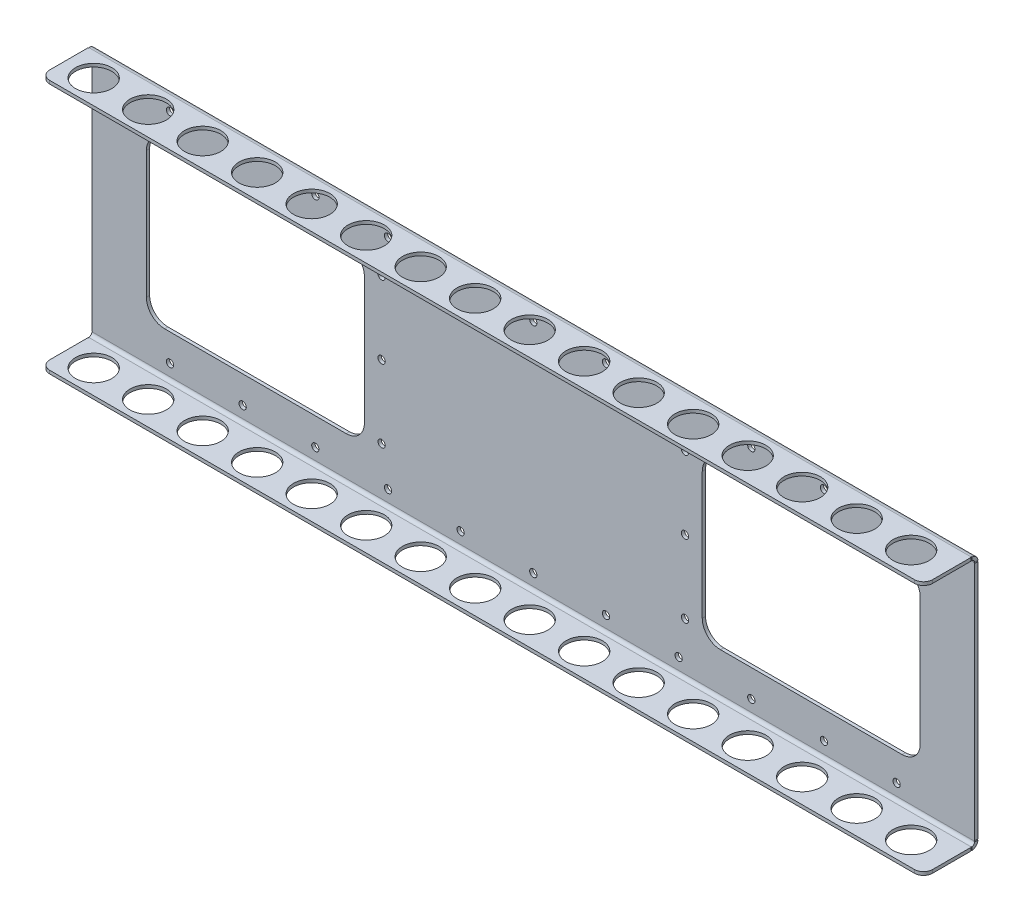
ISO-10303-21;
HEADER;
FILE_DESCRIPTION(('STEP AP214'),'2;1');
FILE_NAME('part.step','',(''),(''),'','','');
FILE_SCHEMA(('AUTOMOTIVE_DESIGN { 1 0 10303 214 1 1 1 1 }'));
ENDSEC;
DATA;
#1=APPLICATION_CONTEXT('core data for automotive mechanical design processes');
#2=APPLICATION_PROTOCOL_DEFINITION('international standard','automotive_design',2000,#1);
#3=PRODUCT_CONTEXT('',#1,'mechanical');
#4=PRODUCT('Part','Part','',(#3));
#5=PRODUCT_RELATED_PRODUCT_CATEGORY('part','',(#4));
#6=PRODUCT_DEFINITION_FORMATION('','',#4);
#7=PRODUCT_DEFINITION_CONTEXT('part definition',#1,'design');
#8=PRODUCT_DEFINITION('design','',#6,#7);
#9=PRODUCT_DEFINITION_SHAPE('','',#8);
#10=(LENGTH_UNIT() NAMED_UNIT(*) SI_UNIT(.MILLI.,.METRE.));
#11=(NAMED_UNIT(*) PLANE_ANGLE_UNIT() SI_UNIT($,.RADIAN.));
#12=(NAMED_UNIT(*) SI_UNIT($,.STERADIAN.) SOLID_ANGLE_UNIT());
#13=UNCERTAINTY_MEASURE_WITH_UNIT(LENGTH_MEASURE(1.E-05),#10,'distance_accuracy_value','');
#14=(GEOMETRIC_REPRESENTATION_CONTEXT(3) GLOBAL_UNCERTAINTY_ASSIGNED_CONTEXT((#13)) GLOBAL_UNIT_ASSIGNED_CONTEXT((#10,
#11,#12)) REPRESENTATION_CONTEXT('',''));
#15=CARTESIAN_POINT('',(0.,0.,0.));
#16=DIRECTION('',(0.,0.,1.));
#17=DIRECTION('',(1.,0.,0.));
#18=AXIS2_PLACEMENT_3D('',#15,#16,#17);
#19=CARTESIAN_POINT('',(0.,0.,0.));
#20=DIRECTION('',(0.,0.,-1.));
#21=DIRECTION('',(-1.,0.,0.));
#22=AXIS2_PLACEMENT_3D('',#19,#20,#21);
#23=PLANE('',#22);
#24=CARTESIAN_POINT('',(202.565,139.7,0.));
#25=DIRECTION('',(0.,0.,1.));
#26=DIRECTION('',(1.,0.,0.));
#27=AXIS2_PLACEMENT_3D('',#24,#25,#26);
#28=CIRCLE('',#27,2.54000000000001);
#29=CARTESIAN_POINT('',(205.105,139.7,0.));
#30=VERTEX_POINT('',#29);
#31=EDGE_CURVE('E1299',#30,#30,#28,.T.);
#32=ORIENTED_EDGE('',*,*,#31,.F.);
#33=EDGE_LOOP('',(#32));
#34=FACE_BOUND('',#33,.T.);
#35=CARTESIAN_POINT('',(414.655,139.7,0.));
#36=DIRECTION('',(0.,0.,1.));
#37=DIRECTION('',(1.,0.,0.));
#38=AXIS2_PLACEMENT_3D('',#35,#36,#37);
#39=CIRCLE('',#38,2.53999999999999);
#40=CARTESIAN_POINT('',(417.195,139.7,0.));
#41=VERTEX_POINT('',#40);
#42=EDGE_CURVE('E1306',#41,#41,#39,.T.);
#43=ORIENTED_EDGE('',*,*,#42,.F.);
#44=EDGE_LOOP('',(#43));
#45=FACE_BOUND('',#44,.T.);
#46=CARTESIAN_POINT('',(202.565,38.1,0.));
#47=DIRECTION('',(0.,0.,1.));
#48=DIRECTION('',(1.,0.,0.));
#49=AXIS2_PLACEMENT_3D('',#46,#47,#48);
#50=CIRCLE('',#49,2.54000000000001);
#51=CARTESIAN_POINT('',(205.105,38.1,0.));
#52=VERTEX_POINT('',#51);
#53=EDGE_CURVE('E1312',#52,#52,#50,.T.);
#54=ORIENTED_EDGE('',*,*,#53,.F.);
#55=EDGE_LOOP('',(#54));
#56=FACE_BOUND('',#55,.T.);
#57=CARTESIAN_POINT('',(414.655,38.1,0.));
#58=DIRECTION('',(0.,0.,1.));
#59=DIRECTION('',(1.,0.,0.));
#60=AXIS2_PLACEMENT_3D('',#57,#58,#59);
#61=CIRCLE('',#60,2.53999999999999);
#62=CARTESIAN_POINT('',(417.195,38.1,0.));
#63=VERTEX_POINT('',#62);
#64=EDGE_CURVE('E1318',#63,#63,#61,.T.);
#65=ORIENTED_EDGE('',*,*,#64,.F.);
#66=EDGE_LOOP('',(#65));
#67=FACE_BOUND('',#66,.T.);
#68=DIRECTION('',(0.,1.,0.));
#69=VECTOR('',#68,1.);
#70=CARTESIAN_POINT('',(426.719999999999,0.,0.));
#71=LINE('',#70,#69);
#72=CARTESIAN_POINT('',(426.719999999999,44.45,0.));
#73=VERTEX_POINT('',#72);
#74=CARTESIAN_POINT('',(426.719999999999,133.35,0.));
#75=VERTEX_POINT('',#74);
#76=EDGE_CURVE('E1503',#73,#75,#71,.T.);
#77=ORIENTED_EDGE('',*,*,#76,.T.);
#78=CARTESIAN_POINT('',(439.419999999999,133.35,0.));
#79=DIRECTION('',(0.,0.,-1.));
#80=DIRECTION('',(-1.,0.,0.));
#81=AXIS2_PLACEMENT_3D('',#78,#79,#80);
#82=CIRCLE('',#81,12.7);
#83=CARTESIAN_POINT('',(439.419999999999,146.05,0.));
#84=VERTEX_POINT('',#83);
#85=EDGE_CURVE('E1570',#75,#84,#82,.T.);
#86=ORIENTED_EDGE('',*,*,#85,.T.);
#87=DIRECTION('',(1.,0.,0.));
#88=VECTOR('',#87,1.);
#89=CARTESIAN_POINT('',(0.,146.05,0.));
#90=LINE('',#89,#88);
#91=CARTESIAN_POINT('',(566.419999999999,146.05,0.));
#92=VERTEX_POINT('',#91);
#93=EDGE_CURVE('E1506',#84,#92,#90,.T.);
#94=ORIENTED_EDGE('',*,*,#93,.T.);
#95=CARTESIAN_POINT('',(566.419999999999,133.35,0.));
#96=DIRECTION('',(0.,0.,-1.));
#97=DIRECTION('',(-1.,0.,0.));
#98=AXIS2_PLACEMENT_3D('',#95,#96,#97);
#99=CIRCLE('',#98,12.7);
#100=CARTESIAN_POINT('',(579.119999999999,133.35,0.));
#101=VERTEX_POINT('',#100);
#102=EDGE_CURVE('E1566',#92,#101,#99,.T.);
#103=ORIENTED_EDGE('',*,*,#102,.T.);
#104=DIRECTION('',(0.,-1.,0.));
#105=VECTOR('',#104,1.);
#106=CARTESIAN_POINT('',(579.119999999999,0.,0.));
#107=LINE('',#106,#105);
#108=CARTESIAN_POINT('',(579.119999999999,44.45,0.));
#109=VERTEX_POINT('',#108);
#110=EDGE_CURVE('E1509',#101,#109,#107,.T.);
#111=ORIENTED_EDGE('',*,*,#110,.T.);
#112=CARTESIAN_POINT('',(566.419999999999,44.45,0.));
#113=DIRECTION('',(0.,0.,-1.));
#114=DIRECTION('',(-1.,0.,0.));
#115=AXIS2_PLACEMENT_3D('',#112,#113,#114);
#116=CIRCLE('',#115,12.7);
#117=CARTESIAN_POINT('',(566.419999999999,31.75,0.));
#118=VERTEX_POINT('',#117);
#119=EDGE_CURVE('E1578',#109,#118,#116,.T.);
#120=ORIENTED_EDGE('',*,*,#119,.T.);
#121=DIRECTION('',(-1.,0.,0.));
#122=VECTOR('',#121,1.);
#123=CARTESIAN_POINT('',(0.,31.75,0.));
#124=LINE('',#123,#122);
#125=CARTESIAN_POINT('',(439.419999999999,31.75,0.));
#126=VERTEX_POINT('',#125);
#127=EDGE_CURVE('E1497',#118,#126,#124,.T.);
#128=ORIENTED_EDGE('',*,*,#127,.T.);
#129=CARTESIAN_POINT('',(439.419999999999,44.45,0.));
#130=DIRECTION('',(0.,0.,-1.));
#131=DIRECTION('',(-1.,0.,0.));
#132=AXIS2_PLACEMENT_3D('',#129,#130,#131);
#133=CIRCLE('',#132,12.7);
#134=EDGE_CURVE('E1574',#126,#73,#133,.T.);
#135=ORIENTED_EDGE('',*,*,#134,.T.);
#136=EDGE_LOOP('',(#77,#86,#94,#103,#111,#120,#128,#135));
#137=FACE_BOUND('',#136,.T.);
#138=DIRECTION('',(-1.,0.,0.));
#139=VECTOR('',#138,1.);
#140=CARTESIAN_POINT('',(0.,31.75,0.));
#141=LINE('',#140,#139);
#142=CARTESIAN_POINT('',(177.800000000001,31.75,0.));
#143=VERTEX_POINT('',#142);
#144=CARTESIAN_POINT('',(50.8000000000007,31.75,0.));
#145=VERTEX_POINT('',#144);
#146=EDGE_CURVE('E1515',#143,#145,#141,.T.);
#147=ORIENTED_EDGE('',*,*,#146,.T.);
#148=CARTESIAN_POINT('',(50.8000000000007,44.45,0.));
#149=DIRECTION('',(0.,0.,-1.));
#150=DIRECTION('',(-1.,0.,0.));
#151=AXIS2_PLACEMENT_3D('',#148,#149,#150);
#152=CIRCLE('',#151,12.7);
#153=CARTESIAN_POINT('',(38.1000000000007,44.45,0.));
#154=VERTEX_POINT('',#153);
#155=EDGE_CURVE('E1594',#145,#154,#152,.T.);
#156=ORIENTED_EDGE('',*,*,#155,.T.);
#157=DIRECTION('',(0.,1.,0.));
#158=VECTOR('',#157,1.);
#159=CARTESIAN_POINT('',(38.1000000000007,0.,0.));
#160=LINE('',#159,#158);
#161=CARTESIAN_POINT('',(38.1000000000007,133.35,0.));
#162=VERTEX_POINT('',#161);
#163=EDGE_CURVE('E1518',#154,#162,#160,.T.);
#164=ORIENTED_EDGE('',*,*,#163,.T.);
#165=CARTESIAN_POINT('',(50.8000000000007,133.35,0.));
#166=DIRECTION('',(0.,0.,-1.));
#167=DIRECTION('',(-1.,0.,0.));
#168=AXIS2_PLACEMENT_3D('',#165,#166,#167);
#169=CIRCLE('',#168,12.7);
#170=CARTESIAN_POINT('',(50.8000000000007,146.05,0.));
#171=VERTEX_POINT('',#170);
#172=EDGE_CURVE('E1582',#162,#171,#169,.T.);
#173=ORIENTED_EDGE('',*,*,#172,.T.);
#174=DIRECTION('',(1.,0.,0.));
#175=VECTOR('',#174,1.);
#176=CARTESIAN_POINT('',(0.,146.05,0.));
#177=LINE('',#176,#175);
#178=CARTESIAN_POINT('',(177.800000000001,146.05,0.));
#179=VERTEX_POINT('',#178);
#180=EDGE_CURVE('E1521',#171,#179,#177,.T.);
#181=ORIENTED_EDGE('',*,*,#180,.T.);
#182=CARTESIAN_POINT('',(177.800000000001,133.35,0.));
#183=DIRECTION('',(0.,0.,-1.));
#184=DIRECTION('',(-1.,0.,0.));
#185=AXIS2_PLACEMENT_3D('',#182,#183,#184);
#186=CIRCLE('',#185,12.7);
#187=CARTESIAN_POINT('',(190.500000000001,133.35,0.));
#188=VERTEX_POINT('',#187);
#189=EDGE_CURVE('E1586',#179,#188,#186,.T.);
#190=ORIENTED_EDGE('',*,*,#189,.T.);
#191=DIRECTION('',(0.,-1.,0.));
#192=VECTOR('',#191,1.);
#193=CARTESIAN_POINT('',(190.500000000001,0.,0.));
#194=LINE('',#193,#192);
#195=CARTESIAN_POINT('',(190.500000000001,44.45,0.));
#196=VERTEX_POINT('',#195);
#197=EDGE_CURVE('E1512',#188,#196,#194,.T.);
#198=ORIENTED_EDGE('',*,*,#197,.T.);
#199=CARTESIAN_POINT('',(177.800000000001,44.45,0.));
#200=DIRECTION('',(0.,0.,-1.));
#201=DIRECTION('',(-1.,0.,0.));
#202=AXIS2_PLACEMENT_3D('',#199,#200,#201);
#203=CIRCLE('',#202,12.7);
#204=EDGE_CURVE('E1590',#196,#143,#203,.T.);
#205=ORIENTED_EDGE('',*,*,#204,.T.);
#206=EDGE_LOOP('',(#147,#156,#164,#173,#181,#190,#198,#205));
#207=FACE_BOUND('',#206,.T.);
#208=CARTESIAN_POINT('',(308.61,12.6999999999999,0.));
#209=DIRECTION('',(0.,0.,-1.));
#210=DIRECTION('',(-1.,0.,0.));
#211=AXIS2_PLACEMENT_3D('',#208,#209,#210);
#212=CIRCLE('',#211,2.53999999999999);
#213=CARTESIAN_POINT('',(306.07,12.6999999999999,0.));
#214=VERTEX_POINT('',#213);
#215=EDGE_CURVE('E1463',#214,#214,#212,.T.);
#216=ORIENTED_EDGE('',*,*,#215,.T.);
#217=EDGE_LOOP('',(#216));
#218=FACE_BOUND('',#217,.T.);
#219=CARTESIAN_POINT('',(308.61,165.1,0.));
#220=DIRECTION('',(0.,0.,-1.));
#221=DIRECTION('',(-1.,0.,0.));
#222=AXIS2_PLACEMENT_3D('',#219,#220,#221);
#223=CIRCLE('',#222,2.53999999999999);
#224=CARTESIAN_POINT('',(306.07,165.1,0.));
#225=VERTEX_POINT('',#224);
#226=EDGE_CURVE('E1457',#225,#225,#223,.T.);
#227=ORIENTED_EDGE('',*,*,#226,.T.);
#228=EDGE_LOOP('',(#227));
#229=FACE_BOUND('',#228,.T.);
#230=CARTESIAN_POINT('',(257.81,12.6999999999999,0.));
#231=DIRECTION('',(0.,0.,-1.));
#232=DIRECTION('',(-1.,0.,0.));
#233=AXIS2_PLACEMENT_3D('',#230,#231,#232);
#234=CIRCLE('',#233,2.53999999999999);
#235=CARTESIAN_POINT('',(255.27,12.6999999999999,0.));
#236=VERTEX_POINT('',#235);
#237=EDGE_CURVE('E1451',#236,#236,#234,.T.);
#238=ORIENTED_EDGE('',*,*,#237,.T.);
#239=EDGE_LOOP('',(#238));
#240=FACE_BOUND('',#239,.T.);
#241=CARTESIAN_POINT('',(257.81,165.1,0.));
#242=DIRECTION('',(0.,0.,-1.));
#243=DIRECTION('',(-1.,0.,0.));
#244=AXIS2_PLACEMENT_3D('',#241,#242,#243);
#245=CIRCLE('',#244,2.53999999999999);
#246=CARTESIAN_POINT('',(255.27,165.1,0.));
#247=VERTEX_POINT('',#246);
#248=EDGE_CURVE('E1445',#247,#247,#245,.T.);
#249=ORIENTED_EDGE('',*,*,#248,.T.);
#250=EDGE_LOOP('',(#249));
#251=FACE_BOUND('',#250,.T.);
#252=CARTESIAN_POINT('',(207.01,12.6999999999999,0.));
#253=DIRECTION('',(0.,0.,-1.));
#254=DIRECTION('',(-1.,0.,0.));
#255=AXIS2_PLACEMENT_3D('',#252,#253,#254);
#256=CIRCLE('',#255,2.54000000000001);
#257=CARTESIAN_POINT('',(204.47,12.6999999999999,0.));
#258=VERTEX_POINT('',#257);
#259=EDGE_CURVE('E1439',#258,#258,#256,.T.);
#260=ORIENTED_EDGE('',*,*,#259,.T.);
#261=EDGE_LOOP('',(#260));
#262=FACE_BOUND('',#261,.T.);
#263=CARTESIAN_POINT('',(207.01,165.1,0.));
#264=DIRECTION('',(0.,0.,-1.));
#265=DIRECTION('',(-1.,0.,0.));
#266=AXIS2_PLACEMENT_3D('',#263,#264,#265);
#267=CIRCLE('',#266,2.54000000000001);
#268=CARTESIAN_POINT('',(204.47,165.1,0.));
#269=VERTEX_POINT('',#268);
#270=EDGE_CURVE('E1433',#269,#269,#267,.T.);
#271=ORIENTED_EDGE('',*,*,#270,.T.);
#272=EDGE_LOOP('',(#271));
#273=FACE_BOUND('',#272,.T.);
#274=CARTESIAN_POINT('',(156.21,12.6999999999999,0.));
#275=DIRECTION('',(0.,0.,-1.));
#276=DIRECTION('',(-1.,0.,0.));
#277=AXIS2_PLACEMENT_3D('',#274,#275,#276);
#278=CIRCLE('',#277,2.54000000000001);
#279=CARTESIAN_POINT('',(153.67,12.6999999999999,0.));
#280=VERTEX_POINT('',#279);
#281=EDGE_CURVE('E1427',#280,#280,#278,.T.);
#282=ORIENTED_EDGE('',*,*,#281,.T.);
#283=EDGE_LOOP('',(#282));
#284=FACE_BOUND('',#283,.T.);
#285=CARTESIAN_POINT('',(156.21,165.1,0.));
#286=DIRECTION('',(0.,0.,-1.));
#287=DIRECTION('',(-1.,0.,0.));
#288=AXIS2_PLACEMENT_3D('',#285,#286,#287);
#289=CIRCLE('',#288,2.54000000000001);
#290=CARTESIAN_POINT('',(153.67,165.1,0.));
#291=VERTEX_POINT('',#290);
#292=EDGE_CURVE('E1421',#291,#291,#289,.T.);
#293=ORIENTED_EDGE('',*,*,#292,.T.);
#294=EDGE_LOOP('',(#293));
#295=FACE_BOUND('',#294,.T.);
#296=CARTESIAN_POINT('',(105.41,12.6999999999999,0.));
#297=DIRECTION('',(0.,0.,-1.));
#298=DIRECTION('',(-1.,0.,0.));
#299=AXIS2_PLACEMENT_3D('',#296,#297,#298);
#300=CIRCLE('',#299,2.54000000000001);
#301=CARTESIAN_POINT('',(102.87,12.6999999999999,0.));
#302=VERTEX_POINT('',#301);
#303=EDGE_CURVE('E1415',#302,#302,#300,.T.);
#304=ORIENTED_EDGE('',*,*,#303,.T.);
#305=EDGE_LOOP('',(#304));
#306=FACE_BOUND('',#305,.T.);
#307=CARTESIAN_POINT('',(105.41,165.1,0.));
#308=DIRECTION('',(0.,0.,-1.));
#309=DIRECTION('',(-1.,0.,0.));
#310=AXIS2_PLACEMENT_3D('',#307,#308,#309);
#311=CIRCLE('',#310,2.54000000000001);
#312=CARTESIAN_POINT('',(102.87,165.1,0.));
#313=VERTEX_POINT('',#312);
#314=EDGE_CURVE('E1409',#313,#313,#311,.T.);
#315=ORIENTED_EDGE('',*,*,#314,.T.);
#316=EDGE_LOOP('',(#315));
#317=FACE_BOUND('',#316,.T.);
#318=CARTESIAN_POINT('',(54.61,12.6999999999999,0.));
#319=DIRECTION('',(0.,0.,-1.));
#320=DIRECTION('',(-1.,0.,0.));
#321=AXIS2_PLACEMENT_3D('',#318,#319,#320);
#322=CIRCLE('',#321,2.54000000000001);
#323=CARTESIAN_POINT('',(52.07,12.6999999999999,0.));
#324=VERTEX_POINT('',#323);
#325=EDGE_CURVE('E1403',#324,#324,#322,.T.);
#326=ORIENTED_EDGE('',*,*,#325,.T.);
#327=EDGE_LOOP('',(#326));
#328=FACE_BOUND('',#327,.T.);
#329=CARTESIAN_POINT('',(54.61,165.1,0.));
#330=DIRECTION('',(0.,0.,-1.));
#331=DIRECTION('',(-1.,0.,0.));
#332=AXIS2_PLACEMENT_3D('',#329,#330,#331);
#333=CIRCLE('',#332,2.54000000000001);
#334=CARTESIAN_POINT('',(52.07,165.1,0.));
#335=VERTEX_POINT('',#334);
#336=EDGE_CURVE('E1397',#335,#335,#333,.T.);
#337=ORIENTED_EDGE('',*,*,#336,.T.);
#338=EDGE_LOOP('',(#337));
#339=FACE_BOUND('',#338,.T.);
#340=CARTESIAN_POINT('',(359.41,12.6999999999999,0.));
#341=DIRECTION('',(0.,0.,-1.));
#342=DIRECTION('',(-1.,0.,0.));
#343=AXIS2_PLACEMENT_3D('',#340,#341,#342);
#344=CIRCLE('',#343,2.53999999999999);
#345=CARTESIAN_POINT('',(356.87,12.6999999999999,0.));
#346=VERTEX_POINT('',#345);
#347=EDGE_CURVE('E1393',#346,#346,#344,.T.);
#348=ORIENTED_EDGE('',*,*,#347,.T.);
#349=EDGE_LOOP('',(#348));
#350=FACE_BOUND('',#349,.T.);
#351=CARTESIAN_POINT('',(359.41,165.1,0.));
#352=DIRECTION('',(0.,0.,-1.));
#353=DIRECTION('',(-1.,0.,0.));
#354=AXIS2_PLACEMENT_3D('',#351,#352,#353);
#355=CIRCLE('',#354,2.53999999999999);
#356=CARTESIAN_POINT('',(356.87,165.1,0.));
#357=VERTEX_POINT('',#356);
#358=EDGE_CURVE('E1387',#357,#357,#355,.T.);
#359=ORIENTED_EDGE('',*,*,#358,.T.);
#360=EDGE_LOOP('',(#359));
#361=FACE_BOUND('',#360,.T.);
#362=CARTESIAN_POINT('',(410.21,12.6999999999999,0.));
#363=DIRECTION('',(0.,0.,-1.));
#364=DIRECTION('',(-1.,0.,0.));
#365=AXIS2_PLACEMENT_3D('',#362,#363,#364);
#366=CIRCLE('',#365,2.53999999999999);
#367=CARTESIAN_POINT('',(407.67,12.6999999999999,0.));
#368=VERTEX_POINT('',#367);
#369=EDGE_CURVE('E1381',#368,#368,#366,.T.);
#370=ORIENTED_EDGE('',*,*,#369,.T.);
#371=EDGE_LOOP('',(#370));
#372=FACE_BOUND('',#371,.T.);
#373=CARTESIAN_POINT('',(410.21,165.1,0.));
#374=DIRECTION('',(0.,0.,-1.));
#375=DIRECTION('',(-1.,0.,0.));
#376=AXIS2_PLACEMENT_3D('',#373,#374,#375);
#377=CIRCLE('',#376,2.53999999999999);
#378=CARTESIAN_POINT('',(407.67,165.1,0.));
#379=VERTEX_POINT('',#378);
#380=EDGE_CURVE('E1375',#379,#379,#377,.T.);
#381=ORIENTED_EDGE('',*,*,#380,.T.);
#382=EDGE_LOOP('',(#381));
#383=FACE_BOUND('',#382,.T.);
#384=CARTESIAN_POINT('',(461.01,12.6999999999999,0.));
#385=DIRECTION('',(0.,0.,-1.));
#386=DIRECTION('',(-1.,0.,0.));
#387=AXIS2_PLACEMENT_3D('',#384,#385,#386);
#388=CIRCLE('',#387,2.53999999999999);
#389=CARTESIAN_POINT('',(458.47,12.6999999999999,0.));
#390=VERTEX_POINT('',#389);
#391=EDGE_CURVE('E1369',#390,#390,#388,.T.);
#392=ORIENTED_EDGE('',*,*,#391,.T.);
#393=EDGE_LOOP('',(#392));
#394=FACE_BOUND('',#393,.T.);
#395=CARTESIAN_POINT('',(461.01,165.1,0.));
#396=DIRECTION('',(0.,0.,-1.));
#397=DIRECTION('',(-1.,0.,0.));
#398=AXIS2_PLACEMENT_3D('',#395,#396,#397);
#399=CIRCLE('',#398,2.53999999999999);
#400=CARTESIAN_POINT('',(458.47,165.1,0.));
#401=VERTEX_POINT('',#400);
#402=EDGE_CURVE('E1363',#401,#401,#399,.T.);
#403=ORIENTED_EDGE('',*,*,#402,.T.);
#404=EDGE_LOOP('',(#403));
#405=FACE_BOUND('',#404,.T.);
#406=CARTESIAN_POINT('',(511.81,12.6999999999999,0.));
#407=DIRECTION('',(0.,0.,-1.));
#408=DIRECTION('',(-1.,0.,0.));
#409=AXIS2_PLACEMENT_3D('',#406,#407,#408);
#410=CIRCLE('',#409,2.53999999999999);
#411=CARTESIAN_POINT('',(509.27,12.6999999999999,0.));
#412=VERTEX_POINT('',#411);
#413=EDGE_CURVE('E1357',#412,#412,#410,.T.);
#414=ORIENTED_EDGE('',*,*,#413,.T.);
#415=EDGE_LOOP('',(#414));
#416=FACE_BOUND('',#415,.T.);
#417=CARTESIAN_POINT('',(511.81,165.1,0.));
#418=DIRECTION('',(0.,0.,-1.));
#419=DIRECTION('',(-1.,0.,0.));
#420=AXIS2_PLACEMENT_3D('',#417,#418,#419);
#421=CIRCLE('',#420,2.53999999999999);
#422=CARTESIAN_POINT('',(509.27,165.1,0.));
#423=VERTEX_POINT('',#422);
#424=EDGE_CURVE('E1351',#423,#423,#421,.T.);
#425=ORIENTED_EDGE('',*,*,#424,.T.);
#426=EDGE_LOOP('',(#425));
#427=FACE_BOUND('',#426,.T.);
#428=CARTESIAN_POINT('',(562.61,12.6999999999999,0.));
#429=DIRECTION('',(0.,0.,-1.));
#430=DIRECTION('',(-1.,0.,0.));
#431=AXIS2_PLACEMENT_3D('',#428,#429,#430);
#432=CIRCLE('',#431,2.53999999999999);
#433=CARTESIAN_POINT('',(560.07,12.6999999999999,0.));
#434=VERTEX_POINT('',#433);
#435=EDGE_CURVE('E1345',#434,#434,#432,.T.);
#436=ORIENTED_EDGE('',*,*,#435,.T.);
#437=EDGE_LOOP('',(#436));
#438=FACE_BOUND('',#437,.T.);
#439=CARTESIAN_POINT('',(562.61,165.1,0.));
#440=DIRECTION('',(0.,0.,-1.));
#441=DIRECTION('',(-1.,0.,0.));
#442=AXIS2_PLACEMENT_3D('',#439,#440,#441);
#443=CIRCLE('',#442,2.53999999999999);
#444=CARTESIAN_POINT('',(560.07,165.1,0.));
#445=VERTEX_POINT('',#444);
#446=EDGE_CURVE('E1339',#445,#445,#443,.T.);
#447=ORIENTED_EDGE('',*,*,#446,.T.);
#448=EDGE_LOOP('',(#447));
#449=FACE_BOUND('',#448,.T.);
#450=CARTESIAN_POINT('',(414.655,88.9,0.));
#451=DIRECTION('',(0.,0.,1.));
#452=DIRECTION('',(1.,0.,0.));
#453=AXIS2_PLACEMENT_3D('',#450,#451,#452);
#454=CIRCLE('',#453,2.53999999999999);
#455=CARTESIAN_POINT('',(417.195,88.9,0.));
#456=VERTEX_POINT('',#455);
#457=EDGE_CURVE('E1330',#456,#456,#454,.T.);
#458=ORIENTED_EDGE('',*,*,#457,.F.);
#459=EDGE_LOOP('',(#458));
#460=FACE_BOUND('',#459,.T.);
#461=CARTESIAN_POINT('',(202.565,88.9,0.));
#462=DIRECTION('',(0.,0.,1.));
#463=DIRECTION('',(1.,0.,0.));
#464=AXIS2_PLACEMENT_3D('',#461,#462,#463);
#465=CIRCLE('',#464,2.54000000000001);
#466=CARTESIAN_POINT('',(205.105,88.9,0.));
#467=VERTEX_POINT('',#466);
#468=EDGE_CURVE('E1324',#467,#467,#465,.T.);
#469=ORIENTED_EDGE('',*,*,#468,.F.);
#470=EDGE_LOOP('',(#469));
#471=FACE_BOUND('',#470,.T.);
#472=DIRECTION('',(-1.,0.,0.));
#473=VECTOR('',#472,1.);
#474=CARTESIAN_POINT('',(617.22,4.57199999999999,0.));
#475=LINE('',#474,#473);
#476=CARTESIAN_POINT('',(616.839,4.57199999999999,0.));
#477=VERTEX_POINT('',#476);
#478=CARTESIAN_POINT('',(0.381000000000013,4.57199999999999,0.));
#479=VERTEX_POINT('',#478);
#480=EDGE_CURVE('E1616',#477,#479,#475,.T.);
#481=ORIENTED_EDGE('',*,*,#480,.F.);
#482=CARTESIAN_POINT('',(617.22,4.57199999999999,0.));
#483=DIRECTION('',(0.,0.,1.));
#484=DIRECTION('',(1.,0.,0.));
#485=AXIS2_PLACEMENT_3D('',#482,#483,#484);
#486=CIRCLE('',#485,0.380999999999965);
#487=CARTESIAN_POINT('',(617.22,4.95299999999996,0.));
#488=VERTEX_POINT('',#487);
#489=EDGE_CURVE('E2980',#488,#477,#486,.T.);
#490=ORIENTED_EDGE('',*,*,#489,.F.);
#491=DIRECTION('',(0.,1.,0.));
#492=VECTOR('',#491,1.);
#493=CARTESIAN_POINT('',(617.22,0.,0.));
#494=LINE('',#493,#492);
#495=CARTESIAN_POINT('',(617.22,172.847,0.));
#496=VERTEX_POINT('',#495);
#497=EDGE_CURVE('E1495',#488,#496,#494,.T.);
#498=ORIENTED_EDGE('',*,*,#497,.T.);
#499=CARTESIAN_POINT('',(617.22,173.228,0.));
#500=DIRECTION('',(0.,0.,1.));
#501=DIRECTION('',(1.,0.,0.));
#502=AXIS2_PLACEMENT_3D('',#499,#500,#501);
#503=CIRCLE('',#502,0.380999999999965);
#504=CARTESIAN_POINT('',(616.839,173.228,0.));
#505=VERTEX_POINT('',#504);
#506=EDGE_CURVE('E147',#505,#496,#503,.T.);
#507=ORIENTED_EDGE('',*,*,#506,.F.);
#508=DIRECTION('',(1.,0.,0.));
#509=VECTOR('',#508,1.);
#510=CARTESIAN_POINT('',(0.,173.228,0.));
#511=LINE('',#510,#509);
#512=CARTESIAN_POINT('',(0.381000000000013,173.228,0.));
#513=VERTEX_POINT('',#512);
#514=EDGE_CURVE('E140',#513,#505,#511,.T.);
#515=ORIENTED_EDGE('',*,*,#514,.F.);
#516=CARTESIAN_POINT('',(0.,173.228,0.));
#517=DIRECTION('',(0.,0.,1.));
#518=DIRECTION('',(1.,0.,0.));
#519=AXIS2_PLACEMENT_3D('',#516,#517,#518);
#520=CIRCLE('',#519,0.381000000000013);
#521=CARTESIAN_POINT('',(0.,172.847,0.));
#522=VERTEX_POINT('',#521);
#523=EDGE_CURVE('E155',#522,#513,#520,.T.);
#524=ORIENTED_EDGE('',*,*,#523,.F.);
#525=DIRECTION('',(0.,-1.,0.));
#526=VECTOR('',#525,1.);
#527=CARTESIAN_POINT('',(0.,0.,0.));
#528=LINE('',#527,#526);
#529=CARTESIAN_POINT('',(0.,4.953,0.));
#530=VERTEX_POINT('',#529);
#531=EDGE_CURVE('E1490',#522,#530,#528,.T.);
#532=ORIENTED_EDGE('',*,*,#531,.T.);
#533=CARTESIAN_POINT('',(0.,4.57199999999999,0.));
#534=DIRECTION('',(0.,0.,1.));
#535=DIRECTION('',(1.,0.,0.));
#536=AXIS2_PLACEMENT_3D('',#533,#534,#535);
#537=CIRCLE('',#536,0.381000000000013);
#538=EDGE_CURVE('E1288',#479,#530,#537,.T.);
#539=ORIENTED_EDGE('',*,*,#538,.F.);
#540=EDGE_LOOP('',(#481,#490,#498,#507,#515,#524,#532,#539));
#541=FACE_BOUND('',#540,.T.);
#542=ADVANCED_FACE('F128',(#34,#45,#56,#67,#137,#207,#218,#229,#240,#251,#262,#273,#284,#295,
#306,#317,#328,#339,#350,#361,#372,#383,#394,#405,#416,#427,#438,#449,#460,#471,#541),#23,.F.);
#543=CARTESIAN_POINT('',(0.,0.,-2.286));
#544=DIRECTION('',(0.,0.,-1.));
#545=DIRECTION('',(-1.,0.,0.));
#546=AXIS2_PLACEMENT_3D('',#543,#544,#545);
#547=PLANE('',#546);
#548=CARTESIAN_POINT('',(617.22,4.57199999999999,-2.28600000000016));
#549=DIRECTION('',(0.,0.,1.));
#550=DIRECTION('',(1.,0.,0.));
#551=AXIS2_PLACEMENT_3D('',#548,#549,#550);
#552=CIRCLE('',#551,0.380999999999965);
#553=CARTESIAN_POINT('',(617.22,4.95299999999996,-2.28600000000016));
#554=VERTEX_POINT('',#553);
#555=CARTESIAN_POINT('',(616.839,4.57199999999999,-2.28600000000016));
#556=VERTEX_POINT('',#555);
#557=EDGE_CURVE('E1289',#554,#556,#552,.T.);
#558=ORIENTED_EDGE('',*,*,#557,.T.);
#559=DIRECTION('',(-1.,0.,0.));
#560=VECTOR('',#559,1.);
#561=CARTESIAN_POINT('',(617.22,4.57199999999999,-2.286));
#562=LINE('',#561,#560);
#563=CARTESIAN_POINT('',(0.380999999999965,4.57199999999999,-2.286));
#564=VERTEX_POINT('',#563);
#565=EDGE_CURVE('E1596',#556,#564,#562,.T.);
#566=ORIENTED_EDGE('',*,*,#565,.T.);
#567=CARTESIAN_POINT('',(0.,4.57199999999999,-2.28600000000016));
#568=DIRECTION('',(0.,0.,1.));
#569=DIRECTION('',(1.,0.,0.));
#570=AXIS2_PLACEMENT_3D('',#567,#568,#569);
#571=CIRCLE('',#570,0.381000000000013);
#572=CARTESIAN_POINT('',(0.,4.953,-2.28600000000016));
#573=VERTEX_POINT('',#572);
#574=EDGE_CURVE('E1292',#564,#573,#571,.T.);
#575=ORIENTED_EDGE('',*,*,#574,.T.);
#576=DIRECTION('',(0.,-1.,0.));
#577=VECTOR('',#576,1.);
#578=CARTESIAN_POINT('',(0.,0.,-2.286));
#579=LINE('',#578,#577);
#580=CARTESIAN_POINT('',(0.,172.847,-2.28600000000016));
#581=VERTEX_POINT('',#580);
#582=EDGE_CURVE('E1491',#581,#573,#579,.T.);
#583=ORIENTED_EDGE('',*,*,#582,.F.);
#584=CARTESIAN_POINT('',(0.,173.228,-2.28600000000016));
#585=DIRECTION('',(0.,0.,1.));
#586=DIRECTION('',(1.,0.,0.));
#587=AXIS2_PLACEMENT_3D('',#584,#585,#586);
#588=CIRCLE('',#587,0.381000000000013);
#589=CARTESIAN_POINT('',(0.381000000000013,173.228,-2.28600000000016));
#590=VERTEX_POINT('',#589);
#591=EDGE_CURVE('E1295',#581,#590,#588,.T.);
#592=ORIENTED_EDGE('',*,*,#591,.T.);
#593=DIRECTION('',(1.,0.,0.));
#594=VECTOR('',#593,1.);
#595=CARTESIAN_POINT('',(0.,173.228,-2.28600000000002));
#596=LINE('',#595,#594);
#597=CARTESIAN_POINT('',(616.838999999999,173.228,-2.28600000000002));
#598=VERTEX_POINT('',#597);
#599=EDGE_CURVE('E2914',#590,#598,#596,.T.);
#600=ORIENTED_EDGE('',*,*,#599,.T.);
#601=CARTESIAN_POINT('',(617.22,173.228,-2.28600000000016));
#602=DIRECTION('',(0.,0.,1.));
#603=DIRECTION('',(1.,0.,0.));
#604=AXIS2_PLACEMENT_3D('',#601,#602,#603);
#605=CIRCLE('',#604,0.380999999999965);
#606=CARTESIAN_POINT('',(617.22,172.847,-2.28600000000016));
#607=VERTEX_POINT('',#606);
#608=EDGE_CURVE('E1300',#598,#607,#605,.T.);
#609=ORIENTED_EDGE('',*,*,#608,.T.);
#610=DIRECTION('',(0.,1.,0.));
#611=VECTOR('',#610,1.);
#612=CARTESIAN_POINT('',(617.22,0.,-2.286));
#613=LINE('',#612,#611);
#614=EDGE_CURVE('E1494',#554,#607,#613,.T.);
#615=ORIENTED_EDGE('',*,*,#614,.F.);
#616=EDGE_LOOP('',(#558,#566,#575,#583,#592,#600,#609,#615));
#617=FACE_BOUND('',#616,.T.);
#618=CARTESIAN_POINT('',(202.565,139.7,-2.286));
#619=DIRECTION('',(0.,0.,-1.));
#620=DIRECTION('',(-1.,0.,0.));
#621=AXIS2_PLACEMENT_3D('',#618,#619,#620);
#622=CIRCLE('',#621,2.54000000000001);
#623=CARTESIAN_POINT('',(200.025,139.7,-2.286));
#624=VERTEX_POINT('',#623);
#625=EDGE_CURVE('E1303',#624,#624,#622,.T.);
#626=ORIENTED_EDGE('',*,*,#625,.F.);
#627=EDGE_LOOP('',(#626));
#628=FACE_BOUND('',#627,.T.);
#629=CARTESIAN_POINT('',(414.655,139.7,-2.286));
#630=DIRECTION('',(0.,0.,-1.));
#631=DIRECTION('',(-1.,0.,0.));
#632=AXIS2_PLACEMENT_3D('',#629,#630,#631);
#633=CIRCLE('',#632,2.53999999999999);
#634=CARTESIAN_POINT('',(412.115,139.7,-2.286));
#635=VERTEX_POINT('',#634);
#636=EDGE_CURVE('E1309',#635,#635,#633,.T.);
#637=ORIENTED_EDGE('',*,*,#636,.F.);
#638=EDGE_LOOP('',(#637));
#639=FACE_BOUND('',#638,.T.);
#640=CARTESIAN_POINT('',(202.565,38.1,-2.286));
#641=DIRECTION('',(0.,0.,-1.));
#642=DIRECTION('',(-1.,0.,0.));
#643=AXIS2_PLACEMENT_3D('',#640,#641,#642);
#644=CIRCLE('',#643,2.54000000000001);
#645=CARTESIAN_POINT('',(200.025,38.1,-2.286));
#646=VERTEX_POINT('',#645);
#647=EDGE_CURVE('E1315',#646,#646,#644,.T.);
#648=ORIENTED_EDGE('',*,*,#647,.F.);
#649=EDGE_LOOP('',(#648));
#650=FACE_BOUND('',#649,.T.);
#651=CARTESIAN_POINT('',(414.655,38.1,-2.286));
#652=DIRECTION('',(0.,0.,-1.));
#653=DIRECTION('',(-1.,0.,0.));
#654=AXIS2_PLACEMENT_3D('',#651,#652,#653);
#655=CIRCLE('',#654,2.53999999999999);
#656=CARTESIAN_POINT('',(412.115,38.1,-2.286));
#657=VERTEX_POINT('',#656);
#658=EDGE_CURVE('E1321',#657,#657,#655,.T.);
#659=ORIENTED_EDGE('',*,*,#658,.F.);
#660=EDGE_LOOP('',(#659));
#661=FACE_BOUND('',#660,.T.);
#662=CARTESIAN_POINT('',(202.565,88.9,-2.286));
#663=DIRECTION('',(0.,0.,-1.));
#664=DIRECTION('',(-1.,0.,0.));
#665=AXIS2_PLACEMENT_3D('',#662,#663,#664);
#666=CIRCLE('',#665,2.54000000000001);
#667=CARTESIAN_POINT('',(200.025,88.9,-2.286));
#668=VERTEX_POINT('',#667);
#669=EDGE_CURVE('E1327',#668,#668,#666,.T.);
#670=ORIENTED_EDGE('',*,*,#669,.F.);
#671=EDGE_LOOP('',(#670));
#672=FACE_BOUND('',#671,.T.);
#673=CARTESIAN_POINT('',(414.655,88.9,-2.286));
#674=DIRECTION('',(0.,0.,-1.));
#675=DIRECTION('',(-1.,0.,0.));
#676=AXIS2_PLACEMENT_3D('',#673,#674,#675);
#677=CIRCLE('',#676,2.53999999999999);
#678=CARTESIAN_POINT('',(412.115,88.9,-2.286));
#679=VERTEX_POINT('',#678);
#680=EDGE_CURVE('E1333',#679,#679,#677,.T.);
#681=ORIENTED_EDGE('',*,*,#680,.F.);
#682=EDGE_LOOP('',(#681));
#683=FACE_BOUND('',#682,.T.);
#684=CARTESIAN_POINT('',(562.61,165.1,-2.28599999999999));
#685=DIRECTION('',(0.,0.,-1.));
#686=DIRECTION('',(-1.,0.,0.));
#687=AXIS2_PLACEMENT_3D('',#684,#685,#686);
#688=CIRCLE('',#687,2.53999999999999);
#689=CARTESIAN_POINT('',(560.07,165.1,-2.28599999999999));
#690=VERTEX_POINT('',#689);
#691=EDGE_CURVE('E1336',#690,#690,#688,.T.);
#692=ORIENTED_EDGE('',*,*,#691,.F.);
#693=EDGE_LOOP('',(#692));
#694=FACE_BOUND('',#693,.T.);
#695=CARTESIAN_POINT('',(562.61,12.6999999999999,-2.28599999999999));
#696=DIRECTION('',(0.,0.,-1.));
#697=DIRECTION('',(-1.,0.,0.));
#698=AXIS2_PLACEMENT_3D('',#695,#696,#697);
#699=CIRCLE('',#698,2.53999999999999);
#700=CARTESIAN_POINT('',(560.07,12.6999999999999,-2.28599999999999));
#701=VERTEX_POINT('',#700);
#702=EDGE_CURVE('E1342',#701,#701,#699,.T.);
#703=ORIENTED_EDGE('',*,*,#702,.F.);
#704=EDGE_LOOP('',(#703));
#705=FACE_BOUND('',#704,.T.);
#706=CARTESIAN_POINT('',(511.81,165.1,-2.28599999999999));
#707=DIRECTION('',(0.,0.,-1.));
#708=DIRECTION('',(-1.,0.,0.));
#709=AXIS2_PLACEMENT_3D('',#706,#707,#708);
#710=CIRCLE('',#709,2.53999999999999);
#711=CARTESIAN_POINT('',(509.27,165.1,-2.28599999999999));
#712=VERTEX_POINT('',#711);
#713=EDGE_CURVE('E1348',#712,#712,#710,.T.);
#714=ORIENTED_EDGE('',*,*,#713,.F.);
#715=EDGE_LOOP('',(#714));
#716=FACE_BOUND('',#715,.T.);
#717=CARTESIAN_POINT('',(511.81,12.6999999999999,-2.28599999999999));
#718=DIRECTION('',(0.,0.,-1.));
#719=DIRECTION('',(-1.,0.,0.));
#720=AXIS2_PLACEMENT_3D('',#717,#718,#719);
#721=CIRCLE('',#720,2.53999999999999);
#722=CARTESIAN_POINT('',(509.27,12.6999999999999,-2.28599999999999));
#723=VERTEX_POINT('',#722);
#724=EDGE_CURVE('E1354',#723,#723,#721,.T.);
#725=ORIENTED_EDGE('',*,*,#724,.F.);
#726=EDGE_LOOP('',(#725));
#727=FACE_BOUND('',#726,.T.);
#728=CARTESIAN_POINT('',(461.01,165.1,-2.286));
#729=DIRECTION('',(0.,0.,-1.));
#730=DIRECTION('',(-1.,0.,0.));
#731=AXIS2_PLACEMENT_3D('',#728,#729,#730);
#732=CIRCLE('',#731,2.53999999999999);
#733=CARTESIAN_POINT('',(458.47,165.1,-2.286));
#734=VERTEX_POINT('',#733);
#735=EDGE_CURVE('E1360',#734,#734,#732,.T.);
#736=ORIENTED_EDGE('',*,*,#735,.F.);
#737=EDGE_LOOP('',(#736));
#738=FACE_BOUND('',#737,.T.);
#739=CARTESIAN_POINT('',(461.01,12.6999999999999,-2.286));
#740=DIRECTION('',(0.,0.,-1.));
#741=DIRECTION('',(-1.,0.,0.));
#742=AXIS2_PLACEMENT_3D('',#739,#740,#741);
#743=CIRCLE('',#742,2.53999999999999);
#744=CARTESIAN_POINT('',(458.47,12.6999999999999,-2.286));
#745=VERTEX_POINT('',#744);
#746=EDGE_CURVE('E1366',#745,#745,#743,.T.);
#747=ORIENTED_EDGE('',*,*,#746,.F.);
#748=EDGE_LOOP('',(#747));
#749=FACE_BOUND('',#748,.T.);
#750=CARTESIAN_POINT('',(410.21,165.1,-2.286));
#751=DIRECTION('',(0.,0.,-1.));
#752=DIRECTION('',(-1.,0.,0.));
#753=AXIS2_PLACEMENT_3D('',#750,#751,#752);
#754=CIRCLE('',#753,2.53999999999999);
#755=CARTESIAN_POINT('',(407.67,165.1,-2.286));
#756=VERTEX_POINT('',#755);
#757=EDGE_CURVE('E1372',#756,#756,#754,.T.);
#758=ORIENTED_EDGE('',*,*,#757,.F.);
#759=EDGE_LOOP('',(#758));
#760=FACE_BOUND('',#759,.T.);
#761=CARTESIAN_POINT('',(410.21,12.6999999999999,-2.286));
#762=DIRECTION('',(0.,0.,-1.));
#763=DIRECTION('',(-1.,0.,0.));
#764=AXIS2_PLACEMENT_3D('',#761,#762,#763);
#765=CIRCLE('',#764,2.53999999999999);
#766=CARTESIAN_POINT('',(407.67,12.6999999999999,-2.286));
#767=VERTEX_POINT('',#766);
#768=EDGE_CURVE('E1378',#767,#767,#765,.T.);
#769=ORIENTED_EDGE('',*,*,#768,.F.);
#770=EDGE_LOOP('',(#769));
#771=FACE_BOUND('',#770,.T.);
#772=CARTESIAN_POINT('',(359.41,165.1,-2.286));
#773=DIRECTION('',(0.,0.,-1.));
#774=DIRECTION('',(-1.,0.,0.));
#775=AXIS2_PLACEMENT_3D('',#772,#773,#774);
#776=CIRCLE('',#775,2.53999999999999);
#777=CARTESIAN_POINT('',(356.87,165.1,-2.286));
#778=VERTEX_POINT('',#777);
#779=EDGE_CURVE('E1384',#778,#778,#776,.T.);
#780=ORIENTED_EDGE('',*,*,#779,.F.);
#781=EDGE_LOOP('',(#780));
#782=FACE_BOUND('',#781,.T.);
#783=CARTESIAN_POINT('',(359.41,12.6999999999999,-2.286));
#784=DIRECTION('',(0.,0.,-1.));
#785=DIRECTION('',(-1.,0.,0.));
#786=AXIS2_PLACEMENT_3D('',#783,#784,#785);
#787=CIRCLE('',#786,2.53999999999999);
#788=CARTESIAN_POINT('',(356.87,12.6999999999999,-2.286));
#789=VERTEX_POINT('',#788);
#790=EDGE_CURVE('E1390',#789,#789,#787,.T.);
#791=ORIENTED_EDGE('',*,*,#790,.F.);
#792=EDGE_LOOP('',(#791));
#793=FACE_BOUND('',#792,.T.);
#794=CARTESIAN_POINT('',(54.61,165.1,-2.28600000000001));
#795=DIRECTION('',(0.,0.,-1.));
#796=DIRECTION('',(-1.,0.,0.));
#797=AXIS2_PLACEMENT_3D('',#794,#795,#796);
#798=CIRCLE('',#797,2.54000000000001);
#799=CARTESIAN_POINT('',(52.07,165.1,-2.28600000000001));
#800=VERTEX_POINT('',#799);
#801=EDGE_CURVE('E1394',#800,#800,#798,.T.);
#802=ORIENTED_EDGE('',*,*,#801,.F.);
#803=EDGE_LOOP('',(#802));
#804=FACE_BOUND('',#803,.T.);
#805=CARTESIAN_POINT('',(54.61,12.6999999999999,-2.28600000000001));
#806=DIRECTION('',(0.,0.,-1.));
#807=DIRECTION('',(-1.,0.,0.));
#808=AXIS2_PLACEMENT_3D('',#805,#806,#807);
#809=CIRCLE('',#808,2.54000000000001);
#810=CARTESIAN_POINT('',(52.07,12.6999999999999,-2.28600000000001));
#811=VERTEX_POINT('',#810);
#812=EDGE_CURVE('E1400',#811,#811,#809,.T.);
#813=ORIENTED_EDGE('',*,*,#812,.F.);
#814=EDGE_LOOP('',(#813));
#815=FACE_BOUND('',#814,.T.);
#816=CARTESIAN_POINT('',(105.41,165.1,-2.28600000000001));
#817=DIRECTION('',(0.,0.,-1.));
#818=DIRECTION('',(-1.,0.,0.));
#819=AXIS2_PLACEMENT_3D('',#816,#817,#818);
#820=CIRCLE('',#819,2.54000000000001);
#821=CARTESIAN_POINT('',(102.87,165.1,-2.28600000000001));
#822=VERTEX_POINT('',#821);
#823=EDGE_CURVE('E1406',#822,#822,#820,.T.);
#824=ORIENTED_EDGE('',*,*,#823,.F.);
#825=EDGE_LOOP('',(#824));
#826=FACE_BOUND('',#825,.T.);
#827=CARTESIAN_POINT('',(105.41,12.6999999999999,-2.28600000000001));
#828=DIRECTION('',(0.,0.,-1.));
#829=DIRECTION('',(-1.,0.,0.));
#830=AXIS2_PLACEMENT_3D('',#827,#828,#829);
#831=CIRCLE('',#830,2.54000000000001);
#832=CARTESIAN_POINT('',(102.87,12.6999999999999,-2.28600000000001));
#833=VERTEX_POINT('',#832);
#834=EDGE_CURVE('E1412',#833,#833,#831,.T.);
#835=ORIENTED_EDGE('',*,*,#834,.F.);
#836=EDGE_LOOP('',(#835));
#837=FACE_BOUND('',#836,.T.);
#838=CARTESIAN_POINT('',(156.21,165.1,-2.28600000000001));
#839=DIRECTION('',(0.,0.,-1.));
#840=DIRECTION('',(-1.,0.,0.));
#841=AXIS2_PLACEMENT_3D('',#838,#839,#840);
#842=CIRCLE('',#841,2.54000000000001);
#843=CARTESIAN_POINT('',(153.67,165.1,-2.28600000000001));
#844=VERTEX_POINT('',#843);
#845=EDGE_CURVE('E1418',#844,#844,#842,.T.);
#846=ORIENTED_EDGE('',*,*,#845,.F.);
#847=EDGE_LOOP('',(#846));
#848=FACE_BOUND('',#847,.T.);
#849=CARTESIAN_POINT('',(156.21,12.6999999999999,-2.28600000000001));
#850=DIRECTION('',(0.,0.,-1.));
#851=DIRECTION('',(-1.,0.,0.));
#852=AXIS2_PLACEMENT_3D('',#849,#850,#851);
#853=CIRCLE('',#852,2.54000000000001);
#854=CARTESIAN_POINT('',(153.67,12.6999999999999,-2.28600000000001));
#855=VERTEX_POINT('',#854);
#856=EDGE_CURVE('E1424',#855,#855,#853,.T.);
#857=ORIENTED_EDGE('',*,*,#856,.F.);
#858=EDGE_LOOP('',(#857));
#859=FACE_BOUND('',#858,.T.);
#860=CARTESIAN_POINT('',(207.01,165.1,-2.286));
#861=DIRECTION('',(0.,0.,-1.));
#862=DIRECTION('',(-1.,0.,0.));
#863=AXIS2_PLACEMENT_3D('',#860,#861,#862);
#864=CIRCLE('',#863,2.54000000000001);
#865=CARTESIAN_POINT('',(204.47,165.1,-2.286));
#866=VERTEX_POINT('',#865);
#867=EDGE_CURVE('E1430',#866,#866,#864,.T.);
#868=ORIENTED_EDGE('',*,*,#867,.F.);
#869=EDGE_LOOP('',(#868));
#870=FACE_BOUND('',#869,.T.);
#871=CARTESIAN_POINT('',(207.01,12.6999999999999,-2.286));
#872=DIRECTION('',(0.,0.,-1.));
#873=DIRECTION('',(-1.,0.,0.));
#874=AXIS2_PLACEMENT_3D('',#871,#872,#873);
#875=CIRCLE('',#874,2.54000000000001);
#876=CARTESIAN_POINT('',(204.47,12.6999999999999,-2.286));
#877=VERTEX_POINT('',#876);
#878=EDGE_CURVE('E1436',#877,#877,#875,.T.);
#879=ORIENTED_EDGE('',*,*,#878,.F.);
#880=EDGE_LOOP('',(#879));
#881=FACE_BOUND('',#880,.T.);
#882=CARTESIAN_POINT('',(257.81,165.1,-2.286));
#883=DIRECTION('',(0.,0.,-1.));
#884=DIRECTION('',(-1.,0.,0.));
#885=AXIS2_PLACEMENT_3D('',#882,#883,#884);
#886=CIRCLE('',#885,2.53999999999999);
#887=CARTESIAN_POINT('',(255.27,165.1,-2.286));
#888=VERTEX_POINT('',#887);
#889=EDGE_CURVE('E1442',#888,#888,#886,.T.);
#890=ORIENTED_EDGE('',*,*,#889,.F.);
#891=EDGE_LOOP('',(#890));
#892=FACE_BOUND('',#891,.T.);
#893=CARTESIAN_POINT('',(257.81,12.6999999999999,-2.286));
#894=DIRECTION('',(0.,0.,-1.));
#895=DIRECTION('',(-1.,0.,0.));
#896=AXIS2_PLACEMENT_3D('',#893,#894,#895);
#897=CIRCLE('',#896,2.53999999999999);
#898=CARTESIAN_POINT('',(255.27,12.6999999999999,-2.286));
#899=VERTEX_POINT('',#898);
#900=EDGE_CURVE('E1448',#899,#899,#897,.T.);
#901=ORIENTED_EDGE('',*,*,#900,.F.);
#902=EDGE_LOOP('',(#901));
#903=FACE_BOUND('',#902,.T.);
#904=CARTESIAN_POINT('',(308.61,165.1,-2.286));
#905=DIRECTION('',(0.,0.,-1.));
#906=DIRECTION('',(-1.,0.,0.));
#907=AXIS2_PLACEMENT_3D('',#904,#905,#906);
#908=CIRCLE('',#907,2.53999999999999);
#909=CARTESIAN_POINT('',(306.07,165.1,-2.286));
#910=VERTEX_POINT('',#909);
#911=EDGE_CURVE('E1454',#910,#910,#908,.T.);
#912=ORIENTED_EDGE('',*,*,#911,.F.);
#913=EDGE_LOOP('',(#912));
#914=FACE_BOUND('',#913,.T.);
#915=CARTESIAN_POINT('',(308.61,12.6999999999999,-2.286));
#916=DIRECTION('',(0.,0.,-1.));
#917=DIRECTION('',(-1.,0.,0.));
#918=AXIS2_PLACEMENT_3D('',#915,#916,#917);
#919=CIRCLE('',#918,2.53999999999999);
#920=CARTESIAN_POINT('',(306.07,12.6999999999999,-2.286));
#921=VERTEX_POINT('',#920);
#922=EDGE_CURVE('E1460',#921,#921,#919,.T.);
#923=ORIENTED_EDGE('',*,*,#922,.F.);
#924=EDGE_LOOP('',(#923));
#925=FACE_BOUND('',#924,.T.);
#926=DIRECTION('',(1.,0.,0.));
#927=VECTOR('',#926,1.);
#928=CARTESIAN_POINT('',(38.1000000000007,146.05,-2.286));
#929=LINE('',#928,#927);
#930=CARTESIAN_POINT('',(50.8000000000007,146.05,-2.286));
#931=VERTEX_POINT('',#930);
#932=CARTESIAN_POINT('',(177.800000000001,146.05,-2.286));
#933=VERTEX_POINT('',#932);
#934=EDGE_CURVE('E1466',#931,#933,#929,.T.);
#935=ORIENTED_EDGE('',*,*,#934,.F.);
#936=CARTESIAN_POINT('',(50.8000000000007,133.35,-2.286));
#937=DIRECTION('',(0.,0.,-1.));
#938=DIRECTION('',(-1.,0.,0.));
#939=AXIS2_PLACEMENT_3D('',#936,#937,#938);
#940=CIRCLE('',#939,12.7);
#941=CARTESIAN_POINT('',(38.1000000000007,133.35,-2.286));
#942=VERTEX_POINT('',#941);
#943=EDGE_CURVE('E1580',#931,#942,#940,.F.);
#944=ORIENTED_EDGE('',*,*,#943,.T.);
#945=DIRECTION('',(0.,1.,0.));
#946=VECTOR('',#945,1.);
#947=CARTESIAN_POINT('',(38.1000000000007,146.05,-2.286));
#948=LINE('',#947,#946);
#949=CARTESIAN_POINT('',(38.1000000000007,44.45,-2.286));
#950=VERTEX_POINT('',#949);
#951=EDGE_CURVE('E1475',#950,#942,#948,.T.);
#952=ORIENTED_EDGE('',*,*,#951,.F.);
#953=CARTESIAN_POINT('',(50.8000000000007,44.45,-2.286));
#954=DIRECTION('',(0.,0.,-1.));
#955=DIRECTION('',(-1.,0.,0.));
#956=AXIS2_PLACEMENT_3D('',#953,#954,#955);
#957=CIRCLE('',#956,12.7);
#958=CARTESIAN_POINT('',(50.8000000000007,31.75,-2.286));
#959=VERTEX_POINT('',#958);
#960=EDGE_CURVE('E1592',#950,#959,#957,.F.);
#961=ORIENTED_EDGE('',*,*,#960,.T.);
#962=DIRECTION('',(-1.,0.,0.));
#963=VECTOR('',#962,1.);
#964=CARTESIAN_POINT('',(38.1000000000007,31.75,-2.286));
#965=LINE('',#964,#963);
#966=CARTESIAN_POINT('',(177.800000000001,31.75,-2.286));
#967=VERTEX_POINT('',#966);
#968=EDGE_CURVE('E1472',#967,#959,#965,.T.);
#969=ORIENTED_EDGE('',*,*,#968,.F.);
#970=CARTESIAN_POINT('',(177.800000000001,44.45,-2.286));
#971=DIRECTION('',(0.,0.,-1.));
#972=DIRECTION('',(-1.,0.,0.));
#973=AXIS2_PLACEMENT_3D('',#970,#971,#972);
#974=CIRCLE('',#973,12.7);
#975=CARTESIAN_POINT('',(190.500000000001,44.45,-2.286));
#976=VERTEX_POINT('',#975);
#977=EDGE_CURVE('E1588',#967,#976,#974,.F.);
#978=ORIENTED_EDGE('',*,*,#977,.T.);
#979=DIRECTION('',(0.,-1.,0.));
#980=VECTOR('',#979,1.);
#981=CARTESIAN_POINT('',(190.500000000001,146.05,-2.286));
#982=LINE('',#981,#980);
#983=CARTESIAN_POINT('',(190.500000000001,133.35,-2.286));
#984=VERTEX_POINT('',#983);
#985=EDGE_CURVE('E1469',#984,#976,#982,.T.);
#986=ORIENTED_EDGE('',*,*,#985,.F.);
#987=CARTESIAN_POINT('',(177.800000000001,133.35,-2.286));
#988=DIRECTION('',(0.,0.,-1.));
#989=DIRECTION('',(-1.,0.,0.));
#990=AXIS2_PLACEMENT_3D('',#987,#988,#989);
#991=CIRCLE('',#990,12.7);
#992=EDGE_CURVE('E1584',#984,#933,#991,.F.);
#993=ORIENTED_EDGE('',*,*,#992,.T.);
#994=EDGE_LOOP('',(#935,#944,#952,#961,#969,#978,#986,#993));
#995=FACE_BOUND('',#994,.T.);
#996=DIRECTION('',(0.,-1.,0.));
#997=VECTOR('',#996,1.);
#998=CARTESIAN_POINT('',(579.119999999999,146.05,-2.286));
#999=LINE('',#998,#997);
#1000=CARTESIAN_POINT('',(579.119999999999,133.35,-2.286));
#1001=VERTEX_POINT('',#1000);
#1002=CARTESIAN_POINT('',(579.119999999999,44.45,-2.286));
#1003=VERTEX_POINT('',#1002);
#1004=EDGE_CURVE('E1478',#1001,#1003,#999,.T.);
#1005=ORIENTED_EDGE('',*,*,#1004,.F.);
#1006=CARTESIAN_POINT('',(566.419999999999,133.35,-2.286));
#1007=DIRECTION('',(0.,0.,-1.));
#1008=DIRECTION('',(-1.,0.,0.));
#1009=AXIS2_PLACEMENT_3D('',#1006,#1007,#1008);
#1010=CIRCLE('',#1009,12.7);
#1011=CARTESIAN_POINT('',(566.419999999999,146.05,-2.286));
#1012=VERTEX_POINT('',#1011);
#1013=EDGE_CURVE('E1564',#1001,#1012,#1010,.F.);
#1014=ORIENTED_EDGE('',*,*,#1013,.T.);
#1015=DIRECTION('',(1.,0.,0.));
#1016=VECTOR('',#1015,1.);
#1017=CARTESIAN_POINT('',(579.119999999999,146.05,-2.286));
#1018=LINE('',#1017,#1016);
#1019=CARTESIAN_POINT('',(439.419999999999,146.05,-2.286));
#1020=VERTEX_POINT('',#1019);
#1021=EDGE_CURVE('E1487',#1020,#1012,#1018,.T.);
#1022=ORIENTED_EDGE('',*,*,#1021,.F.);
#1023=CARTESIAN_POINT('',(439.419999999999,133.35,-2.286));
#1024=DIRECTION('',(0.,0.,-1.));
#1025=DIRECTION('',(-1.,0.,0.));
#1026=AXIS2_PLACEMENT_3D('',#1023,#1024,#1025);
#1027=CIRCLE('',#1026,12.7);
#1028=CARTESIAN_POINT('',(426.719999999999,133.35,-2.286));
#1029=VERTEX_POINT('',#1028);
#1030=EDGE_CURVE('E1568',#1020,#1029,#1027,.F.);
#1031=ORIENTED_EDGE('',*,*,#1030,.T.);
#1032=DIRECTION('',(0.,1.,0.));
#1033=VECTOR('',#1032,1.);
#1034=CARTESIAN_POINT('',(426.719999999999,146.05,-2.286));
#1035=LINE('',#1034,#1033);
#1036=CARTESIAN_POINT('',(426.719999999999,44.45,-2.286));
#1037=VERTEX_POINT('',#1036);
#1038=EDGE_CURVE('E1484',#1037,#1029,#1035,.T.);
#1039=ORIENTED_EDGE('',*,*,#1038,.F.);
#1040=CARTESIAN_POINT('',(439.419999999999,44.45,-2.286));
#1041=DIRECTION('',(0.,0.,-1.));
#1042=DIRECTION('',(-1.,0.,0.));
#1043=AXIS2_PLACEMENT_3D('',#1040,#1041,#1042);
#1044=CIRCLE('',#1043,12.7);
#1045=CARTESIAN_POINT('',(439.419999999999,31.75,-2.286));
#1046=VERTEX_POINT('',#1045);
#1047=EDGE_CURVE('E1572',#1037,#1046,#1044,.F.);
#1048=ORIENTED_EDGE('',*,*,#1047,.T.);
#1049=DIRECTION('',(-1.,0.,0.));
#1050=VECTOR('',#1049,1.);
#1051=CARTESIAN_POINT('',(579.119999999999,31.75,-2.286));
#1052=LINE('',#1051,#1050);
#1053=CARTESIAN_POINT('',(566.419999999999,31.75,-2.286));
#1054=VERTEX_POINT('',#1053);
#1055=EDGE_CURVE('E1481',#1054,#1046,#1052,.T.);
#1056=ORIENTED_EDGE('',*,*,#1055,.F.);
#1057=CARTESIAN_POINT('',(566.419999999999,44.45,-2.286));
#1058=DIRECTION('',(0.,0.,-1.));
#1059=DIRECTION('',(-1.,0.,0.));
#1060=AXIS2_PLACEMENT_3D('',#1057,#1058,#1059);
#1061=CIRCLE('',#1060,12.7);
#1062=EDGE_CURVE('E1576',#1054,#1003,#1061,.F.);
#1063=ORIENTED_EDGE('',*,*,#1062,.T.);
#1064=EDGE_LOOP('',(#1005,#1014,#1022,#1031,#1039,#1048,#1056,#1063));
#1065=FACE_BOUND('',#1064,.T.);
#1066=ADVANCED_FACE('F1683',(#617,#628,#639,#650,#661,#672,#683,#694,#705,#716,#727,#738,#749,
#760,#771,#782,#793,#804,#815,#826,#837,#848,#859,#870,#881,#892,#903,#914,#925,#995,#1065),
#547,.T.);
#1067=CARTESIAN_POINT('',(617.22,0.,-2.286));
#1068=DIRECTION('',(1.,0.,0.));
#1069=DIRECTION('',(0.,0.,-1.));
#1070=AXIS2_PLACEMENT_3D('',#1067,#1068,#1069);
#1071=PLANE('',#1070);
#1072=DIRECTION('',(0.,0.,1.));
#1073=VECTOR('',#1072,1.);
#1074=CARTESIAN_POINT('',(617.22,4.95299999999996,0.));
#1075=LINE('',#1074,#1073);
#1076=EDGE_CURVE('E1281',#554,#488,#1075,.T.);
#1077=ORIENTED_EDGE('',*,*,#1076,.F.);
#1078=ORIENTED_EDGE('',*,*,#614,.T.);
#1079=DIRECTION('',(0.,0.,1.));
#1080=VECTOR('',#1079,1.);
#1081=CARTESIAN_POINT('',(617.22,172.847,0.));
#1082=LINE('',#1081,#1080);
#1083=EDGE_CURVE('E1296',#496,#607,#1082,.F.);
#1084=ORIENTED_EDGE('',*,*,#1083,.F.);
#1085=ORIENTED_EDGE('',*,*,#497,.F.);
#1086=EDGE_LOOP('',(#1077,#1078,#1084,#1085));
#1087=FACE_BOUND('',#1086,.T.);
#1088=ADVANCED_FACE('F1689',(#1087),#1071,.T.);
#1089=CARTESIAN_POINT('',(0.,0.,-2.286));
#1090=DIRECTION('',(-1.,0.,0.));
#1091=DIRECTION('',(0.,0.,1.));
#1092=AXIS2_PLACEMENT_3D('',#1089,#1090,#1091);
#1093=PLANE('',#1092);
#1094=DIRECTION('',(0.,0.,1.));
#1095=VECTOR('',#1094,1.);
#1096=CARTESIAN_POINT('',(0.,4.953,0.));
#1097=LINE('',#1096,#1095);
#1098=EDGE_CURVE('E1290',#530,#573,#1097,.F.);
#1099=ORIENTED_EDGE('',*,*,#1098,.F.);
#1100=ORIENTED_EDGE('',*,*,#531,.F.);
#1101=DIRECTION('',(0.,0.,1.));
#1102=VECTOR('',#1101,1.);
#1103=CARTESIAN_POINT('',(0.,172.847,0.));
#1104=LINE('',#1103,#1102);
#1105=EDGE_CURVE('E1293',#581,#522,#1104,.T.);
#1106=ORIENTED_EDGE('',*,*,#1105,.F.);
#1107=ORIENTED_EDGE('',*,*,#582,.T.);
#1108=EDGE_LOOP('',(#1099,#1100,#1106,#1107));
#1109=FACE_BOUND('',#1108,.T.);
#1110=ADVANCED_FACE('F1698',(#1109),#1093,.T.);
#1111=CARTESIAN_POINT('',(579.119999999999,146.05,0.254));
#1112=DIRECTION('',(1.,0.,0.));
#1113=DIRECTION('',(0.,0.,-1.));
#1114=AXIS2_PLACEMENT_3D('',#1111,#1112,#1113);
#1115=PLANE('',#1114);
#1116=ORIENTED_EDGE('',*,*,#110,.F.);
#1117=DIRECTION('',(0.,0.,-1.));
#1118=VECTOR('',#1117,1.);
#1119=CARTESIAN_POINT('',(579.119999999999,133.35,-2.286));
#1120=LINE('',#1119,#1118);
#1121=EDGE_CURVE('E1526',#101,#1001,#1120,.T.);
#1122=ORIENTED_EDGE('',*,*,#1121,.T.);
#1123=ORIENTED_EDGE('',*,*,#1004,.T.);
#1124=DIRECTION('',(0.,0.,-1.));
#1125=VECTOR('',#1124,1.);
#1126=CARTESIAN_POINT('',(579.119999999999,44.45,0.));
#1127=LINE('',#1126,#1125);
#1128=EDGE_CURVE('E1524',#1003,#109,#1127,.F.);
#1129=ORIENTED_EDGE('',*,*,#1128,.T.);
#1130=EDGE_LOOP('',(#1116,#1122,#1123,#1129));
#1131=FACE_BOUND('',#1130,.T.);
#1132=ADVANCED_FACE('F1702',(#1131),#1115,.F.);
#1133=CARTESIAN_POINT('',(579.119999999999,146.05,0.254));
#1134=DIRECTION('',(0.,1.,0.));
#1135=DIRECTION('',(0.,0.,1.));
#1136=AXIS2_PLACEMENT_3D('',#1133,#1134,#1135);
#1137=PLANE('',#1136);
#1138=ORIENTED_EDGE('',*,*,#1021,.T.);
#1139=DIRECTION('',(0.,0.,-1.));
#1140=VECTOR('',#1139,1.);
#1141=CARTESIAN_POINT('',(566.419999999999,146.05,0.));
#1142=LINE('',#1141,#1140);
#1143=EDGE_CURVE('E1532',#1012,#92,#1142,.F.);
#1144=ORIENTED_EDGE('',*,*,#1143,.T.);
#1145=ORIENTED_EDGE('',*,*,#93,.F.);
#1146=DIRECTION('',(0.,0.,-1.));
#1147=VECTOR('',#1146,1.);
#1148=CARTESIAN_POINT('',(439.419999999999,146.05,-2.286));
#1149=LINE('',#1148,#1147);
#1150=EDGE_CURVE('E1529',#84,#1020,#1149,.T.);
#1151=ORIENTED_EDGE('',*,*,#1150,.T.);
#1152=EDGE_LOOP('',(#1138,#1144,#1145,#1151));
#1153=FACE_BOUND('',#1152,.T.);
#1154=ADVANCED_FACE('F1799',(#1153),#1137,.F.);
#1155=CARTESIAN_POINT('',(426.719999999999,146.05,0.254));
#1156=DIRECTION('',(-1.,0.,0.));
#1157=DIRECTION('',(0.,0.,1.));
#1158=AXIS2_PLACEMENT_3D('',#1155,#1156,#1157);
#1159=PLANE('',#1158);
#1160=ORIENTED_EDGE('',*,*,#1038,.T.);
#1161=DIRECTION('',(0.,0.,-1.));
#1162=VECTOR('',#1161,1.);
#1163=CARTESIAN_POINT('',(426.719999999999,133.35,0.));
#1164=LINE('',#1163,#1162);
#1165=EDGE_CURVE('E1537',#1029,#75,#1164,.F.);
#1166=ORIENTED_EDGE('',*,*,#1165,.T.);
#1167=ORIENTED_EDGE('',*,*,#76,.F.);
#1168=DIRECTION('',(0.,0.,-1.));
#1169=VECTOR('',#1168,1.);
#1170=CARTESIAN_POINT('',(426.719999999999,44.45,-2.286));
#1171=LINE('',#1170,#1169);
#1172=EDGE_CURVE('E1534',#73,#1037,#1171,.T.);
#1173=ORIENTED_EDGE('',*,*,#1172,.T.);
#1174=EDGE_LOOP('',(#1160,#1166,#1167,#1173));
#1175=FACE_BOUND('',#1174,.T.);
#1176=ADVANCED_FACE('F1792',(#1175),#1159,.F.);
#1177=CARTESIAN_POINT('',(579.119999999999,31.75,0.254));
#1178=DIRECTION('',(0.,-1.,0.));
#1179=DIRECTION('',(0.,0.,-1.));
#1180=AXIS2_PLACEMENT_3D('',#1177,#1178,#1179);
#1181=PLANE('',#1180);
#1182=ORIENTED_EDGE('',*,*,#1055,.T.);
#1183=DIRECTION('',(0.,0.,-1.));
#1184=VECTOR('',#1183,1.);
#1185=CARTESIAN_POINT('',(439.419999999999,31.75,0.));
#1186=LINE('',#1185,#1184);
#1187=EDGE_CURVE('E1542',#1046,#126,#1186,.F.);
#1188=ORIENTED_EDGE('',*,*,#1187,.T.);
#1189=ORIENTED_EDGE('',*,*,#127,.F.);
#1190=DIRECTION('',(0.,0.,-1.));
#1191=VECTOR('',#1190,1.);
#1192=CARTESIAN_POINT('',(566.419999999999,31.75,-2.286));
#1193=LINE('',#1192,#1191);
#1194=EDGE_CURVE('E1539',#118,#1054,#1193,.T.);
#1195=ORIENTED_EDGE('',*,*,#1194,.T.);
#1196=EDGE_LOOP('',(#1182,#1188,#1189,#1195));
#1197=FACE_BOUND('',#1196,.T.);
#1198=ADVANCED_FACE('F1786',(#1197),#1181,.F.);
#1199=CARTESIAN_POINT('',(38.1000000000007,146.05,0.254));
#1200=DIRECTION('',(0.,1.,0.));
#1201=DIRECTION('',(0.,0.,1.));
#1202=AXIS2_PLACEMENT_3D('',#1199,#1200,#1201);
#1203=PLANE('',#1202);
#1204=ORIENTED_EDGE('',*,*,#180,.F.);
#1205=DIRECTION('',(0.,0.,-1.));
#1206=VECTOR('',#1205,1.);
#1207=CARTESIAN_POINT('',(50.8000000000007,146.05,-2.286));
#1208=LINE('',#1207,#1206);
#1209=EDGE_CURVE('E1546',#171,#931,#1208,.T.);
#1210=ORIENTED_EDGE('',*,*,#1209,.T.);
#1211=ORIENTED_EDGE('',*,*,#934,.T.);
#1212=DIRECTION('',(0.,0.,-1.));
#1213=VECTOR('',#1212,1.);
#1214=CARTESIAN_POINT('',(177.800000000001,146.05,0.));
#1215=LINE('',#1214,#1213);
#1216=EDGE_CURVE('E1544',#933,#179,#1215,.F.);
#1217=ORIENTED_EDGE('',*,*,#1216,.T.);
#1218=EDGE_LOOP('',(#1204,#1210,#1211,#1217));
#1219=FACE_BOUND('',#1218,.T.);
#1220=ADVANCED_FACE('F1758',(#1219),#1203,.F.);
#1221=CARTESIAN_POINT('',(38.1000000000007,146.05,0.254));
#1222=DIRECTION('',(-1.,0.,0.));
#1223=DIRECTION('',(0.,0.,1.));
#1224=AXIS2_PLACEMENT_3D('',#1221,#1222,#1223);
#1225=PLANE('',#1224);
#1226=ORIENTED_EDGE('',*,*,#951,.T.);
#1227=DIRECTION('',(0.,0.,-1.));
#1228=VECTOR('',#1227,1.);
#1229=CARTESIAN_POINT('',(38.1000000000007,133.35,0.));
#1230=LINE('',#1229,#1228);
#1231=EDGE_CURVE('E1552',#942,#162,#1230,.F.);
#1232=ORIENTED_EDGE('',*,*,#1231,.T.);
#1233=ORIENTED_EDGE('',*,*,#163,.F.);
#1234=DIRECTION('',(0.,0.,-1.));
#1235=VECTOR('',#1234,1.);
#1236=CARTESIAN_POINT('',(38.1000000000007,44.45,-2.286));
#1237=LINE('',#1236,#1235);
#1238=EDGE_CURVE('E1549',#154,#950,#1237,.T.);
#1239=ORIENTED_EDGE('',*,*,#1238,.T.);
#1240=EDGE_LOOP('',(#1226,#1232,#1233,#1239));
#1241=FACE_BOUND('',#1240,.T.);
#1242=ADVANCED_FACE('F1751',(#1241),#1225,.F.);
#1243=CARTESIAN_POINT('',(38.1000000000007,31.75,0.254));
#1244=DIRECTION('',(0.,-1.,0.));
#1245=DIRECTION('',(0.,0.,-1.));
#1246=AXIS2_PLACEMENT_3D('',#1243,#1244,#1245);
#1247=PLANE('',#1246);
#1248=ORIENTED_EDGE('',*,*,#146,.F.);
#1249=DIRECTION('',(0.,0.,-1.));
#1250=VECTOR('',#1249,1.);
#1251=CARTESIAN_POINT('',(177.800000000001,31.75,-2.286));
#1252=LINE('',#1251,#1250);
#1253=EDGE_CURVE('E1561',#143,#967,#1252,.T.);
#1254=ORIENTED_EDGE('',*,*,#1253,.T.);
#1255=ORIENTED_EDGE('',*,*,#968,.T.);
#1256=DIRECTION('',(0.,0.,-1.));
#1257=VECTOR('',#1256,1.);
#1258=CARTESIAN_POINT('',(50.8000000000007,31.75,0.));
#1259=LINE('',#1258,#1257);
#1260=EDGE_CURVE('E1559',#959,#145,#1259,.F.);
#1261=ORIENTED_EDGE('',*,*,#1260,.T.);
#1262=EDGE_LOOP('',(#1248,#1254,#1255,#1261));
#1263=FACE_BOUND('',#1262,.T.);
#1264=ADVANCED_FACE('F1769',(#1263),#1247,.F.);
#1265=CARTESIAN_POINT('',(190.500000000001,146.05,0.254));
#1266=DIRECTION('',(1.,0.,0.));
#1267=DIRECTION('',(0.,0.,-1.));
#1268=AXIS2_PLACEMENT_3D('',#1265,#1266,#1267);
#1269=PLANE('',#1268);
#1270=ORIENTED_EDGE('',*,*,#197,.F.);
#1271=DIRECTION('',(0.,0.,-1.));
#1272=VECTOR('',#1271,1.);
#1273=CARTESIAN_POINT('',(190.500000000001,133.35,-2.286));
#1274=LINE('',#1273,#1272);
#1275=EDGE_CURVE('E1556',#188,#984,#1274,.T.);
#1276=ORIENTED_EDGE('',*,*,#1275,.T.);
#1277=ORIENTED_EDGE('',*,*,#985,.T.);
#1278=DIRECTION('',(0.,0.,-1.));
#1279=VECTOR('',#1278,1.);
#1280=CARTESIAN_POINT('',(190.500000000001,44.45,0.));
#1281=LINE('',#1280,#1279);
#1282=EDGE_CURVE('E1554',#976,#196,#1281,.F.);
#1283=ORIENTED_EDGE('',*,*,#1282,.T.);
#1284=EDGE_LOOP('',(#1270,#1276,#1277,#1283));
#1285=FACE_BOUND('',#1284,.T.);
#1286=ADVANCED_FACE('F1708',(#1285),#1269,.F.);
#1287=CARTESIAN_POINT('',(566.419999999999,133.35,0.254));
#1288=DIRECTION('',(0.,0.,1.));
#1289=DIRECTION('',(1.,0.,0.));
#1290=AXIS2_PLACEMENT_3D('',#1287,#1288,#1289);
#1291=CYLINDRICAL_SURFACE('',#1290,12.7);
#1292=ORIENTED_EDGE('',*,*,#102,.F.);
#1293=ORIENTED_EDGE('',*,*,#1143,.F.);
#1294=ORIENTED_EDGE('',*,*,#1013,.F.);
#1295=ORIENTED_EDGE('',*,*,#1121,.F.);
#1296=EDGE_LOOP('',(#1292,#1293,#1294,#1295));
#1297=FACE_BOUND('',#1296,.T.);
#1298=ADVANCED_FACE('F1704',(#1297),#1291,.F.);
#1299=CARTESIAN_POINT('',(439.419999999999,133.35,0.254));
#1300=DIRECTION('',(0.,0.,1.));
#1301=DIRECTION('',(1.,0.,0.));
#1302=AXIS2_PLACEMENT_3D('',#1299,#1300,#1301);
#1303=CYLINDRICAL_SURFACE('',#1302,12.7);
#1304=ORIENTED_EDGE('',*,*,#85,.F.);
#1305=ORIENTED_EDGE('',*,*,#1165,.F.);
#1306=ORIENTED_EDGE('',*,*,#1030,.F.);
#1307=ORIENTED_EDGE('',*,*,#1150,.F.);
#1308=EDGE_LOOP('',(#1304,#1305,#1306,#1307));
#1309=FACE_BOUND('',#1308,.T.);
#1310=ADVANCED_FACE('F1707',(#1309),#1303,.F.);
#1311=CARTESIAN_POINT('',(439.419999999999,44.45,0.254));
#1312=DIRECTION('',(0.,0.,1.));
#1313=DIRECTION('',(1.,0.,0.));
#1314=AXIS2_PLACEMENT_3D('',#1311,#1312,#1313);
#1315=CYLINDRICAL_SURFACE('',#1314,12.7);
#1316=ORIENTED_EDGE('',*,*,#134,.F.);
#1317=ORIENTED_EDGE('',*,*,#1187,.F.);
#1318=ORIENTED_EDGE('',*,*,#1047,.F.);
#1319=ORIENTED_EDGE('',*,*,#1172,.F.);
#1320=EDGE_LOOP('',(#1316,#1317,#1318,#1319));
#1321=FACE_BOUND('',#1320,.T.);
#1322=ADVANCED_FACE('F1712',(#1321),#1315,.F.);
#1323=CARTESIAN_POINT('',(566.419999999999,44.45,0.254));
#1324=DIRECTION('',(0.,0.,1.));
#1325=DIRECTION('',(1.,0.,0.));
#1326=AXIS2_PLACEMENT_3D('',#1323,#1324,#1325);
#1327=CYLINDRICAL_SURFACE('',#1326,12.7);
#1328=ORIENTED_EDGE('',*,*,#119,.F.);
#1329=ORIENTED_EDGE('',*,*,#1128,.F.);
#1330=ORIENTED_EDGE('',*,*,#1062,.F.);
#1331=ORIENTED_EDGE('',*,*,#1194,.F.);
#1332=EDGE_LOOP('',(#1328,#1329,#1330,#1331));
#1333=FACE_BOUND('',#1332,.T.);
#1334=ADVANCED_FACE('F1716',(#1333),#1327,.F.);
#1335=CARTESIAN_POINT('',(50.8000000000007,133.35,0.254));
#1336=DIRECTION('',(0.,0.,1.));
#1337=DIRECTION('',(1.,0.,0.));
#1338=AXIS2_PLACEMENT_3D('',#1335,#1336,#1337);
#1339=CYLINDRICAL_SURFACE('',#1338,12.7);
#1340=ORIENTED_EDGE('',*,*,#172,.F.);
#1341=ORIENTED_EDGE('',*,*,#1231,.F.);
#1342=ORIENTED_EDGE('',*,*,#943,.F.);
#1343=ORIENTED_EDGE('',*,*,#1209,.F.);
#1344=EDGE_LOOP('',(#1340,#1341,#1342,#1343));
#1345=FACE_BOUND('',#1344,.T.);
#1346=ADVANCED_FACE('F1720',(#1345),#1339,.F.);
#1347=CARTESIAN_POINT('',(177.800000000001,133.35,0.254));
#1348=DIRECTION('',(0.,0.,1.));
#1349=DIRECTION('',(1.,0.,0.));
#1350=AXIS2_PLACEMENT_3D('',#1347,#1348,#1349);
#1351=CYLINDRICAL_SURFACE('',#1350,12.7);
#1352=ORIENTED_EDGE('',*,*,#189,.F.);
#1353=ORIENTED_EDGE('',*,*,#1216,.F.);
#1354=ORIENTED_EDGE('',*,*,#992,.F.);
#1355=ORIENTED_EDGE('',*,*,#1275,.F.);
#1356=EDGE_LOOP('',(#1352,#1353,#1354,#1355));
#1357=FACE_BOUND('',#1356,.T.);
#1358=ADVANCED_FACE('F1724',(#1357),#1351,.F.);
#1359=CARTESIAN_POINT('',(177.800000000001,44.45,0.254));
#1360=DIRECTION('',(0.,0.,1.));
#1361=DIRECTION('',(1.,0.,0.));
#1362=AXIS2_PLACEMENT_3D('',#1359,#1360,#1361);
#1363=CYLINDRICAL_SURFACE('',#1362,12.7);
#1364=ORIENTED_EDGE('',*,*,#204,.F.);
#1365=ORIENTED_EDGE('',*,*,#1282,.F.);
#1366=ORIENTED_EDGE('',*,*,#977,.F.);
#1367=ORIENTED_EDGE('',*,*,#1253,.F.);
#1368=EDGE_LOOP('',(#1364,#1365,#1366,#1367));
#1369=FACE_BOUND('',#1368,.T.);
#1370=ADVANCED_FACE('F1728',(#1369),#1363,.F.);
#1371=CARTESIAN_POINT('',(50.8000000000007,44.45,0.254));
#1372=DIRECTION('',(0.,0.,1.));
#1373=DIRECTION('',(1.,0.,0.));
#1374=AXIS2_PLACEMENT_3D('',#1371,#1372,#1373);
#1375=CYLINDRICAL_SURFACE('',#1374,12.7);
#1376=ORIENTED_EDGE('',*,*,#155,.F.);
#1377=ORIENTED_EDGE('',*,*,#1260,.F.);
#1378=ORIENTED_EDGE('',*,*,#960,.F.);
#1379=ORIENTED_EDGE('',*,*,#1238,.F.);
#1380=EDGE_LOOP('',(#1376,#1377,#1378,#1379));
#1381=FACE_BOUND('',#1380,.T.);
#1382=ADVANCED_FACE('F1731',(#1381),#1375,.F.);
#1383=CARTESIAN_POINT('',(308.61,12.6999999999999,-2.286));
#1384=DIRECTION('',(0.,0.,-1.));
#1385=DIRECTION('',(-1.,0.,0.));
#1386=AXIS2_PLACEMENT_3D('',#1383,#1384,#1385);
#1387=CYLINDRICAL_SURFACE('',#1386,2.53999999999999);
#1388=ORIENTED_EDGE('',*,*,#922,.T.);
#1389=EDGE_LOOP('',(#1388));
#1390=FACE_BOUND('',#1389,.T.);
#1391=ORIENTED_EDGE('',*,*,#215,.F.);
#1392=EDGE_LOOP('',(#1391));
#1393=FACE_BOUND('',#1392,.T.);
#1394=ADVANCED_FACE('F1734',(#1390,#1393),#1387,.F.);
#1395=CARTESIAN_POINT('',(308.61,165.1,-2.286));
#1396=DIRECTION('',(0.,0.,-1.));
#1397=DIRECTION('',(-1.,0.,0.));
#1398=AXIS2_PLACEMENT_3D('',#1395,#1396,#1397);
#1399=CYLINDRICAL_SURFACE('',#1398,2.53999999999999);
#1400=ORIENTED_EDGE('',*,*,#911,.T.);
#1401=EDGE_LOOP('',(#1400));
#1402=FACE_BOUND('',#1401,.T.);
#1403=ORIENTED_EDGE('',*,*,#226,.F.);
#1404=EDGE_LOOP('',(#1403));
#1405=FACE_BOUND('',#1404,.T.);
#1406=ADVANCED_FACE('F1739',(#1402,#1405),#1399,.F.);
#1407=CARTESIAN_POINT('',(257.81,12.6999999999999,-2.286));
#1408=DIRECTION('',(0.,0.,-1.));
#1409=DIRECTION('',(-1.,0.,0.));
#1410=AXIS2_PLACEMENT_3D('',#1407,#1408,#1409);
#1411=CYLINDRICAL_SURFACE('',#1410,2.53999999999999);
#1412=ORIENTED_EDGE('',*,*,#900,.T.);
#1413=EDGE_LOOP('',(#1412));
#1414=FACE_BOUND('',#1413,.T.);
#1415=ORIENTED_EDGE('',*,*,#237,.F.);
#1416=EDGE_LOOP('',(#1415));
#1417=FACE_BOUND('',#1416,.T.);
#1418=ADVANCED_FACE('F1876',(#1414,#1417),#1411,.F.);
#1419=CARTESIAN_POINT('',(257.81,165.1,-2.286));
#1420=DIRECTION('',(0.,0.,-1.));
#1421=DIRECTION('',(-1.,0.,0.));
#1422=AXIS2_PLACEMENT_3D('',#1419,#1420,#1421);
#1423=CYLINDRICAL_SURFACE('',#1422,2.53999999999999);
#1424=ORIENTED_EDGE('',*,*,#889,.T.);
#1425=EDGE_LOOP('',(#1424));
#1426=FACE_BOUND('',#1425,.T.);
#1427=ORIENTED_EDGE('',*,*,#248,.F.);
#1428=EDGE_LOOP('',(#1427));
#1429=FACE_BOUND('',#1428,.T.);
#1430=ADVANCED_FACE('F1885',(#1426,#1429),#1423,.F.);
#1431=CARTESIAN_POINT('',(207.01,12.6999999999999,-2.286));
#1432=DIRECTION('',(0.,0.,-1.));
#1433=DIRECTION('',(-1.,0.,0.));
#1434=AXIS2_PLACEMENT_3D('',#1431,#1432,#1433);
#1435=CYLINDRICAL_SURFACE('',#1434,2.54000000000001);
#1436=ORIENTED_EDGE('',*,*,#878,.T.);
#1437=EDGE_LOOP('',(#1436));
#1438=FACE_BOUND('',#1437,.T.);
#1439=ORIENTED_EDGE('',*,*,#259,.F.);
#1440=EDGE_LOOP('',(#1439));
#1441=FACE_BOUND('',#1440,.T.);
#1442=ADVANCED_FACE('F1895',(#1438,#1441),#1435,.F.);
#1443=CARTESIAN_POINT('',(207.01,165.1,-2.286));
#1444=DIRECTION('',(0.,0.,-1.));
#1445=DIRECTION('',(-1.,0.,0.));
#1446=AXIS2_PLACEMENT_3D('',#1443,#1444,#1445);
#1447=CYLINDRICAL_SURFACE('',#1446,2.54000000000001);
#1448=ORIENTED_EDGE('',*,*,#867,.T.);
#1449=EDGE_LOOP('',(#1448));
#1450=FACE_BOUND('',#1449,.T.);
#1451=ORIENTED_EDGE('',*,*,#270,.F.);
#1452=EDGE_LOOP('',(#1451));
#1453=FACE_BOUND('',#1452,.T.);
#1454=ADVANCED_FACE('F1905',(#1450,#1453),#1447,.F.);
#1455=CARTESIAN_POINT('',(156.21,12.6999999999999,-2.286));
#1456=DIRECTION('',(0.,0.,-1.));
#1457=DIRECTION('',(-1.,0.,0.));
#1458=AXIS2_PLACEMENT_3D('',#1455,#1456,#1457);
#1459=CYLINDRICAL_SURFACE('',#1458,2.54000000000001);
#1460=ORIENTED_EDGE('',*,*,#856,.T.);
#1461=EDGE_LOOP('',(#1460));
#1462=FACE_BOUND('',#1461,.T.);
#1463=ORIENTED_EDGE('',*,*,#281,.F.);
#1464=EDGE_LOOP('',(#1463));
#1465=FACE_BOUND('',#1464,.T.);
#1466=ADVANCED_FACE('F1915',(#1462,#1465),#1459,.F.);
#1467=CARTESIAN_POINT('',(156.21,165.1,-2.286));
#1468=DIRECTION('',(0.,0.,-1.));
#1469=DIRECTION('',(-1.,0.,0.));
#1470=AXIS2_PLACEMENT_3D('',#1467,#1468,#1469);
#1471=CYLINDRICAL_SURFACE('',#1470,2.54000000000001);
#1472=ORIENTED_EDGE('',*,*,#845,.T.);
#1473=EDGE_LOOP('',(#1472));
#1474=FACE_BOUND('',#1473,.T.);
#1475=ORIENTED_EDGE('',*,*,#292,.F.);
#1476=EDGE_LOOP('',(#1475));
#1477=FACE_BOUND('',#1476,.T.);
#1478=ADVANCED_FACE('F1925',(#1474,#1477),#1471,.F.);
#1479=CARTESIAN_POINT('',(105.41,12.6999999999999,-2.28600000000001));
#1480=DIRECTION('',(0.,0.,-1.));
#1481=DIRECTION('',(-1.,0.,0.));
#1482=AXIS2_PLACEMENT_3D('',#1479,#1480,#1481);
#1483=CYLINDRICAL_SURFACE('',#1482,2.54000000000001);
#1484=ORIENTED_EDGE('',*,*,#834,.T.);
#1485=EDGE_LOOP('',(#1484));
#1486=FACE_BOUND('',#1485,.T.);
#1487=ORIENTED_EDGE('',*,*,#303,.F.);
#1488=EDGE_LOOP('',(#1487));
#1489=FACE_BOUND('',#1488,.T.);
#1490=ADVANCED_FACE('F1935',(#1486,#1489),#1483,.F.);
#1491=CARTESIAN_POINT('',(105.41,165.1,-2.28600000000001));
#1492=DIRECTION('',(0.,0.,-1.));
#1493=DIRECTION('',(-1.,0.,0.));
#1494=AXIS2_PLACEMENT_3D('',#1491,#1492,#1493);
#1495=CYLINDRICAL_SURFACE('',#1494,2.54000000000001);
#1496=ORIENTED_EDGE('',*,*,#823,.T.);
#1497=EDGE_LOOP('',(#1496));
#1498=FACE_BOUND('',#1497,.T.);
#1499=ORIENTED_EDGE('',*,*,#314,.F.);
#1500=EDGE_LOOP('',(#1499));
#1501=FACE_BOUND('',#1500,.T.);
#1502=ADVANCED_FACE('F1945',(#1498,#1501),#1495,.F.);
#1503=CARTESIAN_POINT('',(54.61,12.6999999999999,-2.28600000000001));
#1504=DIRECTION('',(0.,0.,-1.));
#1505=DIRECTION('',(-1.,0.,0.));
#1506=AXIS2_PLACEMENT_3D('',#1503,#1504,#1505);
#1507=CYLINDRICAL_SURFACE('',#1506,2.54000000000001);
#1508=ORIENTED_EDGE('',*,*,#812,.T.);
#1509=EDGE_LOOP('',(#1508));
#1510=FACE_BOUND('',#1509,.T.);
#1511=ORIENTED_EDGE('',*,*,#325,.F.);
#1512=EDGE_LOOP('',(#1511));
#1513=FACE_BOUND('',#1512,.T.);
#1514=ADVANCED_FACE('F1955',(#1510,#1513),#1507,.F.);
#1515=CARTESIAN_POINT('',(54.61,165.1,-2.28600000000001));
#1516=DIRECTION('',(0.,0.,-1.));
#1517=DIRECTION('',(-1.,0.,0.));
#1518=AXIS2_PLACEMENT_3D('',#1515,#1516,#1517);
#1519=CYLINDRICAL_SURFACE('',#1518,2.54000000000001);
#1520=ORIENTED_EDGE('',*,*,#801,.T.);
#1521=EDGE_LOOP('',(#1520));
#1522=FACE_BOUND('',#1521,.T.);
#1523=ORIENTED_EDGE('',*,*,#336,.F.);
#1524=EDGE_LOOP('',(#1523));
#1525=FACE_BOUND('',#1524,.T.);
#1526=ADVANCED_FACE('F1965',(#1522,#1525),#1519,.F.);
#1527=CARTESIAN_POINT('',(359.41,12.6999999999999,-2.286));
#1528=DIRECTION('',(0.,0.,-1.));
#1529=DIRECTION('',(-1.,0.,0.));
#1530=AXIS2_PLACEMENT_3D('',#1527,#1528,#1529);
#1531=CYLINDRICAL_SURFACE('',#1530,2.53999999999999);
#1532=ORIENTED_EDGE('',*,*,#790,.T.);
#1533=EDGE_LOOP('',(#1532));
#1534=FACE_BOUND('',#1533,.T.);
#1535=ORIENTED_EDGE('',*,*,#347,.F.);
#1536=EDGE_LOOP('',(#1535));
#1537=FACE_BOUND('',#1536,.T.);
#1538=ADVANCED_FACE('F1975',(#1534,#1537),#1531,.F.);
#1539=CARTESIAN_POINT('',(359.41,165.1,-2.286));
#1540=DIRECTION('',(0.,0.,-1.));
#1541=DIRECTION('',(-1.,0.,0.));
#1542=AXIS2_PLACEMENT_3D('',#1539,#1540,#1541);
#1543=CYLINDRICAL_SURFACE('',#1542,2.53999999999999);
#1544=ORIENTED_EDGE('',*,*,#779,.T.);
#1545=EDGE_LOOP('',(#1544));
#1546=FACE_BOUND('',#1545,.T.);
#1547=ORIENTED_EDGE('',*,*,#358,.F.);
#1548=EDGE_LOOP('',(#1547));
#1549=FACE_BOUND('',#1548,.T.);
#1550=ADVANCED_FACE('F1985',(#1546,#1549),#1543,.F.);
#1551=CARTESIAN_POINT('',(410.21,12.6999999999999,-2.286));
#1552=DIRECTION('',(0.,0.,-1.));
#1553=DIRECTION('',(-1.,0.,0.));
#1554=AXIS2_PLACEMENT_3D('',#1551,#1552,#1553);
#1555=CYLINDRICAL_SURFACE('',#1554,2.53999999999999);
#1556=ORIENTED_EDGE('',*,*,#768,.T.);
#1557=EDGE_LOOP('',(#1556));
#1558=FACE_BOUND('',#1557,.T.);
#1559=ORIENTED_EDGE('',*,*,#369,.F.);
#1560=EDGE_LOOP('',(#1559));
#1561=FACE_BOUND('',#1560,.T.);
#1562=ADVANCED_FACE('F1995',(#1558,#1561),#1555,.F.);
#1563=CARTESIAN_POINT('',(410.21,165.1,-2.286));
#1564=DIRECTION('',(0.,0.,-1.));
#1565=DIRECTION('',(-1.,0.,0.));
#1566=AXIS2_PLACEMENT_3D('',#1563,#1564,#1565);
#1567=CYLINDRICAL_SURFACE('',#1566,2.53999999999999);
#1568=ORIENTED_EDGE('',*,*,#757,.T.);
#1569=EDGE_LOOP('',(#1568));
#1570=FACE_BOUND('',#1569,.T.);
#1571=ORIENTED_EDGE('',*,*,#380,.F.);
#1572=EDGE_LOOP('',(#1571));
#1573=FACE_BOUND('',#1572,.T.);
#1574=ADVANCED_FACE('F2005',(#1570,#1573),#1567,.F.);
#1575=CARTESIAN_POINT('',(461.01,12.6999999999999,-2.286));
#1576=DIRECTION('',(0.,0.,-1.));
#1577=DIRECTION('',(-1.,0.,0.));
#1578=AXIS2_PLACEMENT_3D('',#1575,#1576,#1577);
#1579=CYLINDRICAL_SURFACE('',#1578,2.53999999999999);
#1580=ORIENTED_EDGE('',*,*,#746,.T.);
#1581=EDGE_LOOP('',(#1580));
#1582=FACE_BOUND('',#1581,.T.);
#1583=ORIENTED_EDGE('',*,*,#391,.F.);
#1584=EDGE_LOOP('',(#1583));
#1585=FACE_BOUND('',#1584,.T.);
#1586=ADVANCED_FACE('F2015',(#1582,#1585),#1579,.F.);
#1587=CARTESIAN_POINT('',(461.01,165.1,-2.286));
#1588=DIRECTION('',(0.,0.,-1.));
#1589=DIRECTION('',(-1.,0.,0.));
#1590=AXIS2_PLACEMENT_3D('',#1587,#1588,#1589);
#1591=CYLINDRICAL_SURFACE('',#1590,2.53999999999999);
#1592=ORIENTED_EDGE('',*,*,#735,.T.);
#1593=EDGE_LOOP('',(#1592));
#1594=FACE_BOUND('',#1593,.T.);
#1595=ORIENTED_EDGE('',*,*,#402,.F.);
#1596=EDGE_LOOP('',(#1595));
#1597=FACE_BOUND('',#1596,.T.);
#1598=ADVANCED_FACE('F2025',(#1594,#1597),#1591,.F.);
#1599=CARTESIAN_POINT('',(511.81,12.6999999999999,-2.28599999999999));
#1600=DIRECTION('',(0.,0.,-1.));
#1601=DIRECTION('',(-1.,0.,0.));
#1602=AXIS2_PLACEMENT_3D('',#1599,#1600,#1601);
#1603=CYLINDRICAL_SURFACE('',#1602,2.53999999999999);
#1604=ORIENTED_EDGE('',*,*,#724,.T.);
#1605=EDGE_LOOP('',(#1604));
#1606=FACE_BOUND('',#1605,.T.);
#1607=ORIENTED_EDGE('',*,*,#413,.F.);
#1608=EDGE_LOOP('',(#1607));
#1609=FACE_BOUND('',#1608,.T.);
#1610=ADVANCED_FACE('F2035',(#1606,#1609),#1603,.F.);
#1611=CARTESIAN_POINT('',(511.81,165.1,-2.28599999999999));
#1612=DIRECTION('',(0.,0.,-1.));
#1613=DIRECTION('',(-1.,0.,0.));
#1614=AXIS2_PLACEMENT_3D('',#1611,#1612,#1613);
#1615=CYLINDRICAL_SURFACE('',#1614,2.53999999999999);
#1616=ORIENTED_EDGE('',*,*,#713,.T.);
#1617=EDGE_LOOP('',(#1616));
#1618=FACE_BOUND('',#1617,.T.);
#1619=ORIENTED_EDGE('',*,*,#424,.F.);
#1620=EDGE_LOOP('',(#1619));
#1621=FACE_BOUND('',#1620,.T.);
#1622=ADVANCED_FACE('F2045',(#1618,#1621),#1615,.F.);
#1623=CARTESIAN_POINT('',(562.61,12.6999999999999,-2.28599999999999));
#1624=DIRECTION('',(0.,0.,-1.));
#1625=DIRECTION('',(-1.,0.,0.));
#1626=AXIS2_PLACEMENT_3D('',#1623,#1624,#1625);
#1627=CYLINDRICAL_SURFACE('',#1626,2.53999999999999);
#1628=ORIENTED_EDGE('',*,*,#702,.T.);
#1629=EDGE_LOOP('',(#1628));
#1630=FACE_BOUND('',#1629,.T.);
#1631=ORIENTED_EDGE('',*,*,#435,.F.);
#1632=EDGE_LOOP('',(#1631));
#1633=FACE_BOUND('',#1632,.T.);
#1634=ADVANCED_FACE('F2055',(#1630,#1633),#1627,.F.);
#1635=CARTESIAN_POINT('',(562.61,165.1,-2.28599999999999));
#1636=DIRECTION('',(0.,0.,-1.));
#1637=DIRECTION('',(-1.,0.,0.));
#1638=AXIS2_PLACEMENT_3D('',#1635,#1636,#1637);
#1639=CYLINDRICAL_SURFACE('',#1638,2.53999999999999);
#1640=ORIENTED_EDGE('',*,*,#691,.T.);
#1641=EDGE_LOOP('',(#1640));
#1642=FACE_BOUND('',#1641,.T.);
#1643=ORIENTED_EDGE('',*,*,#446,.F.);
#1644=EDGE_LOOP('',(#1643));
#1645=FACE_BOUND('',#1644,.T.);
#1646=ADVANCED_FACE('F2065',(#1642,#1645),#1639,.F.);
#1647=CARTESIAN_POINT('',(414.655,88.9,0.));
#1648=DIRECTION('',(0.,0.,1.));
#1649=DIRECTION('',(1.,0.,0.));
#1650=AXIS2_PLACEMENT_3D('',#1647,#1648,#1649);
#1651=CYLINDRICAL_SURFACE('',#1650,2.53999999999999);
#1652=ORIENTED_EDGE('',*,*,#680,.T.);
#1653=EDGE_LOOP('',(#1652));
#1654=FACE_BOUND('',#1653,.T.);
#1655=ORIENTED_EDGE('',*,*,#457,.T.);
#1656=EDGE_LOOP('',(#1655));
#1657=FACE_BOUND('',#1656,.T.);
#1658=ADVANCED_FACE('F2075',(#1654,#1657),#1651,.F.);
#1659=CARTESIAN_POINT('',(202.565,88.9,0.));
#1660=DIRECTION('',(0.,0.,1.));
#1661=DIRECTION('',(1.,0.,0.));
#1662=AXIS2_PLACEMENT_3D('',#1659,#1660,#1661);
#1663=CYLINDRICAL_SURFACE('',#1662,2.54000000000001);
#1664=ORIENTED_EDGE('',*,*,#669,.T.);
#1665=EDGE_LOOP('',(#1664));
#1666=FACE_BOUND('',#1665,.T.);
#1667=ORIENTED_EDGE('',*,*,#468,.T.);
#1668=EDGE_LOOP('',(#1667));
#1669=FACE_BOUND('',#1668,.T.);
#1670=ADVANCED_FACE('F2085',(#1666,#1669),#1663,.F.);
#1671=CARTESIAN_POINT('',(414.655,38.1,0.));
#1672=DIRECTION('',(0.,0.,1.));
#1673=DIRECTION('',(1.,0.,0.));
#1674=AXIS2_PLACEMENT_3D('',#1671,#1672,#1673);
#1675=CYLINDRICAL_SURFACE('',#1674,2.53999999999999);
#1676=ORIENTED_EDGE('',*,*,#658,.T.);
#1677=EDGE_LOOP('',(#1676));
#1678=FACE_BOUND('',#1677,.T.);
#1679=ORIENTED_EDGE('',*,*,#64,.T.);
#1680=EDGE_LOOP('',(#1679));
#1681=FACE_BOUND('',#1680,.T.);
#1682=ADVANCED_FACE('F2095',(#1678,#1681),#1675,.F.);
#1683=CARTESIAN_POINT('',(202.565,38.1,0.));
#1684=DIRECTION('',(0.,0.,1.));
#1685=DIRECTION('',(1.,0.,0.));
#1686=AXIS2_PLACEMENT_3D('',#1683,#1684,#1685);
#1687=CYLINDRICAL_SURFACE('',#1686,2.54000000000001);
#1688=ORIENTED_EDGE('',*,*,#647,.T.);
#1689=EDGE_LOOP('',(#1688));
#1690=FACE_BOUND('',#1689,.T.);
#1691=ORIENTED_EDGE('',*,*,#53,.T.);
#1692=EDGE_LOOP('',(#1691));
#1693=FACE_BOUND('',#1692,.T.);
#1694=ADVANCED_FACE('F2105',(#1690,#1693),#1687,.F.);
#1695=CARTESIAN_POINT('',(414.655,139.7,0.));
#1696=DIRECTION('',(0.,0.,1.));
#1697=DIRECTION('',(1.,0.,0.));
#1698=AXIS2_PLACEMENT_3D('',#1695,#1696,#1697);
#1699=CYLINDRICAL_SURFACE('',#1698,2.53999999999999);
#1700=ORIENTED_EDGE('',*,*,#636,.T.);
#1701=EDGE_LOOP('',(#1700));
#1702=FACE_BOUND('',#1701,.T.);
#1703=ORIENTED_EDGE('',*,*,#42,.T.);
#1704=EDGE_LOOP('',(#1703));
#1705=FACE_BOUND('',#1704,.T.);
#1706=ADVANCED_FACE('F2115',(#1702,#1705),#1699,.F.);
#1707=CARTESIAN_POINT('',(202.565,139.7,0.));
#1708=DIRECTION('',(0.,0.,1.));
#1709=DIRECTION('',(1.,0.,0.));
#1710=AXIS2_PLACEMENT_3D('',#1707,#1708,#1709);
#1711=CYLINDRICAL_SURFACE('',#1710,2.54000000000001);
#1712=ORIENTED_EDGE('',*,*,#625,.T.);
#1713=EDGE_LOOP('',(#1712));
#1714=FACE_BOUND('',#1713,.T.);
#1715=ORIENTED_EDGE('',*,*,#31,.T.);
#1716=EDGE_LOOP('',(#1715));
#1717=FACE_BOUND('',#1716,.T.);
#1718=ADVANCED_FACE('F2125',(#1714,#1717),#1711,.F.);
#1719=CARTESIAN_POINT('',(617.22,173.228,0.));
#1720=DIRECTION('',(0.,0.,1.));
#1721=DIRECTION('',(1.,0.,0.));
#1722=AXIS2_PLACEMENT_3D('',#1719,#1720,#1721);
#1723=CYLINDRICAL_SURFACE('',#1722,0.380999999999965);
#1724=CARTESIAN_POINT('',(616.839,173.228,0.));
#1725=CARTESIAN_POINT('',(616.839,173.228,-2.28600000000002));
#1726=B_SPLINE_CURVE_WITH_KNOTS('',1,(#1724,#1725),.UNSPECIFIED.,.F.,.F.,(2,2),(0.,1.),.UNSPECIFIED.);
#1727=EDGE_CURVE('E13',#505,#598,#1726,.T.);
#1728=ORIENTED_EDGE('',*,*,#1727,.F.);
#1729=ORIENTED_EDGE('',*,*,#506,.T.);
#1730=ORIENTED_EDGE('',*,*,#1083,.T.);
#1731=ORIENTED_EDGE('',*,*,#608,.F.);
#1732=EDGE_LOOP('',(#1728,#1729,#1730,#1731));
#1733=FACE_BOUND('',#1732,.T.);
#1734=ADVANCED_FACE('F130',(#1733),#1723,.F.);
#1735=CARTESIAN_POINT('',(0.,173.228,0.));
#1736=DIRECTION('',(0.,0.,1.));
#1737=DIRECTION('',(1.,0.,0.));
#1738=AXIS2_PLACEMENT_3D('',#1735,#1736,#1737);
#1739=CYLINDRICAL_SURFACE('',#1738,0.381000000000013);
#1740=CARTESIAN_POINT('',(0.380999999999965,173.228,-2.28600000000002));
#1741=CARTESIAN_POINT('',(0.380999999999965,173.228,0.));
#1742=B_SPLINE_CURVE_WITH_KNOTS('',1,(#1740,#1741),.UNSPECIFIED.,.F.,.F.,(2,2),(0.,1.),.UNSPECIFIED.);
#1743=EDGE_CURVE('E2919',#590,#513,#1742,.T.);
#1744=ORIENTED_EDGE('',*,*,#1743,.F.);
#1745=ORIENTED_EDGE('',*,*,#591,.F.);
#1746=ORIENTED_EDGE('',*,*,#1105,.T.);
#1747=ORIENTED_EDGE('',*,*,#523,.T.);
#1748=EDGE_LOOP('',(#1744,#1745,#1746,#1747));
#1749=FACE_BOUND('',#1748,.T.);
#1750=ADVANCED_FACE('F1627',(#1749),#1739,.F.);
#1751=CARTESIAN_POINT('',(0.,4.57199999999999,0.));
#1752=DIRECTION('',(0.,0.,1.));
#1753=DIRECTION('',(1.,0.,0.));
#1754=AXIS2_PLACEMENT_3D('',#1751,#1752,#1753);
#1755=CYLINDRICAL_SURFACE('',#1754,0.381000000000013);
#1756=CARTESIAN_POINT('',(0.380999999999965,4.57199999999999,0.));
#1757=CARTESIAN_POINT('',(0.380999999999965,4.57199999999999,-2.286));
#1758=B_SPLINE_CURVE_WITH_KNOTS('',1,(#1756,#1757),.UNSPECIFIED.,.F.,.F.,(2,2),(0.,1.),.UNSPECIFIED.);
#1759=EDGE_CURVE('E1611',#479,#564,#1758,.T.);
#1760=ORIENTED_EDGE('',*,*,#1759,.F.);
#1761=ORIENTED_EDGE('',*,*,#538,.T.);
#1762=ORIENTED_EDGE('',*,*,#1098,.T.);
#1763=ORIENTED_EDGE('',*,*,#574,.F.);
#1764=EDGE_LOOP('',(#1760,#1761,#1762,#1763));
#1765=FACE_BOUND('',#1764,.T.);
#1766=ADVANCED_FACE('F1618',(#1765),#1755,.F.);
#1767=CARTESIAN_POINT('',(617.22,4.57199999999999,0.));
#1768=DIRECTION('',(0.,0.,1.));
#1769=DIRECTION('',(1.,0.,0.));
#1770=AXIS2_PLACEMENT_3D('',#1767,#1768,#1769);
#1771=CYLINDRICAL_SURFACE('',#1770,0.380999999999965);
#1772=CARTESIAN_POINT('',(616.839,4.57199999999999,-2.286));
#1773=CARTESIAN_POINT('',(616.839,4.57199999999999,0.));
#1774=B_SPLINE_CURVE_WITH_KNOTS('',1,(#1772,#1773),.UNSPECIFIED.,.F.,.F.,(2,2),(0.,1.),.UNSPECIFIED.);
#1775=EDGE_CURVE('E1605',#556,#477,#1774,.T.);
#1776=ORIENTED_EDGE('',*,*,#1775,.F.);
#1777=ORIENTED_EDGE('',*,*,#557,.F.);
#1778=ORIENTED_EDGE('',*,*,#1076,.T.);
#1779=ORIENTED_EDGE('',*,*,#489,.T.);
#1780=EDGE_LOOP('',(#1776,#1777,#1778,#1779));
#1781=FACE_BOUND('',#1780,.T.);
#1782=ADVANCED_FACE('F1161',(#1781),#1771,.F.);
#1783=CARTESIAN_POINT('',(616.839,4.57199999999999,-2.286));
#1784=CARTESIAN_POINT('',(616.891260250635,4.28368901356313,-2.286));
#1785=CARTESIAN_POINT('',(617.018263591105,4.11524389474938,-2.26340756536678));
#1786=CARTESIAN_POINT('',(617.22,4.06504462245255,-2.25780680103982));
#1787=CARTESIAN_POINT('',(616.839,4.57199999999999,0.));
#1788=CARTESIAN_POINT('',(616.891260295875,4.42784438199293,0.));
#1789=CARTESIAN_POINT('',(617.018222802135,4.34362702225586,0.0112956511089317));
#1790=CARTESIAN_POINT('',(617.22,4.31852231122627,0.0140965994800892));
#1791=B_SPLINE_SURFACE_WITH_KNOTS('',1,3,((#1783,#1784,#1785,#1786),(#1787,#1788,#1789,#1790)),
.UNSPECIFIED.,.F.,.F.,.F.,(2,2),(4,4),(0.,1.),(0.,1.),.UNSPECIFIED.);
#1792=CARTESIAN_POINT('',(616.839,4.57199999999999,0.));
#1793=CARTESIAN_POINT('',(616.891260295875,4.42784438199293,0.));
#1794=CARTESIAN_POINT('',(617.018222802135,4.34362702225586,0.0112956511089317));
#1795=CARTESIAN_POINT('',(617.22,4.31852231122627,0.0140965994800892));
#1796=B_SPLINE_CURVE_WITH_KNOTS('',3,(#1792,#1793,#1794,#1795),.UNSPECIFIED.,.F.,.F.,(4,4),(0.,
1.),.UNSPECIFIED.);
#1797=CARTESIAN_POINT('',(617.22,4.31852231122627,0.0140965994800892));
#1798=VERTEX_POINT('',#1797);
#1799=EDGE_CURVE('E1070',#477,#1798,#1796,.T.);
#1800=CARTESIAN_POINT('',(617.22,4.31852231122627,0.0140965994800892));
#1801=CARTESIAN_POINT('',(617.22,4.06504462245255,-2.25780680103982));
#1802=B_SPLINE_CURVE_WITH_KNOTS('',1,(#1800,#1801),.UNSPECIFIED.,.F.,.F.,(2,2),(0.,1.),.UNSPECIFIED.);
#1803=CARTESIAN_POINT('',(617.22,4.06504462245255,-2.25780680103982));
#1804=VERTEX_POINT('',#1803);
#1805=EDGE_CURVE('E1144',#1798,#1804,#1802,.T.);
#1806=CARTESIAN_POINT('',(617.22,4.06504462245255,-2.25780680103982));
#1807=CARTESIAN_POINT('',(617.018263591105,4.11524389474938,-2.26340756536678));
#1808=CARTESIAN_POINT('',(616.891260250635,4.28368901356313,-2.286));
#1809=CARTESIAN_POINT('',(616.839,4.57199999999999,-2.286));
#1810=B_SPLINE_CURVE_WITH_KNOTS('',3,(#1806,#1807,#1808,#1809),.UNSPECIFIED.,.F.,.F.,(4,4),(0.,
1.),.UNSPECIFIED.);
#1811=EDGE_CURVE('E1049',#556,#1804,#1810,.F.);
#1812=ORIENTED_EDGE('',*,*,#1775,.T.);
#1813=ORIENTED_EDGE('',*,*,#1799,.T.);
#1814=ORIENTED_EDGE('',*,*,#1805,.T.);
#1815=ORIENTED_EDGE('',*,*,#1811,.F.);
#1816=EDGE_LOOP('',(#1812,#1813,#1814,#1815));
#1817=FACE_BOUND('',#1816,.T.);
#1818=ADVANCED_FACE('F1150',(#1817),#1791,.T.);
#1819=CARTESIAN_POINT('',(617.22,4.57199999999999,2.286));
#1820=DIRECTION('',(1.,0.,0.));
#1821=DIRECTION('',(0.,0.,-1.));
#1822=AXIS2_PLACEMENT_3D('',#1819,#1820,#1821);
#1823=PLANE('',#1822);
#1824=ORIENTED_EDGE('',*,*,#1805,.F.);
#1825=CARTESIAN_POINT('',(617.22,4.57199999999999,2.286));
#1826=DIRECTION('',(-1.,0.,0.));
#1827=DIRECTION('',(0.,0.,1.));
#1828=AXIS2_PLACEMENT_3D('',#1825,#1826,#1827);
#1829=CIRCLE('',#1828,2.286);
#1830=CARTESIAN_POINT('',(617.22,2.30009659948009,2.03252231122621));
#1831=VERTEX_POINT('',#1830);
#1832=EDGE_CURVE('E1063',#1798,#1831,#1829,.T.);
#1833=ORIENTED_EDGE('',*,*,#1832,.T.);
#1834=CARTESIAN_POINT('',(617.22,0.0281931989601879,1.77904462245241));
#1835=CARTESIAN_POINT('',(617.22,2.30009659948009,2.03252231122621));
#1836=B_SPLINE_CURVE_WITH_KNOTS('',1,(#1834,#1835),.UNSPECIFIED.,.F.,.F.,(2,2),(0.,1.),.UNSPECIFIED.);
#1837=CARTESIAN_POINT('',(617.22,0.0281931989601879,1.77904462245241));
#1838=VERTEX_POINT('',#1837);
#1839=EDGE_CURVE('E1123',#1831,#1838,#1836,.F.);
#1840=ORIENTED_EDGE('',*,*,#1839,.T.);
#1841=CARTESIAN_POINT('',(617.22,4.57199999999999,2.286));
#1842=DIRECTION('',(-1.,0.,0.));
#1843=DIRECTION('',(0.,0.,1.));
#1844=AXIS2_PLACEMENT_3D('',#1841,#1842,#1843);
#1845=CIRCLE('',#1844,4.572);
#1846=EDGE_CURVE('E1047',#1804,#1838,#1845,.T.);
#1847=ORIENTED_EDGE('',*,*,#1846,.F.);
#1848=EDGE_LOOP('',(#1824,#1833,#1840,#1847));
#1849=FACE_BOUND('',#1848,.T.);
#1850=ADVANCED_FACE('F1092',(#1849),#1823,.T.);
#1851=CARTESIAN_POINT('',(617.22,0.0281931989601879,1.77904462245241));
#1852=CARTESIAN_POINT('',(616.98375924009,0.0150145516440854,1.89716394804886));
#1853=CARTESIAN_POINT('',(616.856745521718,0.,2.06610519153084));
#1854=CARTESIAN_POINT('',(616.839,0.,2.28599999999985));
#1855=CARTESIAN_POINT('',(617.22,2.30009659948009,2.03252231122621));
#1856=CARTESIAN_POINT('',(616.983739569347,2.29350672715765,2.09158689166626));
#1857=CARTESIAN_POINT('',(616.856746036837,2.286,2.17604940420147));
#1858=CARTESIAN_POINT('',(616.839,2.28599999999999,2.28599999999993));
#1859=B_SPLINE_SURFACE_WITH_KNOTS('',1,3,((#1851,#1852,#1853,#1854),(#1855,#1856,#1857,#1858)),
.UNSPECIFIED.,.F.,.F.,.F.,(2,2),(4,4),(0.,1.),(0.,1.),.UNSPECIFIED.);
#1860=CARTESIAN_POINT('',(617.22,2.30009659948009,2.03252231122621));
#1861=CARTESIAN_POINT('',(616.983739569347,2.29350672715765,2.09158689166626));
#1862=CARTESIAN_POINT('',(616.856746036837,2.286,2.17604940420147));
#1863=CARTESIAN_POINT('',(616.839,2.28599999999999,2.28599999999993));
#1864=B_SPLINE_CURVE_WITH_KNOTS('',3,(#1860,#1861,#1862,#1863),.UNSPECIFIED.,.F.,.F.,(4,4),(0.,
1.),.UNSPECIFIED.);
#1865=CARTESIAN_POINT('',(616.839,2.28600000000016,2.28599999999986));
#1866=VERTEX_POINT('',#1865);
#1867=EDGE_CURVE('E1058',#1831,#1866,#1864,.T.);
#1868=CARTESIAN_POINT('',(616.839,2.28599999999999,2.28599999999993));
#1869=CARTESIAN_POINT('',(616.839,0.,2.28599999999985));
#1870=B_SPLINE_CURVE_WITH_KNOTS('',1,(#1868,#1869),.UNSPECIFIED.,.F.,.F.,(2,2),(0.,1.),.UNSPECIFIED.);
#1871=CARTESIAN_POINT('',(616.839,0.,2.28599999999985));
#1872=VERTEX_POINT('',#1871);
#1873=EDGE_CURVE('E986',#1866,#1872,#1870,.T.);
#1874=CARTESIAN_POINT('',(616.839,0.,2.28599999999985));
#1875=CARTESIAN_POINT('',(616.856745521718,0.,2.06610519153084));
#1876=CARTESIAN_POINT('',(616.98375924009,0.0150145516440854,1.89716394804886));
#1877=CARTESIAN_POINT('',(617.22,0.0281931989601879,1.77904462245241));
#1878=B_SPLINE_CURVE_WITH_KNOTS('',3,(#1874,#1875,#1876,#1877),.UNSPECIFIED.,.F.,.F.,(4,4),(0.,
1.),.UNSPECIFIED.);
#1879=EDGE_CURVE('E1046',#1838,#1872,#1878,.F.);
#1880=ORIENTED_EDGE('',*,*,#1839,.F.);
#1881=ORIENTED_EDGE('',*,*,#1867,.T.);
#1882=ORIENTED_EDGE('',*,*,#1873,.T.);
#1883=ORIENTED_EDGE('',*,*,#1879,.F.);
#1884=EDGE_LOOP('',(#1880,#1881,#1882,#1883));
#1885=FACE_BOUND('',#1884,.T.);
#1886=ADVANCED_FACE('F1080',(#1885),#1859,.T.);
#1887=CARTESIAN_POINT('',(0.380999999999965,0.,2.28599999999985));
#1888=CARTESIAN_POINT('',(0.328739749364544,0.,1.99768901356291));
#1889=CARTESIAN_POINT('',(0.201736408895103,0.022592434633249,1.82924389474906));
#1890=CARTESIAN_POINT('',(0.,0.0281931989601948,1.77904462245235));
#1891=CARTESIAN_POINT('',(0.380999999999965,2.28599999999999,2.28599999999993));
#1892=CARTESIAN_POINT('',(0.328739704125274,2.286,2.14184438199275));
#1893=CARTESIAN_POINT('',(0.201777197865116,2.29729565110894,2.05762702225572));
#1894=CARTESIAN_POINT('',(0.,2.30009659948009,2.03252231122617));
#1895=B_SPLINE_SURFACE_WITH_KNOTS('',1,3,((#1887,#1888,#1889,#1890),(#1891,#1892,#1893,#1894)),
.UNSPECIFIED.,.F.,.F.,.F.,(2,2),(4,4),(0.,1.),(0.,1.),.UNSPECIFIED.);
#1896=CARTESIAN_POINT('',(0.380999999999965,0.,2.28599999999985));
#1897=CARTESIAN_POINT('',(0.380999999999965,2.28599999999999,2.28599999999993));
#1898=B_SPLINE_CURVE_WITH_KNOTS('',1,(#1896,#1897),.UNSPECIFIED.,.F.,.F.,(2,2),(0.,1.),.UNSPECIFIED.);
#1899=CARTESIAN_POINT('',(0.380999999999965,0.,2.28599999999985));
#1900=VERTEX_POINT('',#1899);
#1901=CARTESIAN_POINT('',(0.381000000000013,2.28600000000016,2.28599999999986));
#1902=VERTEX_POINT('',#1901);
#1903=EDGE_CURVE('E3007',#1900,#1902,#1898,.T.);
#1904=CARTESIAN_POINT('',(0.380999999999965,2.28599999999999,2.28599999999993));
#1905=CARTESIAN_POINT('',(0.328739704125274,2.286,2.14184438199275));
#1906=CARTESIAN_POINT('',(0.201777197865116,2.29729565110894,2.05762702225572));
#1907=CARTESIAN_POINT('',(0.,2.30009659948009,2.03252231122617));
#1908=B_SPLINE_CURVE_WITH_KNOTS('',3,(#1904,#1905,#1906,#1907),.UNSPECIFIED.,.F.,.F.,(4,4),(0.,
1.),.UNSPECIFIED.);
#1909=CARTESIAN_POINT('',(0.,2.30009659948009,2.03252231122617));
#1910=VERTEX_POINT('',#1909);
#1911=EDGE_CURVE('E991',#1902,#1910,#1908,.T.);
#1912=CARTESIAN_POINT('',(0.,2.30009659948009,2.03252231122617));
#1913=CARTESIAN_POINT('',(0.,0.0281931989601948,1.77904462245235));
#1914=B_SPLINE_CURVE_WITH_KNOTS('',1,(#1912,#1913),.UNSPECIFIED.,.F.,.F.,(2,2),(0.,1.),.UNSPECIFIED.);
#1915=CARTESIAN_POINT('',(0.,0.0281931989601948,1.77904462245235));
#1916=VERTEX_POINT('',#1915);
#1917=EDGE_CURVE('E1239',#1910,#1916,#1914,.T.);
#1918=CARTESIAN_POINT('',(0.,0.0281931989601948,1.77904462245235));
#1919=CARTESIAN_POINT('',(0.201736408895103,0.022592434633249,1.82924389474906));
#1920=CARTESIAN_POINT('',(0.328739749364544,0.,1.99768901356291));
#1921=CARTESIAN_POINT('',(0.380999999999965,0.,2.28599999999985));
#1922=B_SPLINE_CURVE_WITH_KNOTS('',3,(#1918,#1919,#1920,#1921),.UNSPECIFIED.,.F.,.F.,(4,4),(0.,
1.),.UNSPECIFIED.);
#1923=EDGE_CURVE('E2906',#1900,#1916,#1922,.F.);
#1924=ORIENTED_EDGE('',*,*,#1903,.T.);
#1925=ORIENTED_EDGE('',*,*,#1911,.T.);
#1926=ORIENTED_EDGE('',*,*,#1917,.T.);
#1927=ORIENTED_EDGE('',*,*,#1923,.F.);
#1928=EDGE_LOOP('',(#1924,#1925,#1926,#1927));
#1929=FACE_BOUND('',#1928,.T.);
#1930=ADVANCED_FACE('F1091',(#1929),#1895,.T.);
#1931=CARTESIAN_POINT('',(0.,4.57199999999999,2.286));
#1932=DIRECTION('',(-1.,0.,0.));
#1933=DIRECTION('',(0.,0.,1.));
#1934=AXIS2_PLACEMENT_3D('',#1931,#1932,#1933);
#1935=PLANE('',#1934);
#1936=ORIENTED_EDGE('',*,*,#1917,.F.);
#1937=CARTESIAN_POINT('',(0.,4.57199999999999,2.286));
#1938=DIRECTION('',(-1.,0.,0.));
#1939=DIRECTION('',(0.,0.,1.));
#1940=AXIS2_PLACEMENT_3D('',#1937,#1938,#1939);
#1941=CIRCLE('',#1940,2.286);
#1942=CARTESIAN_POINT('',(0.,4.31852231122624,0.0140965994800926));
#1943=VERTEX_POINT('',#1942);
#1944=EDGE_CURVE('E987',#1910,#1943,#1941,.F.);
#1945=ORIENTED_EDGE('',*,*,#1944,.T.);
#1946=CARTESIAN_POINT('',(0.,4.06504462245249,-2.25780680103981));
#1947=CARTESIAN_POINT('',(0.,4.31852231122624,0.0140965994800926));
#1948=B_SPLINE_CURVE_WITH_KNOTS('',1,(#1946,#1947),.UNSPECIFIED.,.F.,.F.,(2,2),(0.,1.),.UNSPECIFIED.);
#1949=CARTESIAN_POINT('',(0.,4.06504462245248,-2.25780680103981));
#1950=VERTEX_POINT('',#1949);
#1951=EDGE_CURVE('E1277',#1943,#1950,#1948,.F.);
#1952=ORIENTED_EDGE('',*,*,#1951,.T.);
#1953=CARTESIAN_POINT('',(0.,4.57199999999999,2.286));
#1954=DIRECTION('',(1.,0.,0.));
#1955=DIRECTION('',(0.,0.,-1.));
#1956=AXIS2_PLACEMENT_3D('',#1953,#1954,#1955);
#1957=CIRCLE('',#1956,4.572);
#1958=EDGE_CURVE('E998',#1916,#1950,#1957,.T.);
#1959=ORIENTED_EDGE('',*,*,#1958,.F.);
#1960=EDGE_LOOP('',(#1936,#1945,#1952,#1959));
#1961=FACE_BOUND('',#1960,.T.);
#1962=ADVANCED_FACE('F1256',(#1961),#1935,.T.);
#1963=CARTESIAN_POINT('',(0.,4.06504462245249,-2.25780680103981));
#1964=CARTESIAN_POINT('',(0.236240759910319,4.18316394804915,-2.27098544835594));
#1965=CARTESIAN_POINT('',(0.363254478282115,4.35210519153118,-2.286));
#1966=CARTESIAN_POINT('',(0.380999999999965,4.57199999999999,-2.286));
#1967=CARTESIAN_POINT('',(0.,4.31852231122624,0.0140965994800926));
#1968=CARTESIAN_POINT('',(0.236260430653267,4.37758689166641,0.00750672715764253));
#1969=CARTESIAN_POINT('',(0.363253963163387,4.46204940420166,0.));
#1970=CARTESIAN_POINT('',(0.380999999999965,4.57199999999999,0.));
#1971=B_SPLINE_SURFACE_WITH_KNOTS('',1,3,((#1963,#1964,#1965,#1966),(#1967,#1968,#1969,#1970)),
.UNSPECIFIED.,.F.,.F.,.F.,(2,2),(4,4),(0.,1.),(0.,1.),.UNSPECIFIED.);
#1972=CARTESIAN_POINT('',(0.,4.31852231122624,0.0140965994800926));
#1973=CARTESIAN_POINT('',(0.236260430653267,4.37758689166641,0.00750672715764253));
#1974=CARTESIAN_POINT('',(0.363253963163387,4.46204940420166,0.));
#1975=CARTESIAN_POINT('',(0.380999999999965,4.57199999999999,0.));
#1976=B_SPLINE_CURVE_WITH_KNOTS('',3,(#1972,#1973,#1974,#1975),.UNSPECIFIED.,.F.,.F.,(4,4),(0.,
1.),.UNSPECIFIED.);
#1977=EDGE_CURVE('E990',#1943,#479,#1976,.T.);
#1978=CARTESIAN_POINT('',(0.380999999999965,4.57199999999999,-2.286));
#1979=CARTESIAN_POINT('',(0.363254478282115,4.35210519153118,-2.286));
#1980=CARTESIAN_POINT('',(0.236240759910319,4.18316394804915,-2.27098544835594));
#1981=CARTESIAN_POINT('',(0.,4.06504462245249,-2.25780680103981));
#1982=B_SPLINE_CURVE_WITH_KNOTS('',3,(#1978,#1979,#1980,#1981),.UNSPECIFIED.,.F.,.F.,(4,4),(0.,
1.),.UNSPECIFIED.);
#1983=EDGE_CURVE('E1201',#1950,#564,#1982,.F.);
#1984=ORIENTED_EDGE('',*,*,#1977,.T.);
#1985=ORIENTED_EDGE('',*,*,#1759,.T.);
#1986=ORIENTED_EDGE('',*,*,#1983,.F.);
#1987=ORIENTED_EDGE('',*,*,#1951,.F.);
#1988=EDGE_LOOP('',(#1984,#1985,#1986,#1987));
#1989=FACE_BOUND('',#1988,.T.);
#1990=ADVANCED_FACE('F1012',(#1989),#1971,.T.);
#1991=CARTESIAN_POINT('',(925.857734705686,4.57199999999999,2.286));
#1992=DIRECTION('',(-1.,0.,0.));
#1993=DIRECTION('',(0.,0.,1.));
#1994=AXIS2_PLACEMENT_3D('',#1991,#1992,#1993);
#1995=CYLINDRICAL_SURFACE('',#1994,4.572);
#1996=ORIENTED_EDGE('',*,*,#1958,.T.);
#1997=ORIENTED_EDGE('',*,*,#1983,.T.);
#1998=ORIENTED_EDGE('',*,*,#565,.F.);
#1999=ORIENTED_EDGE('',*,*,#1811,.T.);
#2000=ORIENTED_EDGE('',*,*,#1846,.T.);
#2001=ORIENTED_EDGE('',*,*,#1879,.T.);
#2002=DIRECTION('',(-1.,0.,0.));
#2003=VECTOR('',#2002,1.);
#2004=CARTESIAN_POINT('',(0.,1.56125112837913E-13,2.28599999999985));
#2005=LINE('',#2004,#2003);
#2006=EDGE_CURVE('E2917',#1872,#1900,#2005,.T.);
#2007=ORIENTED_EDGE('',*,*,#2006,.T.);
#2008=ORIENTED_EDGE('',*,*,#1923,.T.);
#2009=EDGE_LOOP('',(#1996,#1997,#1998,#1999,#2000,#2001,#2007,#2008));
#2010=FACE_BOUND('',#2009,.T.);
#2011=ADVANCED_FACE('F1001',(#2010),#1995,.T.);
#2012=CARTESIAN_POINT('',(925.857734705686,4.57199999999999,2.286));
#2013=DIRECTION('',(-1.,0.,0.));
#2014=DIRECTION('',(0.,0.,1.));
#2015=AXIS2_PLACEMENT_3D('',#2012,#2013,#2014);
#2016=CYLINDRICAL_SURFACE('',#2015,2.286);
#2017=ORIENTED_EDGE('',*,*,#1944,.F.);
#2018=ORIENTED_EDGE('',*,*,#1911,.F.);
#2019=DIRECTION('',(1.,0.,0.));
#2020=VECTOR('',#2019,1.);
#2021=CARTESIAN_POINT('',(0.,2.28600000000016,2.28599999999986));
#2022=LINE('',#2021,#2020);
#2023=EDGE_CURVE('E3010',#1902,#1866,#2022,.T.);
#2024=ORIENTED_EDGE('',*,*,#2023,.T.);
#2025=ORIENTED_EDGE('',*,*,#1867,.F.);
#2026=ORIENTED_EDGE('',*,*,#1832,.F.);
#2027=ORIENTED_EDGE('',*,*,#1799,.F.);
#2028=ORIENTED_EDGE('',*,*,#480,.T.);
#2029=ORIENTED_EDGE('',*,*,#1977,.F.);
#2030=EDGE_LOOP('',(#2017,#2018,#2024,#2025,#2026,#2027,#2028,#2029));
#2031=FACE_BOUND('',#2030,.T.);
#2032=ADVANCED_FACE('F1011',(#2031),#2016,.F.);
#2033=CARTESIAN_POINT('',(20.32,0.,19.0499999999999));
#2034=DIRECTION('',(0.,-1.,0.));
#2035=DIRECTION('',(0.,0.,-1.));
#2036=AXIS2_PLACEMENT_3D('',#2033,#2034,#2035);
#2037=CYLINDRICAL_SURFACE('',#2036,12.7);
#2038=CARTESIAN_POINT('',(20.32,2.2860000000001,19.0499999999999));
#2039=DIRECTION('',(0.,1.,0.));
#2040=DIRECTION('',(0.,0.,1.));
#2041=AXIS2_PLACEMENT_3D('',#2038,#2039,#2040);
#2042=CIRCLE('',#2041,12.7);
#2043=CARTESIAN_POINT('',(20.32,2.28600000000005,31.7499999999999));
#2044=VERTEX_POINT('',#2043);
#2045=EDGE_CURVE('E983',#2044,#2044,#2042,.T.);
#2046=ORIENTED_EDGE('',*,*,#2045,.T.);
#2047=EDGE_LOOP('',(#2046));
#2048=FACE_BOUND('',#2047,.T.);
#2049=CARTESIAN_POINT('',(20.32,0.,19.0499999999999));
#2050=DIRECTION('',(0.,-1.,0.));
#2051=DIRECTION('',(0.,0.,-1.));
#2052=AXIS2_PLACEMENT_3D('',#2049,#2050,#2051);
#2053=CIRCLE('',#2052,12.7);
#2054=CARTESIAN_POINT('',(20.32,0.,6.34999999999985));
#2055=VERTEX_POINT('',#2054);
#2056=EDGE_CURVE('E980',#2055,#2055,#2053,.T.);
#2057=ORIENTED_EDGE('',*,*,#2056,.T.);
#2058=EDGE_LOOP('',(#2057));
#2059=FACE_BOUND('',#2058,.T.);
#2060=ADVANCED_FACE('F2242',(#2048,#2059),#2037,.F.);
#2061=CARTESIAN_POINT('',(58.42,0.,19.0499999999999));
#2062=DIRECTION('',(0.,-1.,0.));
#2063=DIRECTION('',(0.,0.,-1.));
#2064=AXIS2_PLACEMENT_3D('',#2061,#2062,#2063);
#2065=CYLINDRICAL_SURFACE('',#2064,12.7);
#2066=CARTESIAN_POINT('',(58.42,2.2860000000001,19.0499999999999));
#2067=DIRECTION('',(0.,1.,0.));
#2068=DIRECTION('',(0.,0.,1.));
#2069=AXIS2_PLACEMENT_3D('',#2066,#2067,#2068);
#2070=CIRCLE('',#2069,12.7);
#2071=CARTESIAN_POINT('',(58.42,2.28600000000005,31.7499999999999));
#2072=VERTEX_POINT('',#2071);
#2073=EDGE_CURVE('E977',#2072,#2072,#2070,.T.);
#2074=ORIENTED_EDGE('',*,*,#2073,.T.);
#2075=EDGE_LOOP('',(#2074));
#2076=FACE_BOUND('',#2075,.T.);
#2077=CARTESIAN_POINT('',(58.42,0.,19.0499999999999));
#2078=DIRECTION('',(0.,-1.,0.));
#2079=DIRECTION('',(0.,0.,-1.));
#2080=AXIS2_PLACEMENT_3D('',#2077,#2078,#2079);
#2081=CIRCLE('',#2080,12.7);
#2082=CARTESIAN_POINT('',(58.42,0.,6.34999999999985));
#2083=VERTEX_POINT('',#2082);
#2084=EDGE_CURVE('E974',#2083,#2083,#2081,.T.);
#2085=ORIENTED_EDGE('',*,*,#2084,.T.);
#2086=EDGE_LOOP('',(#2085));
#2087=FACE_BOUND('',#2086,.T.);
#2088=ADVANCED_FACE('F2251',(#2076,#2087),#2065,.F.);
#2089=CARTESIAN_POINT('',(96.52,0.,19.0499999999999));
#2090=DIRECTION('',(0.,-1.,0.));
#2091=DIRECTION('',(0.,0.,-1.));
#2092=AXIS2_PLACEMENT_3D('',#2089,#2090,#2091);
#2093=CYLINDRICAL_SURFACE('',#2092,12.7);
#2094=CARTESIAN_POINT('',(96.52,2.2860000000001,19.0499999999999));
#2095=DIRECTION('',(0.,1.,0.));
#2096=DIRECTION('',(0.,0.,1.));
#2097=AXIS2_PLACEMENT_3D('',#2094,#2095,#2096);
#2098=CIRCLE('',#2097,12.7);
#2099=CARTESIAN_POINT('',(96.52,2.28600000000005,31.7499999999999));
#2100=VERTEX_POINT('',#2099);
#2101=EDGE_CURVE('E971',#2100,#2100,#2098,.T.);
#2102=ORIENTED_EDGE('',*,*,#2101,.T.);
#2103=EDGE_LOOP('',(#2102));
#2104=FACE_BOUND('',#2103,.T.);
#2105=CARTESIAN_POINT('',(96.52,0.,19.0499999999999));
#2106=DIRECTION('',(0.,-1.,0.));
#2107=DIRECTION('',(0.,0.,-1.));
#2108=AXIS2_PLACEMENT_3D('',#2105,#2106,#2107);
#2109=CIRCLE('',#2108,12.7);
#2110=CARTESIAN_POINT('',(96.52,0.,6.34999999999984));
#2111=VERTEX_POINT('',#2110);
#2112=EDGE_CURVE('E968',#2111,#2111,#2109,.T.);
#2113=ORIENTED_EDGE('',*,*,#2112,.T.);
#2114=EDGE_LOOP('',(#2113));
#2115=FACE_BOUND('',#2114,.T.);
#2116=ADVANCED_FACE('F2260',(#2104,#2115),#2093,.F.);
#2117=CARTESIAN_POINT('',(134.62,0.,19.0499999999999));
#2118=DIRECTION('',(0.,-1.,0.));
#2119=DIRECTION('',(0.,0.,-1.));
#2120=AXIS2_PLACEMENT_3D('',#2117,#2118,#2119);
#2121=CYLINDRICAL_SURFACE('',#2120,12.7);
#2122=CARTESIAN_POINT('',(134.62,2.2860000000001,19.0499999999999));
#2123=DIRECTION('',(0.,1.,0.));
#2124=DIRECTION('',(0.,0.,1.));
#2125=AXIS2_PLACEMENT_3D('',#2122,#2123,#2124);
#2126=CIRCLE('',#2125,12.7);
#2127=CARTESIAN_POINT('',(134.62,2.28600000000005,31.7499999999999));
#2128=VERTEX_POINT('',#2127);
#2129=EDGE_CURVE('E965',#2128,#2128,#2126,.T.);
#2130=ORIENTED_EDGE('',*,*,#2129,.T.);
#2131=EDGE_LOOP('',(#2130));
#2132=FACE_BOUND('',#2131,.T.);
#2133=CARTESIAN_POINT('',(134.62,0.,19.0499999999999));
#2134=DIRECTION('',(0.,-1.,0.));
#2135=DIRECTION('',(0.,0.,-1.));
#2136=AXIS2_PLACEMENT_3D('',#2133,#2134,#2135);
#2137=CIRCLE('',#2136,12.7);
#2138=CARTESIAN_POINT('',(134.62,0.,6.34999999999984));
#2139=VERTEX_POINT('',#2138);
#2140=EDGE_CURVE('E962',#2139,#2139,#2137,.T.);
#2141=ORIENTED_EDGE('',*,*,#2140,.T.);
#2142=EDGE_LOOP('',(#2141));
#2143=FACE_BOUND('',#2142,.T.);
#2144=ADVANCED_FACE('F2270',(#2132,#2143),#2121,.F.);
#2145=CARTESIAN_POINT('',(172.72,0.,19.0499999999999));
#2146=DIRECTION('',(0.,-1.,0.));
#2147=DIRECTION('',(0.,0.,-1.));
#2148=AXIS2_PLACEMENT_3D('',#2145,#2146,#2147);
#2149=CYLINDRICAL_SURFACE('',#2148,12.7);
#2150=CARTESIAN_POINT('',(172.72,2.2860000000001,19.0499999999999));
#2151=DIRECTION('',(0.,1.,0.));
#2152=DIRECTION('',(0.,0.,1.));
#2153=AXIS2_PLACEMENT_3D('',#2150,#2151,#2152);
#2154=CIRCLE('',#2153,12.7);
#2155=CARTESIAN_POINT('',(172.72,2.28600000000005,31.7499999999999));
#2156=VERTEX_POINT('',#2155);
#2157=EDGE_CURVE('E959',#2156,#2156,#2154,.T.);
#2158=ORIENTED_EDGE('',*,*,#2157,.T.);
#2159=EDGE_LOOP('',(#2158));
#2160=FACE_BOUND('',#2159,.T.);
#2161=CARTESIAN_POINT('',(172.72,0.,19.0499999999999));
#2162=DIRECTION('',(0.,-1.,0.));
#2163=DIRECTION('',(0.,0.,-1.));
#2164=AXIS2_PLACEMENT_3D('',#2161,#2162,#2163);
#2165=CIRCLE('',#2164,12.7);
#2166=CARTESIAN_POINT('',(172.72,0.,6.34999999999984));
#2167=VERTEX_POINT('',#2166);
#2168=EDGE_CURVE('E956',#2167,#2167,#2165,.T.);
#2169=ORIENTED_EDGE('',*,*,#2168,.T.);
#2170=EDGE_LOOP('',(#2169));
#2171=FACE_BOUND('',#2170,.T.);
#2172=ADVANCED_FACE('F2280',(#2160,#2171),#2149,.F.);
#2173=CARTESIAN_POINT('',(210.82,0.,19.0499999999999));
#2174=DIRECTION('',(0.,-1.,0.));
#2175=DIRECTION('',(0.,0.,-1.));
#2176=AXIS2_PLACEMENT_3D('',#2173,#2174,#2175);
#2177=CYLINDRICAL_SURFACE('',#2176,12.7);
#2178=CARTESIAN_POINT('',(210.82,2.2860000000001,19.0499999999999));
#2179=DIRECTION('',(0.,1.,0.));
#2180=DIRECTION('',(0.,0.,1.));
#2181=AXIS2_PLACEMENT_3D('',#2178,#2179,#2180);
#2182=CIRCLE('',#2181,12.7);
#2183=CARTESIAN_POINT('',(210.82,2.28600000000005,31.7499999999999));
#2184=VERTEX_POINT('',#2183);
#2185=EDGE_CURVE('E953',#2184,#2184,#2182,.T.);
#2186=ORIENTED_EDGE('',*,*,#2185,.T.);
#2187=EDGE_LOOP('',(#2186));
#2188=FACE_BOUND('',#2187,.T.);
#2189=CARTESIAN_POINT('',(210.82,0.,19.0499999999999));
#2190=DIRECTION('',(0.,-1.,0.));
#2191=DIRECTION('',(0.,0.,-1.));
#2192=AXIS2_PLACEMENT_3D('',#2189,#2190,#2191);
#2193=CIRCLE('',#2192,12.7);
#2194=CARTESIAN_POINT('',(210.82,0.,6.34999999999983));
#2195=VERTEX_POINT('',#2194);
#2196=EDGE_CURVE('E950',#2195,#2195,#2193,.T.);
#2197=ORIENTED_EDGE('',*,*,#2196,.T.);
#2198=EDGE_LOOP('',(#2197));
#2199=FACE_BOUND('',#2198,.T.);
#2200=ADVANCED_FACE('F2290',(#2188,#2199),#2177,.F.);
#2201=CARTESIAN_POINT('',(248.92,0.,19.0499999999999));
#2202=DIRECTION('',(0.,-1.,0.));
#2203=DIRECTION('',(0.,0.,-1.));
#2204=AXIS2_PLACEMENT_3D('',#2201,#2202,#2203);
#2205=CYLINDRICAL_SURFACE('',#2204,12.7);
#2206=CARTESIAN_POINT('',(248.92,2.2860000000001,19.0499999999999));
#2207=DIRECTION('',(0.,1.,0.));
#2208=DIRECTION('',(0.,0.,1.));
#2209=AXIS2_PLACEMENT_3D('',#2206,#2207,#2208);
#2210=CIRCLE('',#2209,12.7);
#2211=CARTESIAN_POINT('',(248.92,2.28600000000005,31.7499999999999));
#2212=VERTEX_POINT('',#2211);
#2213=EDGE_CURVE('E947',#2212,#2212,#2210,.T.);
#2214=ORIENTED_EDGE('',*,*,#2213,.T.);
#2215=EDGE_LOOP('',(#2214));
#2216=FACE_BOUND('',#2215,.T.);
#2217=CARTESIAN_POINT('',(248.92,0.,19.0499999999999));
#2218=DIRECTION('',(0.,-1.,0.));
#2219=DIRECTION('',(0.,0.,-1.));
#2220=AXIS2_PLACEMENT_3D('',#2217,#2218,#2219);
#2221=CIRCLE('',#2220,12.7);
#2222=CARTESIAN_POINT('',(248.92,0.,6.34999999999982));
#2223=VERTEX_POINT('',#2222);
#2224=EDGE_CURVE('E944',#2223,#2223,#2221,.T.);
#2225=ORIENTED_EDGE('',*,*,#2224,.T.);
#2226=EDGE_LOOP('',(#2225));
#2227=FACE_BOUND('',#2226,.T.);
#2228=ADVANCED_FACE('F2300',(#2216,#2227),#2205,.F.);
#2229=CARTESIAN_POINT('',(287.02,0.,19.0499999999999));
#2230=DIRECTION('',(0.,-1.,0.));
#2231=DIRECTION('',(0.,0.,-1.));
#2232=AXIS2_PLACEMENT_3D('',#2229,#2230,#2231);
#2233=CYLINDRICAL_SURFACE('',#2232,12.7);
#2234=CARTESIAN_POINT('',(287.02,2.2860000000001,19.0499999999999));
#2235=DIRECTION('',(0.,1.,0.));
#2236=DIRECTION('',(0.,0.,1.));
#2237=AXIS2_PLACEMENT_3D('',#2234,#2235,#2236);
#2238=CIRCLE('',#2237,12.7);
#2239=CARTESIAN_POINT('',(287.02,2.28600000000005,31.7499999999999));
#2240=VERTEX_POINT('',#2239);
#2241=EDGE_CURVE('E941',#2240,#2240,#2238,.T.);
#2242=ORIENTED_EDGE('',*,*,#2241,.T.);
#2243=EDGE_LOOP('',(#2242));
#2244=FACE_BOUND('',#2243,.T.);
#2245=CARTESIAN_POINT('',(287.02,0.,19.0499999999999));
#2246=DIRECTION('',(0.,-1.,0.));
#2247=DIRECTION('',(0.,0.,-1.));
#2248=AXIS2_PLACEMENT_3D('',#2245,#2246,#2247);
#2249=CIRCLE('',#2248,12.7);
#2250=CARTESIAN_POINT('',(287.02,0.,6.34999999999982));
#2251=VERTEX_POINT('',#2250);
#2252=EDGE_CURVE('E938',#2251,#2251,#2249,.T.);
#2253=ORIENTED_EDGE('',*,*,#2252,.T.);
#2254=EDGE_LOOP('',(#2253));
#2255=FACE_BOUND('',#2254,.T.);
#2256=ADVANCED_FACE('F2310',(#2244,#2255),#2233,.F.);
#2257=CARTESIAN_POINT('',(325.12,0.,19.0499999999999));
#2258=DIRECTION('',(0.,-1.,0.));
#2259=DIRECTION('',(0.,0.,-1.));
#2260=AXIS2_PLACEMENT_3D('',#2257,#2258,#2259);
#2261=CYLINDRICAL_SURFACE('',#2260,12.7);
#2262=CARTESIAN_POINT('',(325.12,2.2860000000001,19.0499999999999));
#2263=DIRECTION('',(0.,1.,0.));
#2264=DIRECTION('',(0.,0.,1.));
#2265=AXIS2_PLACEMENT_3D('',#2262,#2263,#2264);
#2266=CIRCLE('',#2265,12.7);
#2267=CARTESIAN_POINT('',(325.12,2.28600000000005,31.7499999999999));
#2268=VERTEX_POINT('',#2267);
#2269=EDGE_CURVE('E935',#2268,#2268,#2266,.T.);
#2270=ORIENTED_EDGE('',*,*,#2269,.T.);
#2271=EDGE_LOOP('',(#2270));
#2272=FACE_BOUND('',#2271,.T.);
#2273=CARTESIAN_POINT('',(325.12,0.,19.0499999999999));
#2274=DIRECTION('',(0.,-1.,0.));
#2275=DIRECTION('',(0.,0.,-1.));
#2276=AXIS2_PLACEMENT_3D('',#2273,#2274,#2275);
#2277=CIRCLE('',#2276,12.7);
#2278=CARTESIAN_POINT('',(325.12,0.,6.34999999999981));
#2279=VERTEX_POINT('',#2278);
#2280=EDGE_CURVE('E932',#2279,#2279,#2277,.T.);
#2281=ORIENTED_EDGE('',*,*,#2280,.T.);
#2282=EDGE_LOOP('',(#2281));
#2283=FACE_BOUND('',#2282,.T.);
#2284=ADVANCED_FACE('F2320',(#2272,#2283),#2261,.F.);
#2285=CARTESIAN_POINT('',(363.22,0.,19.0499999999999));
#2286=DIRECTION('',(0.,-1.,0.));
#2287=DIRECTION('',(0.,0.,-1.));
#2288=AXIS2_PLACEMENT_3D('',#2285,#2286,#2287);
#2289=CYLINDRICAL_SURFACE('',#2288,12.7);
#2290=CARTESIAN_POINT('',(363.22,2.2860000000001,19.0499999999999));
#2291=DIRECTION('',(0.,1.,0.));
#2292=DIRECTION('',(0.,0.,1.));
#2293=AXIS2_PLACEMENT_3D('',#2290,#2291,#2292);
#2294=CIRCLE('',#2293,12.7);
#2295=CARTESIAN_POINT('',(363.22,2.28600000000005,31.7499999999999));
#2296=VERTEX_POINT('',#2295);
#2297=EDGE_CURVE('E929',#2296,#2296,#2294,.T.);
#2298=ORIENTED_EDGE('',*,*,#2297,.T.);
#2299=EDGE_LOOP('',(#2298));
#2300=FACE_BOUND('',#2299,.T.);
#2301=CARTESIAN_POINT('',(363.22,0.,19.0499999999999));
#2302=DIRECTION('',(0.,-1.,0.));
#2303=DIRECTION('',(0.,0.,-1.));
#2304=AXIS2_PLACEMENT_3D('',#2301,#2302,#2303);
#2305=CIRCLE('',#2304,12.7);
#2306=CARTESIAN_POINT('',(363.22,0.,6.34999999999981));
#2307=VERTEX_POINT('',#2306);
#2308=EDGE_CURVE('E926',#2307,#2307,#2305,.T.);
#2309=ORIENTED_EDGE('',*,*,#2308,.T.);
#2310=EDGE_LOOP('',(#2309));
#2311=FACE_BOUND('',#2310,.T.);
#2312=ADVANCED_FACE('F2330',(#2300,#2311),#2289,.F.);
#2313=CARTESIAN_POINT('',(401.32,0.,19.0499999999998));
#2314=DIRECTION('',(0.,-1.,0.));
#2315=DIRECTION('',(0.,0.,-1.));
#2316=AXIS2_PLACEMENT_3D('',#2313,#2314,#2315);
#2317=CYLINDRICAL_SURFACE('',#2316,12.7);
#2318=CARTESIAN_POINT('',(401.32,2.2860000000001,19.0499999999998));
#2319=DIRECTION('',(0.,1.,0.));
#2320=DIRECTION('',(0.,0.,1.));
#2321=AXIS2_PLACEMENT_3D('',#2318,#2319,#2320);
#2322=CIRCLE('',#2321,12.7);
#2323=CARTESIAN_POINT('',(401.32,2.28600000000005,31.7499999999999));
#2324=VERTEX_POINT('',#2323);
#2325=EDGE_CURVE('E923',#2324,#2324,#2322,.T.);
#2326=ORIENTED_EDGE('',*,*,#2325,.T.);
#2327=EDGE_LOOP('',(#2326));
#2328=FACE_BOUND('',#2327,.T.);
#2329=CARTESIAN_POINT('',(401.32,0.,19.0499999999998));
#2330=DIRECTION('',(0.,-1.,0.));
#2331=DIRECTION('',(0.,0.,-1.));
#2332=AXIS2_PLACEMENT_3D('',#2329,#2330,#2331);
#2333=CIRCLE('',#2332,12.7);
#2334=CARTESIAN_POINT('',(401.32,0.,6.3499999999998));
#2335=VERTEX_POINT('',#2334);
#2336=EDGE_CURVE('E920',#2335,#2335,#2333,.T.);
#2337=ORIENTED_EDGE('',*,*,#2336,.T.);
#2338=EDGE_LOOP('',(#2337));
#2339=FACE_BOUND('',#2338,.T.);
#2340=ADVANCED_FACE('F2340',(#2328,#2339),#2317,.F.);
#2341=CARTESIAN_POINT('',(439.42,0.,19.0499999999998));
#2342=DIRECTION('',(0.,-1.,0.));
#2343=DIRECTION('',(0.,0.,-1.));
#2344=AXIS2_PLACEMENT_3D('',#2341,#2342,#2343);
#2345=CYLINDRICAL_SURFACE('',#2344,12.7);
#2346=CARTESIAN_POINT('',(439.42,2.2860000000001,19.0499999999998));
#2347=DIRECTION('',(0.,1.,0.));
#2348=DIRECTION('',(0.,0.,1.));
#2349=AXIS2_PLACEMENT_3D('',#2346,#2347,#2348);
#2350=CIRCLE('',#2349,12.7);
#2351=CARTESIAN_POINT('',(439.42,2.28600000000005,31.7499999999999));
#2352=VERTEX_POINT('',#2351);
#2353=EDGE_CURVE('E917',#2352,#2352,#2350,.T.);
#2354=ORIENTED_EDGE('',*,*,#2353,.T.);
#2355=EDGE_LOOP('',(#2354));
#2356=FACE_BOUND('',#2355,.T.);
#2357=CARTESIAN_POINT('',(439.42,0.,19.0499999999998));
#2358=DIRECTION('',(0.,-1.,0.));
#2359=DIRECTION('',(0.,0.,-1.));
#2360=AXIS2_PLACEMENT_3D('',#2357,#2358,#2359);
#2361=CIRCLE('',#2360,12.7);
#2362=CARTESIAN_POINT('',(439.42,0.,6.3499999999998));
#2363=VERTEX_POINT('',#2362);
#2364=EDGE_CURVE('E914',#2363,#2363,#2361,.T.);
#2365=ORIENTED_EDGE('',*,*,#2364,.T.);
#2366=EDGE_LOOP('',(#2365));
#2367=FACE_BOUND('',#2366,.T.);
#2368=ADVANCED_FACE('F2350',(#2356,#2367),#2345,.F.);
#2369=CARTESIAN_POINT('',(477.52,0.,19.0499999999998));
#2370=DIRECTION('',(0.,-1.,0.));
#2371=DIRECTION('',(0.,0.,-1.));
#2372=AXIS2_PLACEMENT_3D('',#2369,#2370,#2371);
#2373=CYLINDRICAL_SURFACE('',#2372,12.7);
#2374=CARTESIAN_POINT('',(477.52,2.2860000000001,19.0499999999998));
#2375=DIRECTION('',(0.,1.,0.));
#2376=DIRECTION('',(0.,0.,1.));
#2377=AXIS2_PLACEMENT_3D('',#2374,#2375,#2376);
#2378=CIRCLE('',#2377,12.7);
#2379=CARTESIAN_POINT('',(477.52,2.28600000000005,31.7499999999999));
#2380=VERTEX_POINT('',#2379);
#2381=EDGE_CURVE('E911',#2380,#2380,#2378,.T.);
#2382=ORIENTED_EDGE('',*,*,#2381,.T.);
#2383=EDGE_LOOP('',(#2382));
#2384=FACE_BOUND('',#2383,.T.);
#2385=CARTESIAN_POINT('',(477.52,0.,19.0499999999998));
#2386=DIRECTION('',(0.,-1.,0.));
#2387=DIRECTION('',(0.,0.,-1.));
#2388=AXIS2_PLACEMENT_3D('',#2385,#2386,#2387);
#2389=CIRCLE('',#2388,12.7);
#2390=CARTESIAN_POINT('',(477.52,0.,6.34999999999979));
#2391=VERTEX_POINT('',#2390);
#2392=EDGE_CURVE('E908',#2391,#2391,#2389,.T.);
#2393=ORIENTED_EDGE('',*,*,#2392,.T.);
#2394=EDGE_LOOP('',(#2393));
#2395=FACE_BOUND('',#2394,.T.);
#2396=ADVANCED_FACE('F2360',(#2384,#2395),#2373,.F.);
#2397=CARTESIAN_POINT('',(515.62,0.,19.0499999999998));
#2398=DIRECTION('',(0.,-1.,0.));
#2399=DIRECTION('',(0.,0.,-1.));
#2400=AXIS2_PLACEMENT_3D('',#2397,#2398,#2399);
#2401=CYLINDRICAL_SURFACE('',#2400,12.7);
#2402=CARTESIAN_POINT('',(515.62,2.2860000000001,19.0499999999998));
#2403=DIRECTION('',(0.,1.,0.));
#2404=DIRECTION('',(0.,0.,1.));
#2405=AXIS2_PLACEMENT_3D('',#2402,#2403,#2404);
#2406=CIRCLE('',#2405,12.7);
#2407=CARTESIAN_POINT('',(515.62,2.28600000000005,31.7499999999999));
#2408=VERTEX_POINT('',#2407);
#2409=EDGE_CURVE('E905',#2408,#2408,#2406,.T.);
#2410=ORIENTED_EDGE('',*,*,#2409,.T.);
#2411=EDGE_LOOP('',(#2410));
#2412=FACE_BOUND('',#2411,.T.);
#2413=CARTESIAN_POINT('',(515.62,0.,19.0499999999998));
#2414=DIRECTION('',(0.,-1.,0.));
#2415=DIRECTION('',(0.,0.,-1.));
#2416=AXIS2_PLACEMENT_3D('',#2413,#2414,#2415);
#2417=CIRCLE('',#2416,12.7);
#2418=CARTESIAN_POINT('',(515.62,0.,6.34999999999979));
#2419=VERTEX_POINT('',#2418);
#2420=EDGE_CURVE('E902',#2419,#2419,#2417,.T.);
#2421=ORIENTED_EDGE('',*,*,#2420,.T.);
#2422=EDGE_LOOP('',(#2421));
#2423=FACE_BOUND('',#2422,.T.);
#2424=ADVANCED_FACE('F2370',(#2412,#2423),#2401,.F.);
#2425=CARTESIAN_POINT('',(0.,1.63497687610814E-13,-1.38561037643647E-13));
#2426=DIRECTION('',(-1.,0.,0.));
#2427=DIRECTION('',(0.,0.,1.));
#2428=AXIS2_PLACEMENT_3D('',#2425,#2426,#2427);
#2429=PLANE('',#2428);
#2430=DIRECTION('',(0.,1.,0.));
#2431=VECTOR('',#2430,1.);
#2432=CARTESIAN_POINT('',(0.,2.28600000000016,2.66699999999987));
#2433=LINE('',#2432,#2431);
#2434=CARTESIAN_POINT('',(0.,0.,2.66699999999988));
#2435=VERTEX_POINT('',#2434);
#2436=CARTESIAN_POINT('',(0.,2.28600000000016,2.66699999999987));
#2437=VERTEX_POINT('',#2436);
#2438=EDGE_CURVE('E842',#2435,#2437,#2433,.T.);
#2439=ORIENTED_EDGE('',*,*,#2438,.F.);
#2440=DIRECTION('',(0.,0.,-1.));
#2441=VECTOR('',#2440,1.);
#2442=CARTESIAN_POINT('',(0.,1.63497687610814E-13,-1.38561037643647E-13));
#2443=LINE('',#2442,#2441);
#2444=CARTESIAN_POINT('',(0.,0.,29.4639999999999));
#2445=VERTEX_POINT('',#2444);
#2446=EDGE_CURVE('E900',#2435,#2445,#2443,.F.);
#2447=ORIENTED_EDGE('',*,*,#2446,.T.);
#2448=DIRECTION('',(0.,1.,0.));
#2449=VECTOR('',#2448,1.);
#2450=CARTESIAN_POINT('',(0.,0.,29.4639999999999));
#2451=LINE('',#2450,#2449);
#2452=CARTESIAN_POINT('',(0.,2.28600000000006,29.4639999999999));
#2453=VERTEX_POINT('',#2452);
#2454=EDGE_CURVE('E897',#2445,#2453,#2451,.T.);
#2455=ORIENTED_EDGE('',*,*,#2454,.T.);
#2456=DIRECTION('',(0.,0.,1.));
#2457=VECTOR('',#2456,1.);
#2458=CARTESIAN_POINT('',(0.,2.28600000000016,-1.30537941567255E-13));
#2459=LINE('',#2458,#2457);
#2460=EDGE_CURVE('E860',#2437,#2453,#2459,.T.);
#2461=ORIENTED_EDGE('',*,*,#2460,.F.);
#2462=EDGE_LOOP('',(#2439,#2447,#2455,#2461));
#2463=FACE_BOUND('',#2462,.T.);
#2464=ADVANCED_FACE('F2380',(#2463),#2429,.T.);
#2465=CARTESIAN_POINT('',(6.35,0.,29.4639999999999));
#2466=DIRECTION('',(0.,1.,0.));
#2467=DIRECTION('',(0.,0.,1.));
#2468=AXIS2_PLACEMENT_3D('',#2465,#2466,#2467);
#2469=CYLINDRICAL_SURFACE('',#2468,6.35);
#2470=CARTESIAN_POINT('',(6.35,0.,29.4639999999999));
#2471=DIRECTION('',(0.,1.,0.));
#2472=DIRECTION('',(0.,0.,1.));
#2473=AXIS2_PLACEMENT_3D('',#2470,#2471,#2472);
#2474=CIRCLE('',#2473,6.35);
#2475=CARTESIAN_POINT('',(6.35,0.,35.8139999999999));
#2476=VERTEX_POINT('',#2475);
#2477=EDGE_CURVE('E865',#2476,#2445,#2474,.F.);
#2478=ORIENTED_EDGE('',*,*,#2477,.F.);
#2479=DIRECTION('',(0.,1.,0.));
#2480=VECTOR('',#2479,1.);
#2481=CARTESIAN_POINT('',(6.35,0.,35.8139999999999));
#2482=LINE('',#2481,#2480);
#2483=CARTESIAN_POINT('',(6.35,2.28600000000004,35.8139999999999));
#2484=VERTEX_POINT('',#2483);
#2485=EDGE_CURVE('E889',#2484,#2476,#2482,.F.);
#2486=ORIENTED_EDGE('',*,*,#2485,.F.);
#2487=CARTESIAN_POINT('',(6.35,2.28600000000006,29.4639999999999));
#2488=DIRECTION('',(0.,1.,0.));
#2489=DIRECTION('',(0.,0.,1.));
#2490=AXIS2_PLACEMENT_3D('',#2487,#2488,#2489);
#2491=CIRCLE('',#2490,6.35);
#2492=EDGE_CURVE('E858',#2453,#2484,#2491,.T.);
#2493=ORIENTED_EDGE('',*,*,#2492,.F.);
#2494=ORIENTED_EDGE('',*,*,#2454,.F.);
#2495=EDGE_LOOP('',(#2478,#2486,#2493,#2494));
#2496=FACE_BOUND('',#2495,.T.);
#2497=ADVANCED_FACE('F2390',(#2496),#2469,.T.);
#2498=CARTESIAN_POINT('',(0.,0.,35.8139999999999));
#2499=DIRECTION('',(0.,0.,1.));
#2500=DIRECTION('',(0.,-1.,0.));
#2501=AXIS2_PLACEMENT_3D('',#2498,#2499,#2500);
#2502=PLANE('',#2501);
#2503=DIRECTION('',(-1.,0.,0.));
#2504=VECTOR('',#2503,1.);
#2505=CARTESIAN_POINT('',(0.,0.,35.8139999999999));
#2506=LINE('',#2505,#2504);
#2507=CARTESIAN_POINT('',(610.87,0.,35.8139999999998));
#2508=VERTEX_POINT('',#2507);
#2509=EDGE_CURVE('E894',#2476,#2508,#2506,.F.);
#2510=ORIENTED_EDGE('',*,*,#2509,.T.);
#2511=DIRECTION('',(0.,1.,0.));
#2512=VECTOR('',#2511,1.);
#2513=CARTESIAN_POINT('',(610.87,0.,35.8139999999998));
#2514=LINE('',#2513,#2512);
#2515=CARTESIAN_POINT('',(610.87,2.28600000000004,35.8139999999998));
#2516=VERTEX_POINT('',#2515);
#2517=EDGE_CURVE('E891',#2508,#2516,#2514,.T.);
#2518=ORIENTED_EDGE('',*,*,#2517,.T.);
#2519=DIRECTION('',(1.,0.,0.));
#2520=VECTOR('',#2519,1.);
#2521=CARTESIAN_POINT('',(0.,2.28600000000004,35.8139999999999));
#2522=LINE('',#2521,#2520);
#2523=EDGE_CURVE('E855',#2484,#2516,#2522,.T.);
#2524=ORIENTED_EDGE('',*,*,#2523,.F.);
#2525=ORIENTED_EDGE('',*,*,#2485,.T.);
#2526=EDGE_LOOP('',(#2510,#2518,#2524,#2525));
#2527=FACE_BOUND('',#2526,.T.);
#2528=ADVANCED_FACE('F2400',(#2527),#2502,.T.);
#2529=CARTESIAN_POINT('',(610.87,0.,29.4639999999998));
#2530=DIRECTION('',(0.,1.,0.));
#2531=DIRECTION('',(0.,0.,1.));
#2532=AXIS2_PLACEMENT_3D('',#2529,#2530,#2531);
#2533=CYLINDRICAL_SURFACE('',#2532,6.35);
#2534=CARTESIAN_POINT('',(610.87,0.,29.4639999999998));
#2535=DIRECTION('',(0.,1.,0.));
#2536=DIRECTION('',(0.,0.,1.));
#2537=AXIS2_PLACEMENT_3D('',#2534,#2535,#2536);
#2538=CIRCLE('',#2537,6.35);
#2539=CARTESIAN_POINT('',(617.22,0.,29.4639999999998));
#2540=VERTEX_POINT('',#2539);
#2541=EDGE_CURVE('E869',#2540,#2508,#2538,.F.);
#2542=ORIENTED_EDGE('',*,*,#2541,.F.);
#2543=DIRECTION('',(0.,1.,0.));
#2544=VECTOR('',#2543,1.);
#2545=CARTESIAN_POINT('',(617.22,0.,29.4639999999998));
#2546=LINE('',#2545,#2544);
#2547=CARTESIAN_POINT('',(617.22,2.28600000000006,29.4639999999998));
#2548=VERTEX_POINT('',#2547);
#2549=EDGE_CURVE('E887',#2548,#2540,#2546,.F.);
#2550=ORIENTED_EDGE('',*,*,#2549,.F.);
#2551=CARTESIAN_POINT('',(610.87,2.28600000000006,29.4639999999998));
#2552=DIRECTION('',(0.,1.,0.));
#2553=DIRECTION('',(0.,0.,1.));
#2554=AXIS2_PLACEMENT_3D('',#2551,#2552,#2553);
#2555=CIRCLE('',#2554,6.35);
#2556=EDGE_CURVE('E853',#2516,#2548,#2555,.T.);
#2557=ORIENTED_EDGE('',*,*,#2556,.F.);
#2558=ORIENTED_EDGE('',*,*,#2517,.F.);
#2559=EDGE_LOOP('',(#2542,#2550,#2557,#2558));
#2560=FACE_BOUND('',#2559,.T.);
#2561=ADVANCED_FACE('F2410',(#2560),#2533,.T.);
#2562=CARTESIAN_POINT('',(617.22,0.,35.8139999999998));
#2563=DIRECTION('',(1.,0.,0.));
#2564=DIRECTION('',(0.,0.,-1.));
#2565=AXIS2_PLACEMENT_3D('',#2562,#2563,#2564);
#2566=PLANE('',#2565);
#2567=DIRECTION('',(0.,1.,0.));
#2568=VECTOR('',#2567,1.);
#2569=CARTESIAN_POINT('',(617.22,2.28600000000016,2.66699999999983));
#2570=LINE('',#2569,#2568);
#2571=CARTESIAN_POINT('',(617.22,2.28600000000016,2.66699999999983));
#2572=VERTEX_POINT('',#2571);
#2573=CARTESIAN_POINT('',(617.22,0.,2.66699999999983));
#2574=VERTEX_POINT('',#2573);
#2575=EDGE_CURVE('E862',#2572,#2574,#2570,.F.);
#2576=ORIENTED_EDGE('',*,*,#2575,.F.);
#2577=DIRECTION('',(0.,0.,-1.));
#2578=VECTOR('',#2577,1.);
#2579=CARTESIAN_POINT('',(617.22,2.28600000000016,-1.30537941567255E-13));
#2580=LINE('',#2579,#2578);
#2581=EDGE_CURVE('E850',#2548,#2572,#2580,.T.);
#2582=ORIENTED_EDGE('',*,*,#2581,.F.);
#2583=ORIENTED_EDGE('',*,*,#2549,.T.);
#2584=DIRECTION('',(0.,0.,1.));
#2585=VECTOR('',#2584,1.);
#2586=CARTESIAN_POINT('',(617.22,0.,35.8139999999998));
#2587=LINE('',#2586,#2585);
#2588=EDGE_CURVE('E884',#2540,#2574,#2587,.F.);
#2589=ORIENTED_EDGE('',*,*,#2588,.T.);
#2590=EDGE_LOOP('',(#2576,#2582,#2583,#2589));
#2591=FACE_BOUND('',#2590,.T.);
#2592=ADVANCED_FACE('F2421',(#2591),#2566,.T.);
#2593=CARTESIAN_POINT('',(591.82,0.,19.0499999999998));
#2594=DIRECTION('',(0.,-1.,0.));
#2595=DIRECTION('',(0.,0.,-1.));
#2596=AXIS2_PLACEMENT_3D('',#2593,#2594,#2595);
#2597=CYLINDRICAL_SURFACE('',#2596,12.7);
#2598=CARTESIAN_POINT('',(591.82,2.2860000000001,19.0499999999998));
#2599=DIRECTION('',(0.,1.,0.));
#2600=DIRECTION('',(0.,0.,1.));
#2601=AXIS2_PLACEMENT_3D('',#2598,#2599,#2600);
#2602=CIRCLE('',#2601,12.7);
#2603=CARTESIAN_POINT('',(591.82,2.28600000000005,31.7499999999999));
#2604=VERTEX_POINT('',#2603);
#2605=EDGE_CURVE('E881',#2604,#2604,#2602,.T.);
#2606=ORIENTED_EDGE('',*,*,#2605,.T.);
#2607=EDGE_LOOP('',(#2606));
#2608=FACE_BOUND('',#2607,.T.);
#2609=CARTESIAN_POINT('',(591.82,0.,19.0499999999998));
#2610=DIRECTION('',(0.,-1.,0.));
#2611=DIRECTION('',(0.,0.,-1.));
#2612=AXIS2_PLACEMENT_3D('',#2609,#2610,#2611);
#2613=CIRCLE('',#2612,12.7);
#2614=CARTESIAN_POINT('',(591.82,0.,6.34999999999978));
#2615=VERTEX_POINT('',#2614);
#2616=EDGE_CURVE('E878',#2615,#2615,#2613,.T.);
#2617=ORIENTED_EDGE('',*,*,#2616,.T.);
#2618=EDGE_LOOP('',(#2617));
#2619=FACE_BOUND('',#2618,.T.);
#2620=ADVANCED_FACE('F2431',(#2608,#2619),#2597,.F.);
#2621=CARTESIAN_POINT('',(553.72,0.,19.0499999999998));
#2622=DIRECTION('',(0.,-1.,0.));
#2623=DIRECTION('',(0.,0.,-1.));
#2624=AXIS2_PLACEMENT_3D('',#2621,#2622,#2623);
#2625=CYLINDRICAL_SURFACE('',#2624,12.7);
#2626=CARTESIAN_POINT('',(553.72,2.2860000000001,19.0499999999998));
#2627=DIRECTION('',(0.,1.,0.));
#2628=DIRECTION('',(0.,0.,1.));
#2629=AXIS2_PLACEMENT_3D('',#2626,#2627,#2628);
#2630=CIRCLE('',#2629,12.7);
#2631=CARTESIAN_POINT('',(553.72,2.28600000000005,31.7499999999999));
#2632=VERTEX_POINT('',#2631);
#2633=EDGE_CURVE('E875',#2632,#2632,#2630,.T.);
#2634=ORIENTED_EDGE('',*,*,#2633,.T.);
#2635=EDGE_LOOP('',(#2634));
#2636=FACE_BOUND('',#2635,.T.);
#2637=CARTESIAN_POINT('',(553.72,0.,19.0499999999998));
#2638=DIRECTION('',(0.,-1.,0.));
#2639=DIRECTION('',(0.,0.,-1.));
#2640=AXIS2_PLACEMENT_3D('',#2637,#2638,#2639);
#2641=CIRCLE('',#2640,12.7);
#2642=CARTESIAN_POINT('',(553.72,0.,6.34999999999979));
#2643=VERTEX_POINT('',#2642);
#2644=EDGE_CURVE('E872',#2643,#2643,#2641,.T.);
#2645=ORIENTED_EDGE('',*,*,#2644,.T.);
#2646=EDGE_LOOP('',(#2645));
#2647=FACE_BOUND('',#2646,.T.);
#2648=ADVANCED_FACE('F2442',(#2636,#2647),#2625,.F.);
#2649=CARTESIAN_POINT('',(0.,1.63497687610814E-13,-1.38561037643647E-13));
#2650=DIRECTION('',(0.,1.,0.));
#2651=DIRECTION('',(0.,0.,1.));
#2652=AXIS2_PLACEMENT_3D('',#2649,#2650,#2651);
#2653=PLANE('',#2652);
#2654=ORIENTED_EDGE('',*,*,#2644,.F.);
#2655=EDGE_LOOP('',(#2654));
#2656=FACE_BOUND('',#2655,.T.);
#2657=ORIENTED_EDGE('',*,*,#2616,.F.);
#2658=EDGE_LOOP('',(#2657));
#2659=FACE_BOUND('',#2658,.T.);
#2660=ORIENTED_EDGE('',*,*,#2006,.F.);
#2661=CARTESIAN_POINT('',(617.22,0.,2.28599999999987));
#2662=DIRECTION('',(0.,1.,0.));
#2663=DIRECTION('',(1.,0.,0.));
#2664=AXIS2_PLACEMENT_3D('',#2661,#2662,#2663);
#2665=CIRCLE('',#2664,0.380999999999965);
#2666=EDGE_CURVE('E871',#1872,#2574,#2665,.T.);
#2667=ORIENTED_EDGE('',*,*,#2666,.T.);
#2668=ORIENTED_EDGE('',*,*,#2588,.F.);
#2669=ORIENTED_EDGE('',*,*,#2541,.T.);
#2670=ORIENTED_EDGE('',*,*,#2509,.F.);
#2671=ORIENTED_EDGE('',*,*,#2477,.T.);
#2672=ORIENTED_EDGE('',*,*,#2446,.F.);
#2673=CARTESIAN_POINT('',(0.,0.,2.28599999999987));
#2674=DIRECTION('',(0.,1.,0.));
#2675=DIRECTION('',(1.,0.,0.));
#2676=AXIS2_PLACEMENT_3D('',#2673,#2674,#2675);
#2677=CIRCLE('',#2676,0.381000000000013);
#2678=EDGE_CURVE('E868',#2435,#1900,#2677,.T.);
#2679=ORIENTED_EDGE('',*,*,#2678,.T.);
#2680=EDGE_LOOP('',(#2660,#2667,#2668,#2669,#2670,#2671,#2672,#2679));
#2681=FACE_BOUND('',#2680,.T.);
#2682=ORIENTED_EDGE('',*,*,#2420,.F.);
#2683=EDGE_LOOP('',(#2682));
#2684=FACE_BOUND('',#2683,.T.);
#2685=ORIENTED_EDGE('',*,*,#2392,.F.);
#2686=EDGE_LOOP('',(#2685));
#2687=FACE_BOUND('',#2686,.T.);
#2688=ORIENTED_EDGE('',*,*,#2364,.F.);
#2689=EDGE_LOOP('',(#2688));
#2690=FACE_BOUND('',#2689,.T.);
#2691=ORIENTED_EDGE('',*,*,#2336,.F.);
#2692=EDGE_LOOP('',(#2691));
#2693=FACE_BOUND('',#2692,.T.);
#2694=ORIENTED_EDGE('',*,*,#2308,.F.);
#2695=EDGE_LOOP('',(#2694));
#2696=FACE_BOUND('',#2695,.T.);
#2697=ORIENTED_EDGE('',*,*,#2280,.F.);
#2698=EDGE_LOOP('',(#2697));
#2699=FACE_BOUND('',#2698,.T.);
#2700=ORIENTED_EDGE('',*,*,#2252,.F.);
#2701=EDGE_LOOP('',(#2700));
#2702=FACE_BOUND('',#2701,.T.);
#2703=ORIENTED_EDGE('',*,*,#2224,.F.);
#2704=EDGE_LOOP('',(#2703));
#2705=FACE_BOUND('',#2704,.T.);
#2706=ORIENTED_EDGE('',*,*,#2196,.F.);
#2707=EDGE_LOOP('',(#2706));
#2708=FACE_BOUND('',#2707,.T.);
#2709=ORIENTED_EDGE('',*,*,#2168,.F.);
#2710=EDGE_LOOP('',(#2709));
#2711=FACE_BOUND('',#2710,.T.);
#2712=ORIENTED_EDGE('',*,*,#2140,.F.);
#2713=EDGE_LOOP('',(#2712));
#2714=FACE_BOUND('',#2713,.T.);
#2715=ORIENTED_EDGE('',*,*,#2112,.F.);
#2716=EDGE_LOOP('',(#2715));
#2717=FACE_BOUND('',#2716,.T.);
#2718=ORIENTED_EDGE('',*,*,#2084,.F.);
#2719=EDGE_LOOP('',(#2718));
#2720=FACE_BOUND('',#2719,.T.);
#2721=ORIENTED_EDGE('',*,*,#2056,.F.);
#2722=EDGE_LOOP('',(#2721));
#2723=FACE_BOUND('',#2722,.T.);
#2724=ADVANCED_FACE('F2452',(#2656,#2659,#2681,#2684,#2687,#2690,#2693,#2696,#2699,#2702,#2705,
#2708,#2711,#2714,#2717,#2720,#2723),#2653,.F.);
#2725=CARTESIAN_POINT('',(617.22,2.28600000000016,2.28599999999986));
#2726=DIRECTION('',(0.,1.,0.));
#2727=DIRECTION('',(1.,0.,0.));
#2728=AXIS2_PLACEMENT_3D('',#2725,#2726,#2727);
#2729=CYLINDRICAL_SURFACE('',#2728,0.380999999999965);
#2730=ORIENTED_EDGE('',*,*,#1873,.F.);
#2731=CARTESIAN_POINT('',(617.22,2.28600000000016,2.28599999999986));
#2732=DIRECTION('',(0.,1.,0.));
#2733=DIRECTION('',(0.,0.,1.));
#2734=AXIS2_PLACEMENT_3D('',#2731,#2732,#2733);
#2735=CIRCLE('',#2734,0.380999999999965);
#2736=EDGE_CURVE('E864',#1866,#2572,#2735,.T.);
#2737=ORIENTED_EDGE('',*,*,#2736,.T.);
#2738=ORIENTED_EDGE('',*,*,#2575,.T.);
#2739=ORIENTED_EDGE('',*,*,#2666,.F.);
#2740=EDGE_LOOP('',(#2730,#2737,#2738,#2739));
#2741=FACE_BOUND('',#2740,.T.);
#2742=ADVANCED_FACE('F2462',(#2741),#2729,.F.);
#2743=CARTESIAN_POINT('',(0.,2.28600000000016,-1.30537941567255E-13));
#2744=DIRECTION('',(0.,1.,0.));
#2745=DIRECTION('',(0.,0.,1.));
#2746=AXIS2_PLACEMENT_3D('',#2743,#2744,#2745);
#2747=PLANE('',#2746);
#2748=ORIENTED_EDGE('',*,*,#2736,.F.);
#2749=ORIENTED_EDGE('',*,*,#2023,.F.);
#2750=CARTESIAN_POINT('',(0.,2.28600000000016,2.28599999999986));
#2751=DIRECTION('',(0.,1.,0.));
#2752=DIRECTION('',(1.,0.,0.));
#2753=AXIS2_PLACEMENT_3D('',#2750,#2751,#2752);
#2754=CIRCLE('',#2753,0.381000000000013);
#2755=EDGE_CURVE('E849',#2437,#1902,#2754,.T.);
#2756=ORIENTED_EDGE('',*,*,#2755,.F.);
#2757=ORIENTED_EDGE('',*,*,#2460,.T.);
#2758=ORIENTED_EDGE('',*,*,#2492,.T.);
#2759=ORIENTED_EDGE('',*,*,#2523,.T.);
#2760=ORIENTED_EDGE('',*,*,#2556,.T.);
#2761=ORIENTED_EDGE('',*,*,#2581,.T.);
#2762=EDGE_LOOP('',(#2748,#2749,#2756,#2757,#2758,#2759,#2760,#2761));
#2763=FACE_BOUND('',#2762,.T.);
#2764=ORIENTED_EDGE('',*,*,#2633,.F.);
#2765=EDGE_LOOP('',(#2764));
#2766=FACE_BOUND('',#2765,.T.);
#2767=ORIENTED_EDGE('',*,*,#2605,.F.);
#2768=EDGE_LOOP('',(#2767));
#2769=FACE_BOUND('',#2768,.T.);
#2770=ORIENTED_EDGE('',*,*,#2409,.F.);
#2771=EDGE_LOOP('',(#2770));
#2772=FACE_BOUND('',#2771,.T.);
#2773=ORIENTED_EDGE('',*,*,#2381,.F.);
#2774=EDGE_LOOP('',(#2773));
#2775=FACE_BOUND('',#2774,.T.);
#2776=ORIENTED_EDGE('',*,*,#2353,.F.);
#2777=EDGE_LOOP('',(#2776));
#2778=FACE_BOUND('',#2777,.T.);
#2779=ORIENTED_EDGE('',*,*,#2325,.F.);
#2780=EDGE_LOOP('',(#2779));
#2781=FACE_BOUND('',#2780,.T.);
#2782=ORIENTED_EDGE('',*,*,#2297,.F.);
#2783=EDGE_LOOP('',(#2782));
#2784=FACE_BOUND('',#2783,.T.);
#2785=ORIENTED_EDGE('',*,*,#2269,.F.);
#2786=EDGE_LOOP('',(#2785));
#2787=FACE_BOUND('',#2786,.T.);
#2788=ORIENTED_EDGE('',*,*,#2241,.F.);
#2789=EDGE_LOOP('',(#2788));
#2790=FACE_BOUND('',#2789,.T.);
#2791=ORIENTED_EDGE('',*,*,#2213,.F.);
#2792=EDGE_LOOP('',(#2791));
#2793=FACE_BOUND('',#2792,.T.);
#2794=ORIENTED_EDGE('',*,*,#2185,.F.);
#2795=EDGE_LOOP('',(#2794));
#2796=FACE_BOUND('',#2795,.T.);
#2797=ORIENTED_EDGE('',*,*,#2157,.F.);
#2798=EDGE_LOOP('',(#2797));
#2799=FACE_BOUND('',#2798,.T.);
#2800=ORIENTED_EDGE('',*,*,#2129,.F.);
#2801=EDGE_LOOP('',(#2800));
#2802=FACE_BOUND('',#2801,.T.);
#2803=ORIENTED_EDGE('',*,*,#2101,.F.);
#2804=EDGE_LOOP('',(#2803));
#2805=FACE_BOUND('',#2804,.T.);
#2806=ORIENTED_EDGE('',*,*,#2073,.F.);
#2807=EDGE_LOOP('',(#2806));
#2808=FACE_BOUND('',#2807,.T.);
#2809=ORIENTED_EDGE('',*,*,#2045,.F.);
#2810=EDGE_LOOP('',(#2809));
#2811=FACE_BOUND('',#2810,.T.);
#2812=ADVANCED_FACE('F2474',(#2763,#2766,#2769,#2772,#2775,#2778,#2781,#2784,#2787,#2790,#2793,
#2796,#2799,#2802,#2805,#2808,#2811),#2747,.T.);
#2813=CARTESIAN_POINT('',(0.,2.28600000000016,2.28599999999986));
#2814=DIRECTION('',(0.,1.,0.));
#2815=DIRECTION('',(1.,0.,0.));
#2816=AXIS2_PLACEMENT_3D('',#2813,#2814,#2815);
#2817=CYLINDRICAL_SURFACE('',#2816,0.381000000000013);
#2818=ORIENTED_EDGE('',*,*,#1903,.F.);
#2819=ORIENTED_EDGE('',*,*,#2678,.F.);
#2820=ORIENTED_EDGE('',*,*,#2438,.T.);
#2821=ORIENTED_EDGE('',*,*,#2755,.T.);
#2822=EDGE_LOOP('',(#2818,#2819,#2820,#2821));
#2823=FACE_BOUND('',#2822,.T.);
#2824=ADVANCED_FACE('F724',(#2823),#2817,.F.);
#2825=CARTESIAN_POINT('',(0.380999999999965,173.228,-2.28600000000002));
#2826=CARTESIAN_POINT('',(0.32873974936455,173.516310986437,-2.28600000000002));
#2827=CARTESIAN_POINT('',(0.201736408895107,173.684756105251,-2.26340756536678));
#2828=CARTESIAN_POINT('',(0.,173.734955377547,-2.25780680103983));
#2829=CARTESIAN_POINT('',(0.380999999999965,173.228,0.));
#2830=CARTESIAN_POINT('',(0.328739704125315,173.372155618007,0.));
#2831=CARTESIAN_POINT('',(0.201777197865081,173.456372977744,0.0112956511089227));
#2832=CARTESIAN_POINT('',(0.,173.481477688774,0.014096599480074));
#2833=B_SPLINE_SURFACE_WITH_KNOTS('',1,3,((#2825,#2826,#2827,#2828),(#2829,#2830,#2831,#2832)),
.UNSPECIFIED.,.F.,.F.,.F.,(2,2),(4,4),(0.,1.),(0.,1.),.UNSPECIFIED.);
#2834=CARTESIAN_POINT('',(0.380999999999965,173.228,0.));
#2835=CARTESIAN_POINT('',(0.328739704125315,173.372155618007,0.));
#2836=CARTESIAN_POINT('',(0.201777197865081,173.456372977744,0.0112956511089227));
#2837=CARTESIAN_POINT('',(0.,173.481477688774,0.014096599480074));
#2838=B_SPLINE_CURVE_WITH_KNOTS('',3,(#2834,#2835,#2836,#2837),.UNSPECIFIED.,.F.,.F.,(4,4),(0.,
1.),.UNSPECIFIED.);
#2839=CARTESIAN_POINT('',(0.,173.481477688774,0.014096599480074));
#2840=VERTEX_POINT('',#2839);
#2841=EDGE_CURVE('E458',#513,#2840,#2838,.T.);
#2842=CARTESIAN_POINT('',(0.,173.481477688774,0.014096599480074));
#2843=CARTESIAN_POINT('',(0.,173.734955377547,-2.25780680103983));
#2844=B_SPLINE_CURVE_WITH_KNOTS('',1,(#2842,#2843),.UNSPECIFIED.,.F.,.F.,(2,2),(0.,1.),.UNSPECIFIED.);
#2845=CARTESIAN_POINT('',(0.,173.734955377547,-2.25780680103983));
#2846=VERTEX_POINT('',#2845);
#2847=EDGE_CURVE('E707',#2840,#2846,#2844,.T.);
#2848=CARTESIAN_POINT('',(0.,173.734955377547,-2.25780680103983));
#2849=CARTESIAN_POINT('',(0.201736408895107,173.684756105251,-2.26340756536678));
#2850=CARTESIAN_POINT('',(0.32873974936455,173.516310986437,-2.28600000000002));
#2851=CARTESIAN_POINT('',(0.380999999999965,173.228,-2.28600000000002));
#2852=B_SPLINE_CURVE_WITH_KNOTS('',3,(#2848,#2849,#2850,#2851),.UNSPECIFIED.,.F.,.F.,(4,4),(0.,
1.),.UNSPECIFIED.);
#2853=EDGE_CURVE('E614',#590,#2846,#2852,.F.);
#2854=ORIENTED_EDGE('',*,*,#1743,.T.);
#2855=ORIENTED_EDGE('',*,*,#2841,.T.);
#2856=ORIENTED_EDGE('',*,*,#2847,.T.);
#2857=ORIENTED_EDGE('',*,*,#2853,.F.);
#2858=EDGE_LOOP('',(#2854,#2855,#2856,#2857));
#2859=FACE_BOUND('',#2858,.T.);
#2860=ADVANCED_FACE('F713',(#2859),#2833,.T.);
#2861=CARTESIAN_POINT('',(0.,173.228,2.28599999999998));
#2862=DIRECTION('',(-1.,0.,0.));
#2863=DIRECTION('',(0.,0.,1.));
#2864=AXIS2_PLACEMENT_3D('',#2861,#2862,#2863);
#2865=PLANE('',#2864);
#2866=ORIENTED_EDGE('',*,*,#2847,.F.);
#2867=CARTESIAN_POINT('',(0.,173.228,2.28599999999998));
#2868=DIRECTION('',(1.,0.,0.));
#2869=DIRECTION('',(0.,0.,-1.));
#2870=AXIS2_PLACEMENT_3D('',#2867,#2868,#2869);
#2871=CIRCLE('',#2870,2.286);
#2872=CARTESIAN_POINT('',(0.,175.49990340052,2.03252231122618));
#2873=VERTEX_POINT('',#2872);
#2874=EDGE_CURVE('E627',#2840,#2873,#2871,.T.);
#2875=ORIENTED_EDGE('',*,*,#2874,.T.);
#2876=CARTESIAN_POINT('',(0.,177.77180680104,1.77904462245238));
#2877=CARTESIAN_POINT('',(0.,175.49990340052,2.03252231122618));
#2878=B_SPLINE_CURVE_WITH_KNOTS('',1,(#2876,#2877),.UNSPECIFIED.,.F.,.F.,(2,2),(0.,1.),.UNSPECIFIED.);
#2879=CARTESIAN_POINT('',(0.,177.77180680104,1.77904462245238));
#2880=VERTEX_POINT('',#2879);
#2881=EDGE_CURVE('E686',#2873,#2880,#2878,.F.);
#2882=ORIENTED_EDGE('',*,*,#2881,.T.);
#2883=CARTESIAN_POINT('',(0.,173.228,2.28599999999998));
#2884=DIRECTION('',(1.,0.,0.));
#2885=DIRECTION('',(0.,0.,-1.));
#2886=AXIS2_PLACEMENT_3D('',#2883,#2884,#2885);
#2887=CIRCLE('',#2886,4.572);
#2888=EDGE_CURVE('E612',#2846,#2880,#2887,.T.);
#2889=ORIENTED_EDGE('',*,*,#2888,.F.);
#2890=EDGE_LOOP('',(#2866,#2875,#2882,#2889));
#2891=FACE_BOUND('',#2890,.T.);
#2892=ADVANCED_FACE('F655',(#2891),#2865,.T.);
#2893=CARTESIAN_POINT('',(0.,177.77180680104,1.77904462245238));
#2894=CARTESIAN_POINT('',(0.236240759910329,177.784985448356,1.89716394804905));
#2895=CARTESIAN_POINT('',(0.363254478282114,177.8,2.06610519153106));
#2896=CARTESIAN_POINT('',(0.380999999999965,177.8,2.28599999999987));
#2897=CARTESIAN_POINT('',(0.,175.49990340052,2.03252231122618));
#2898=CARTESIAN_POINT('',(0.236260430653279,175.506493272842,2.09158689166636));
#2899=CARTESIAN_POINT('',(0.363253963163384,175.514,2.17604940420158));
#2900=CARTESIAN_POINT('',(0.380999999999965,175.514,2.28599999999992));
#2901=B_SPLINE_SURFACE_WITH_KNOTS('',1,3,((#2893,#2894,#2895,#2896),(#2897,#2898,#2899,#2900)),
.UNSPECIFIED.,.F.,.F.,.F.,(2,2),(4,4),(0.,1.),(0.,1.),.UNSPECIFIED.);
#2902=CARTESIAN_POINT('',(0.,175.49990340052,2.03252231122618));
#2903=CARTESIAN_POINT('',(0.236260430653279,175.506493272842,2.09158689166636));
#2904=CARTESIAN_POINT('',(0.363253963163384,175.514,2.17604940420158));
#2905=CARTESIAN_POINT('',(0.380999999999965,175.514,2.28599999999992));
#2906=B_SPLINE_CURVE_WITH_KNOTS('',3,(#2902,#2903,#2904,#2905),.UNSPECIFIED.,.F.,.F.,(4,4),(0.,
1.),.UNSPECIFIED.);
#2907=CARTESIAN_POINT('',(0.381000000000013,175.514,2.28599999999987));
#2908=VERTEX_POINT('',#2907);
#2909=EDGE_CURVE('E622',#2873,#2908,#2906,.T.);
#2910=CARTESIAN_POINT('',(0.380999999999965,175.514,2.28599999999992));
#2911=CARTESIAN_POINT('',(0.380999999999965,177.8,2.28599999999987));
#2912=B_SPLINE_CURVE_WITH_KNOTS('',1,(#2910,#2911),.UNSPECIFIED.,.F.,.F.,(2,2),(0.,1.),.UNSPECIFIED.);
#2913=CARTESIAN_POINT('',(0.381000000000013,177.8,2.28599999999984));
#2914=VERTEX_POINT('',#2913);
#2915=EDGE_CURVE('E552',#2908,#2914,#2912,.T.);
#2916=CARTESIAN_POINT('',(0.380999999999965,177.8,2.28599999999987));
#2917=CARTESIAN_POINT('',(0.363254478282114,177.8,2.06610519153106));
#2918=CARTESIAN_POINT('',(0.236240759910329,177.784985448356,1.89716394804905));
#2919=CARTESIAN_POINT('',(0.,177.77180680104,1.77904462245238));
#2920=B_SPLINE_CURVE_WITH_KNOTS('',3,(#2916,#2917,#2918,#2919),.UNSPECIFIED.,.F.,.F.,(4,4),(0.,
1.),.UNSPECIFIED.);
#2921=EDGE_CURVE('E611',#2880,#2914,#2920,.F.);
#2922=ORIENTED_EDGE('',*,*,#2881,.F.);
#2923=ORIENTED_EDGE('',*,*,#2909,.T.);
#2924=ORIENTED_EDGE('',*,*,#2915,.T.);
#2925=ORIENTED_EDGE('',*,*,#2921,.F.);
#2926=EDGE_LOOP('',(#2922,#2923,#2924,#2925));
#2927=FACE_BOUND('',#2926,.T.);
#2928=ADVANCED_FACE('F643',(#2927),#2901,.T.);
#2929=CARTESIAN_POINT('',(616.839,177.8,2.28599999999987));
#2930=CARTESIAN_POINT('',(616.891260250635,177.8,1.99768901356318));
#2931=CARTESIAN_POINT('',(617.018263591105,177.777407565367,1.82924389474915));
#2932=CARTESIAN_POINT('',(617.22,177.77180680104,1.77904462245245));
#2933=CARTESIAN_POINT('',(616.839,175.514,2.28599999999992));
#2934=CARTESIAN_POINT('',(616.891260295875,175.514,2.14184438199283));
#2935=CARTESIAN_POINT('',(617.018222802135,175.502704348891,2.05762702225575));
#2936=CARTESIAN_POINT('',(617.22,175.49990340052,2.03252231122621));
#2937=B_SPLINE_SURFACE_WITH_KNOTS('',1,3,((#2929,#2930,#2931,#2932),(#2933,#2934,#2935,#2936)),
.UNSPECIFIED.,.F.,.F.,.F.,(2,2),(4,4),(0.,1.),(0.,1.),.UNSPECIFIED.);
#2938=CARTESIAN_POINT('',(616.839,177.8,2.28599999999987));
#2939=CARTESIAN_POINT('',(616.839,175.514,2.28599999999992));
#2940=B_SPLINE_CURVE_WITH_KNOTS('',1,(#2938,#2939),.UNSPECIFIED.,.F.,.F.,(2,2),(0.,1.),.UNSPECIFIED.);
#2941=CARTESIAN_POINT('',(616.839,177.8,2.28599999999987));
#2942=VERTEX_POINT('',#2941);
#2943=CARTESIAN_POINT('',(616.839,175.514,2.28599999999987));
#2944=VERTEX_POINT('',#2943);
#2945=EDGE_CURVE('E2885',#2942,#2944,#2940,.T.);
#2946=CARTESIAN_POINT('',(616.839,175.514,2.28599999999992));
#2947=CARTESIAN_POINT('',(616.891260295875,175.514,2.14184438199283));
#2948=CARTESIAN_POINT('',(617.018222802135,175.502704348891,2.05762702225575));
#2949=CARTESIAN_POINT('',(617.22,175.49990340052,2.03252231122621));
#2950=B_SPLINE_CURVE_WITH_KNOTS('',3,(#2946,#2947,#2948,#2949),.UNSPECIFIED.,.F.,.F.,(4,4),(0.,
1.),.UNSPECIFIED.);
#2951=CARTESIAN_POINT('',(617.22,175.49990340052,2.03252231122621));
#2952=VERTEX_POINT('',#2951);
#2953=EDGE_CURVE('E557',#2944,#2952,#2950,.T.);
#2954=CARTESIAN_POINT('',(617.22,175.49990340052,2.03252231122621));
#2955=CARTESIAN_POINT('',(617.22,177.77180680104,1.77904462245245));
#2956=B_SPLINE_CURVE_WITH_KNOTS('',1,(#2954,#2955),.UNSPECIFIED.,.F.,.F.,(2,2),(0.,1.),.UNSPECIFIED.);
#2957=CARTESIAN_POINT('',(617.22,177.77180680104,1.77904462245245));
#2958=VERTEX_POINT('',#2957);
#2959=EDGE_CURVE('E801',#2952,#2958,#2956,.T.);
#2960=CARTESIAN_POINT('',(617.22,177.77180680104,1.77904462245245));
#2961=CARTESIAN_POINT('',(617.018263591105,177.777407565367,1.82924389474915));
#2962=CARTESIAN_POINT('',(616.891260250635,177.8,1.99768901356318));
#2963=CARTESIAN_POINT('',(616.839,177.8,2.28599999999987));
#2964=B_SPLINE_CURVE_WITH_KNOTS('',3,(#2960,#2961,#2962,#2963),.UNSPECIFIED.,.F.,.F.,(4,4),(0.,
1.),.UNSPECIFIED.);
#2965=EDGE_CURVE('E2887',#2942,#2958,#2964,.F.);
#2966=ORIENTED_EDGE('',*,*,#2945,.T.);
#2967=ORIENTED_EDGE('',*,*,#2953,.T.);
#2968=ORIENTED_EDGE('',*,*,#2959,.T.);
#2969=ORIENTED_EDGE('',*,*,#2965,.F.);
#2970=EDGE_LOOP('',(#2966,#2967,#2968,#2969));
#2971=FACE_BOUND('',#2970,.T.);
#2972=ADVANCED_FACE('F654',(#2971),#2937,.T.);
#2973=CARTESIAN_POINT('',(617.22,173.228,2.28599999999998));
#2974=DIRECTION('',(1.,0.,0.));
#2975=DIRECTION('',(0.,0.,-1.));
#2976=AXIS2_PLACEMENT_3D('',#2973,#2974,#2975);
#2977=PLANE('',#2976);
#2978=ORIENTED_EDGE('',*,*,#2959,.F.);
#2979=CARTESIAN_POINT('',(617.22,173.228,2.28599999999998));
#2980=DIRECTION('',(1.,0.,0.));
#2981=DIRECTION('',(0.,0.,-1.));
#2982=AXIS2_PLACEMENT_3D('',#2979,#2980,#2981);
#2983=CIRCLE('',#2982,2.286);
#2984=CARTESIAN_POINT('',(617.22,173.481477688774,0.014096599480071));
#2985=VERTEX_POINT('',#2984);
#2986=EDGE_CURVE('E553',#2952,#2985,#2983,.F.);
#2987=ORIENTED_EDGE('',*,*,#2986,.T.);
#2988=CARTESIAN_POINT('',(617.22,173.734955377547,-2.25780680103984));
#2989=CARTESIAN_POINT('',(617.22,173.481477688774,0.014096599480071));
#2990=B_SPLINE_CURVE_WITH_KNOTS('',1,(#2988,#2989),.UNSPECIFIED.,.F.,.F.,(2,2),(0.,1.),.UNSPECIFIED.);
#2991=CARTESIAN_POINT('',(617.22,173.734955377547,-2.25780680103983));
#2992=VERTEX_POINT('',#2991);
#2993=EDGE_CURVE('E838',#2985,#2992,#2990,.F.);
#2994=ORIENTED_EDGE('',*,*,#2993,.T.);
#2995=CARTESIAN_POINT('',(617.22,173.228,2.28599999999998));
#2996=DIRECTION('',(-1.,0.,0.));
#2997=DIRECTION('',(0.,0.,1.));
#2998=AXIS2_PLACEMENT_3D('',#2995,#2996,#2997);
#2999=CIRCLE('',#2998,4.57199999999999);
#3000=EDGE_CURVE('E564',#2958,#2992,#2999,.T.);
#3001=ORIENTED_EDGE('',*,*,#3000,.F.);
#3002=EDGE_LOOP('',(#2978,#2987,#2994,#3001));
#3003=FACE_BOUND('',#3002,.T.);
#3004=ADVANCED_FACE('F817',(#3003),#2977,.T.);
#3005=CARTESIAN_POINT('',(617.22,173.734955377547,-2.25780680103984));
#3006=CARTESIAN_POINT('',(616.98375924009,173.616836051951,-2.27098544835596));
#3007=CARTESIAN_POINT('',(616.856745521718,173.447894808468,-2.28600000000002));
#3008=CARTESIAN_POINT('',(616.839,173.228,-2.28600000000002));
#3009=CARTESIAN_POINT('',(617.22,173.481477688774,0.014096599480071));
#3010=CARTESIAN_POINT('',(616.983739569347,173.422413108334,0.00750672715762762));
#3011=CARTESIAN_POINT('',(616.856746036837,173.337950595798,0.));
#3012=CARTESIAN_POINT('',(616.839,173.228,0.));
#3013=B_SPLINE_SURFACE_WITH_KNOTS('',1,3,((#3005,#3006,#3007,#3008),(#3009,#3010,#3011,#3012)),
.UNSPECIFIED.,.F.,.F.,.F.,(2,2),(4,4),(0.,1.),(0.,1.),.UNSPECIFIED.);
#3014=CARTESIAN_POINT('',(617.22,173.481477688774,0.014096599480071));
#3015=CARTESIAN_POINT('',(616.983739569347,173.422413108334,0.00750672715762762));
#3016=CARTESIAN_POINT('',(616.856746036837,173.337950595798,0.));
#3017=CARTESIAN_POINT('',(616.839,173.228,0.));
#3018=B_SPLINE_CURVE_WITH_KNOTS('',3,(#3014,#3015,#3016,#3017),.UNSPECIFIED.,.F.,.F.,(4,4),(0.,
1.),.UNSPECIFIED.);
#3019=EDGE_CURVE('E556',#2985,#505,#3018,.T.);
#3020=CARTESIAN_POINT('',(616.839,173.228,-2.28600000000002));
#3021=CARTESIAN_POINT('',(616.856745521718,173.447894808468,-2.28600000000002));
#3022=CARTESIAN_POINT('',(616.98375924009,173.616836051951,-2.27098544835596));
#3023=CARTESIAN_POINT('',(617.22,173.734955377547,-2.25780680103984));
#3024=B_SPLINE_CURVE_WITH_KNOTS('',3,(#3020,#3021,#3022,#3023),.UNSPECIFIED.,.F.,.F.,(4,4),(0.,
1.),.UNSPECIFIED.);
#3025=EDGE_CURVE('E764',#2992,#598,#3024,.F.);
#3026=ORIENTED_EDGE('',*,*,#3019,.T.);
#3027=ORIENTED_EDGE('',*,*,#1727,.T.);
#3028=ORIENTED_EDGE('',*,*,#3025,.F.);
#3029=ORIENTED_EDGE('',*,*,#2993,.F.);
#3030=EDGE_LOOP('',(#3026,#3027,#3028,#3029));
#3031=FACE_BOUND('',#3030,.T.);
#3032=ADVANCED_FACE('F577',(#3031),#3013,.T.);
#3033=CARTESIAN_POINT('',(-308.637734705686,173.228,2.28599999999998));
#3034=DIRECTION('',(1.,0.,0.));
#3035=DIRECTION('',(0.,0.,-1.));
#3036=AXIS2_PLACEMENT_3D('',#3033,#3034,#3035);
#3037=CYLINDRICAL_SURFACE('',#3036,4.572);
#3038=ORIENTED_EDGE('',*,*,#3000,.T.);
#3039=ORIENTED_EDGE('',*,*,#3025,.T.);
#3040=ORIENTED_EDGE('',*,*,#599,.F.);
#3041=ORIENTED_EDGE('',*,*,#2853,.T.);
#3042=ORIENTED_EDGE('',*,*,#2888,.T.);
#3043=ORIENTED_EDGE('',*,*,#2921,.T.);
#3044=DIRECTION('',(-1.,0.,0.));
#3045=VECTOR('',#3044,1.);
#3046=CARTESIAN_POINT('',(0.,177.8,2.28599999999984));
#3047=LINE('',#3046,#3045);
#3048=EDGE_CURVE('E529',#2942,#2914,#3047,.T.);
#3049=ORIENTED_EDGE('',*,*,#3048,.F.);
#3050=ORIENTED_EDGE('',*,*,#2965,.T.);
#3051=EDGE_LOOP('',(#3038,#3039,#3040,#3041,#3042,#3043,#3049,#3050));
#3052=FACE_BOUND('',#3051,.T.);
#3053=ADVANCED_FACE('F567',(#3052),#3037,.T.);
#3054=CARTESIAN_POINT('',(-308.637734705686,173.228,2.28599999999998));
#3055=DIRECTION('',(1.,0.,0.));
#3056=DIRECTION('',(0.,0.,-1.));
#3057=AXIS2_PLACEMENT_3D('',#3054,#3055,#3056);
#3058=CYLINDRICAL_SURFACE('',#3057,2.286);
#3059=ORIENTED_EDGE('',*,*,#2986,.F.);
#3060=ORIENTED_EDGE('',*,*,#2953,.F.);
#3061=DIRECTION('',(-1.,0.,0.));
#3062=VECTOR('',#3061,1.);
#3063=CARTESIAN_POINT('',(617.22,175.514,2.28599999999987));
#3064=LINE('',#3063,#3062);
#3065=EDGE_CURVE('E456',#2944,#2908,#3064,.T.);
#3066=ORIENTED_EDGE('',*,*,#3065,.T.);
#3067=ORIENTED_EDGE('',*,*,#2909,.F.);
#3068=ORIENTED_EDGE('',*,*,#2874,.F.);
#3069=ORIENTED_EDGE('',*,*,#2841,.F.);
#3070=ORIENTED_EDGE('',*,*,#514,.T.);
#3071=ORIENTED_EDGE('',*,*,#3019,.F.);
#3072=EDGE_LOOP('',(#3059,#3060,#3066,#3067,#3068,#3069,#3070,#3071));
#3073=FACE_BOUND('',#3072,.T.);
#3074=ADVANCED_FACE('F576',(#3073),#3058,.F.);
#3075=CARTESIAN_POINT('',(20.32,-2.4980018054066E-13,19.0499999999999));
#3076=DIRECTION('',(0.,-1.,0.));
#3077=DIRECTION('',(0.,0.,-1.));
#3078=AXIS2_PLACEMENT_3D('',#3075,#3076,#3077);
#3079=CYLINDRICAL_SURFACE('',#3078,12.7);
#3080=CARTESIAN_POINT('',(20.32,177.8,19.0499999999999));
#3081=DIRECTION('',(0.,-1.,0.));
#3082=DIRECTION('',(0.,0.,-1.));
#3083=AXIS2_PLACEMENT_3D('',#3080,#3081,#3082);
#3084=CIRCLE('',#3083,12.7);
#3085=CARTESIAN_POINT('',(20.32,177.8,6.34999999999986));
#3086=VERTEX_POINT('',#3085);
#3087=EDGE_CURVE('E481',#3086,#3086,#3084,.T.);
#3088=ORIENTED_EDGE('',*,*,#3087,.F.);
#3089=EDGE_LOOP('',(#3088));
#3090=FACE_BOUND('',#3089,.T.);
#3091=CARTESIAN_POINT('',(20.32,175.514,19.0499999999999));
#3092=DIRECTION('',(0.,1.,0.));
#3093=DIRECTION('',(0.,0.,1.));
#3094=AXIS2_PLACEMENT_3D('',#3091,#3092,#3093);
#3095=CIRCLE('',#3094,12.7);
#3096=CARTESIAN_POINT('',(20.32,175.514,31.7499999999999));
#3097=VERTEX_POINT('',#3096);
#3098=EDGE_CURVE('E447',#3097,#3097,#3095,.T.);
#3099=ORIENTED_EDGE('',*,*,#3098,.F.);
#3100=EDGE_LOOP('',(#3099));
#3101=FACE_BOUND('',#3100,.T.);
#3102=ADVANCED_FACE('F2543',(#3090,#3101),#3079,.F.);
#3103=CARTESIAN_POINT('',(58.42,-2.4980018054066E-13,19.0499999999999));
#3104=DIRECTION('',(0.,-1.,0.));
#3105=DIRECTION('',(0.,0.,-1.));
#3106=AXIS2_PLACEMENT_3D('',#3103,#3104,#3105);
#3107=CYLINDRICAL_SURFACE('',#3106,12.7);
#3108=CARTESIAN_POINT('',(58.42,177.8,19.0499999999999));
#3109=DIRECTION('',(0.,-1.,0.));
#3110=DIRECTION('',(0.,0.,-1.));
#3111=AXIS2_PLACEMENT_3D('',#3108,#3109,#3110);
#3112=CIRCLE('',#3111,12.7);
#3113=CARTESIAN_POINT('',(58.42,177.8,6.34999999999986));
#3114=VERTEX_POINT('',#3113);
#3115=EDGE_CURVE('E484',#3114,#3114,#3112,.T.);
#3116=ORIENTED_EDGE('',*,*,#3115,.F.);
#3117=EDGE_LOOP('',(#3116));
#3118=FACE_BOUND('',#3117,.T.);
#3119=CARTESIAN_POINT('',(58.42,175.514,19.0499999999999));
#3120=DIRECTION('',(0.,1.,0.));
#3121=DIRECTION('',(0.,0.,1.));
#3122=AXIS2_PLACEMENT_3D('',#3119,#3120,#3121);
#3123=CIRCLE('',#3122,12.7);
#3124=CARTESIAN_POINT('',(58.42,175.514,31.7499999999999));
#3125=VERTEX_POINT('',#3124);
#3126=EDGE_CURVE('E2827',#3125,#3125,#3123,.T.);
#3127=ORIENTED_EDGE('',*,*,#3126,.F.);
#3128=EDGE_LOOP('',(#3127));
#3129=FACE_BOUND('',#3128,.T.);
#3130=ADVANCED_FACE('F2552',(#3118,#3129),#3107,.F.);
#3131=CARTESIAN_POINT('',(96.52,-2.4980018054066E-13,19.0499999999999));
#3132=DIRECTION('',(0.,-1.,0.));
#3133=DIRECTION('',(0.,0.,-1.));
#3134=AXIS2_PLACEMENT_3D('',#3131,#3132,#3133);
#3135=CYLINDRICAL_SURFACE('',#3134,12.7);
#3136=CARTESIAN_POINT('',(96.52,177.8,19.0499999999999));
#3137=DIRECTION('',(0.,-1.,0.));
#3138=DIRECTION('',(0.,0.,-1.));
#3139=AXIS2_PLACEMENT_3D('',#3136,#3137,#3138);
#3140=CIRCLE('',#3139,12.7);
#3141=CARTESIAN_POINT('',(96.52,177.8,6.34999999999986));
#3142=VERTEX_POINT('',#3141);
#3143=EDGE_CURVE('E487',#3142,#3142,#3140,.T.);
#3144=ORIENTED_EDGE('',*,*,#3143,.F.);
#3145=EDGE_LOOP('',(#3144));
#3146=FACE_BOUND('',#3145,.T.);
#3147=CARTESIAN_POINT('',(96.52,175.514,19.0499999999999));
#3148=DIRECTION('',(0.,1.,0.));
#3149=DIRECTION('',(0.,0.,1.));
#3150=AXIS2_PLACEMENT_3D('',#3147,#3148,#3149);
#3151=CIRCLE('',#3150,12.7);
#3152=CARTESIAN_POINT('',(96.52,175.514,31.7499999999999));
#3153=VERTEX_POINT('',#3152);
#3154=EDGE_CURVE('E2830',#3153,#3153,#3151,.T.);
#3155=ORIENTED_EDGE('',*,*,#3154,.F.);
#3156=EDGE_LOOP('',(#3155));
#3157=FACE_BOUND('',#3156,.T.);
#3158=ADVANCED_FACE('F2562',(#3146,#3157),#3135,.F.);
#3159=CARTESIAN_POINT('',(134.62,-2.4980018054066E-13,19.0499999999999));
#3160=DIRECTION('',(0.,-1.,0.));
#3161=DIRECTION('',(0.,0.,-1.));
#3162=AXIS2_PLACEMENT_3D('',#3159,#3160,#3161);
#3163=CYLINDRICAL_SURFACE('',#3162,12.7);
#3164=CARTESIAN_POINT('',(134.62,177.8,19.0499999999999));
#3165=DIRECTION('',(0.,-1.,0.));
#3166=DIRECTION('',(0.,0.,-1.));
#3167=AXIS2_PLACEMENT_3D('',#3164,#3165,#3166);
#3168=CIRCLE('',#3167,12.7);
#3169=CARTESIAN_POINT('',(134.62,177.8,6.34999999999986));
#3170=VERTEX_POINT('',#3169);
#3171=EDGE_CURVE('E490',#3170,#3170,#3168,.T.);
#3172=ORIENTED_EDGE('',*,*,#3171,.F.);
#3173=EDGE_LOOP('',(#3172));
#3174=FACE_BOUND('',#3173,.T.);
#3175=CARTESIAN_POINT('',(134.62,175.514,19.0499999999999));
#3176=DIRECTION('',(0.,1.,0.));
#3177=DIRECTION('',(0.,0.,1.));
#3178=AXIS2_PLACEMENT_3D('',#3175,#3176,#3177);
#3179=CIRCLE('',#3178,12.7);
#3180=CARTESIAN_POINT('',(134.62,175.514,31.7499999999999));
#3181=VERTEX_POINT('',#3180);
#3182=EDGE_CURVE('E2835',#3181,#3181,#3179,.T.);
#3183=ORIENTED_EDGE('',*,*,#3182,.F.);
#3184=EDGE_LOOP('',(#3183));
#3185=FACE_BOUND('',#3184,.T.);
#3186=ADVANCED_FACE('F2572',(#3174,#3185),#3163,.F.);
#3187=CARTESIAN_POINT('',(172.72,-2.4980018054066E-13,19.0499999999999));
#3188=DIRECTION('',(0.,-1.,0.));
#3189=DIRECTION('',(0.,0.,-1.));
#3190=AXIS2_PLACEMENT_3D('',#3187,#3188,#3189);
#3191=CYLINDRICAL_SURFACE('',#3190,12.7);
#3192=CARTESIAN_POINT('',(172.72,177.8,19.0499999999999));
#3193=DIRECTION('',(0.,-1.,0.));
#3194=DIRECTION('',(0.,0.,-1.));
#3195=AXIS2_PLACEMENT_3D('',#3192,#3193,#3194);
#3196=CIRCLE('',#3195,12.7);
#3197=CARTESIAN_POINT('',(172.72,177.8,6.34999999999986));
#3198=VERTEX_POINT('',#3197);
#3199=EDGE_CURVE('E493',#3198,#3198,#3196,.T.);
#3200=ORIENTED_EDGE('',*,*,#3199,.F.);
#3201=EDGE_LOOP('',(#3200));
#3202=FACE_BOUND('',#3201,.T.);
#3203=CARTESIAN_POINT('',(172.72,175.514,19.0499999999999));
#3204=DIRECTION('',(0.,1.,0.));
#3205=DIRECTION('',(0.,0.,1.));
#3206=AXIS2_PLACEMENT_3D('',#3203,#3204,#3205);
#3207=CIRCLE('',#3206,12.7);
#3208=CARTESIAN_POINT('',(172.72,175.514,31.7499999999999));
#3209=VERTEX_POINT('',#3208);
#3210=EDGE_CURVE('E2838',#3209,#3209,#3207,.T.);
#3211=ORIENTED_EDGE('',*,*,#3210,.F.);
#3212=EDGE_LOOP('',(#3211));
#3213=FACE_BOUND('',#3212,.T.);
#3214=ADVANCED_FACE('F2582',(#3202,#3213),#3191,.F.);
#3215=CARTESIAN_POINT('',(210.82,-2.4980018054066E-13,19.0499999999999));
#3216=DIRECTION('',(0.,-1.,0.));
#3217=DIRECTION('',(0.,0.,-1.));
#3218=AXIS2_PLACEMENT_3D('',#3215,#3216,#3217);
#3219=CYLINDRICAL_SURFACE('',#3218,12.7);
#3220=CARTESIAN_POINT('',(210.82,177.8,19.0499999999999));
#3221=DIRECTION('',(0.,-1.,0.));
#3222=DIRECTION('',(0.,0.,-1.));
#3223=AXIS2_PLACEMENT_3D('',#3220,#3221,#3222);
#3224=CIRCLE('',#3223,12.7);
#3225=CARTESIAN_POINT('',(210.82,177.8,6.34999999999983));
#3226=VERTEX_POINT('',#3225);
#3227=EDGE_CURVE('E496',#3226,#3226,#3224,.T.);
#3228=ORIENTED_EDGE('',*,*,#3227,.F.);
#3229=EDGE_LOOP('',(#3228));
#3230=FACE_BOUND('',#3229,.T.);
#3231=CARTESIAN_POINT('',(210.82,175.514,19.0499999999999));
#3232=DIRECTION('',(0.,1.,0.));
#3233=DIRECTION('',(0.,0.,1.));
#3234=AXIS2_PLACEMENT_3D('',#3231,#3232,#3233);
#3235=CIRCLE('',#3234,12.7);
#3236=CARTESIAN_POINT('',(210.82,175.514,31.7499999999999));
#3237=VERTEX_POINT('',#3236);
#3238=EDGE_CURVE('E2841',#3237,#3237,#3235,.T.);
#3239=ORIENTED_EDGE('',*,*,#3238,.F.);
#3240=EDGE_LOOP('',(#3239));
#3241=FACE_BOUND('',#3240,.T.);
#3242=ADVANCED_FACE('F2592',(#3230,#3241),#3219,.F.);
#3243=CARTESIAN_POINT('',(248.92,-2.4980018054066E-13,19.0499999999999));
#3244=DIRECTION('',(0.,-1.,0.));
#3245=DIRECTION('',(0.,0.,-1.));
#3246=AXIS2_PLACEMENT_3D('',#3243,#3244,#3245);
#3247=CYLINDRICAL_SURFACE('',#3246,12.7);
#3248=CARTESIAN_POINT('',(248.92,177.8,19.0499999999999));
#3249=DIRECTION('',(0.,-1.,0.));
#3250=DIRECTION('',(0.,0.,-1.));
#3251=AXIS2_PLACEMENT_3D('',#3248,#3249,#3250);
#3252=CIRCLE('',#3251,12.7);
#3253=CARTESIAN_POINT('',(248.92,177.8,6.34999999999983));
#3254=VERTEX_POINT('',#3253);
#3255=EDGE_CURVE('E499',#3254,#3254,#3252,.T.);
#3256=ORIENTED_EDGE('',*,*,#3255,.F.);
#3257=EDGE_LOOP('',(#3256));
#3258=FACE_BOUND('',#3257,.T.);
#3259=CARTESIAN_POINT('',(248.92,175.514,19.0499999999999));
#3260=DIRECTION('',(0.,1.,0.));
#3261=DIRECTION('',(0.,0.,1.));
#3262=AXIS2_PLACEMENT_3D('',#3259,#3260,#3261);
#3263=CIRCLE('',#3262,12.7);
#3264=CARTESIAN_POINT('',(248.92,175.514,31.7499999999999));
#3265=VERTEX_POINT('',#3264);
#3266=EDGE_CURVE('E2844',#3265,#3265,#3263,.T.);
#3267=ORIENTED_EDGE('',*,*,#3266,.F.);
#3268=EDGE_LOOP('',(#3267));
#3269=FACE_BOUND('',#3268,.T.);
#3270=ADVANCED_FACE('F2602',(#3258,#3269),#3247,.F.);
#3271=CARTESIAN_POINT('',(287.02,-2.4980018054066E-13,19.0499999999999));
#3272=DIRECTION('',(0.,-1.,0.));
#3273=DIRECTION('',(0.,0.,-1.));
#3274=AXIS2_PLACEMENT_3D('',#3271,#3272,#3273);
#3275=CYLINDRICAL_SURFACE('',#3274,12.7);
#3276=CARTESIAN_POINT('',(287.02,177.8,19.0499999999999));
#3277=DIRECTION('',(0.,-1.,0.));
#3278=DIRECTION('',(0.,0.,-1.));
#3279=AXIS2_PLACEMENT_3D('',#3276,#3277,#3278);
#3280=CIRCLE('',#3279,12.7);
#3281=CARTESIAN_POINT('',(287.02,177.8,6.34999999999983));
#3282=VERTEX_POINT('',#3281);
#3283=EDGE_CURVE('E502',#3282,#3282,#3280,.T.);
#3284=ORIENTED_EDGE('',*,*,#3283,.F.);
#3285=EDGE_LOOP('',(#3284));
#3286=FACE_BOUND('',#3285,.T.);
#3287=CARTESIAN_POINT('',(287.02,175.514,19.0499999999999));
#3288=DIRECTION('',(0.,1.,0.));
#3289=DIRECTION('',(0.,0.,1.));
#3290=AXIS2_PLACEMENT_3D('',#3287,#3288,#3289);
#3291=CIRCLE('',#3290,12.7);
#3292=CARTESIAN_POINT('',(287.02,175.514,31.7499999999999));
#3293=VERTEX_POINT('',#3292);
#3294=EDGE_CURVE('E2847',#3293,#3293,#3291,.T.);
#3295=ORIENTED_EDGE('',*,*,#3294,.F.);
#3296=EDGE_LOOP('',(#3295));
#3297=FACE_BOUND('',#3296,.T.);
#3298=ADVANCED_FACE('F2612',(#3286,#3297),#3275,.F.);
#3299=CARTESIAN_POINT('',(325.12,-2.4980018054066E-13,19.0499999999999));
#3300=DIRECTION('',(0.,-1.,0.));
#3301=DIRECTION('',(0.,0.,-1.));
#3302=AXIS2_PLACEMENT_3D('',#3299,#3300,#3301);
#3303=CYLINDRICAL_SURFACE('',#3302,12.7);
#3304=CARTESIAN_POINT('',(325.12,177.8,19.0499999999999));
#3305=DIRECTION('',(0.,-1.,0.));
#3306=DIRECTION('',(0.,0.,-1.));
#3307=AXIS2_PLACEMENT_3D('',#3304,#3305,#3306);
#3308=CIRCLE('',#3307,12.7);
#3309=CARTESIAN_POINT('',(325.12,177.8,6.34999999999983));
#3310=VERTEX_POINT('',#3309);
#3311=EDGE_CURVE('E505',#3310,#3310,#3308,.T.);
#3312=ORIENTED_EDGE('',*,*,#3311,.F.);
#3313=EDGE_LOOP('',(#3312));
#3314=FACE_BOUND('',#3313,.T.);
#3315=CARTESIAN_POINT('',(325.12,175.514,19.0499999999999));
#3316=DIRECTION('',(0.,1.,0.));
#3317=DIRECTION('',(0.,0.,1.));
#3318=AXIS2_PLACEMENT_3D('',#3315,#3316,#3317);
#3319=CIRCLE('',#3318,12.7);
#3320=CARTESIAN_POINT('',(325.12,175.514,31.7499999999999));
#3321=VERTEX_POINT('',#3320);
#3322=EDGE_CURVE('E2850',#3321,#3321,#3319,.T.);
#3323=ORIENTED_EDGE('',*,*,#3322,.F.);
#3324=EDGE_LOOP('',(#3323));
#3325=FACE_BOUND('',#3324,.T.);
#3326=ADVANCED_FACE('F2622',(#3314,#3325),#3303,.F.);
#3327=CARTESIAN_POINT('',(363.22,-2.4980018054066E-13,19.0499999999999));
#3328=DIRECTION('',(0.,-1.,0.));
#3329=DIRECTION('',(0.,0.,-1.));
#3330=AXIS2_PLACEMENT_3D('',#3327,#3328,#3329);
#3331=CYLINDRICAL_SURFACE('',#3330,12.7);
#3332=CARTESIAN_POINT('',(363.22,177.8,19.0499999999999));
#3333=DIRECTION('',(0.,-1.,0.));
#3334=DIRECTION('',(0.,0.,-1.));
#3335=AXIS2_PLACEMENT_3D('',#3332,#3333,#3334);
#3336=CIRCLE('',#3335,12.7);
#3337=CARTESIAN_POINT('',(363.22,177.8,6.34999999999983));
#3338=VERTEX_POINT('',#3337);
#3339=EDGE_CURVE('E508',#3338,#3338,#3336,.T.);
#3340=ORIENTED_EDGE('',*,*,#3339,.F.);
#3341=EDGE_LOOP('',(#3340));
#3342=FACE_BOUND('',#3341,.T.);
#3343=CARTESIAN_POINT('',(363.22,175.514,19.0499999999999));
#3344=DIRECTION('',(0.,1.,0.));
#3345=DIRECTION('',(0.,0.,1.));
#3346=AXIS2_PLACEMENT_3D('',#3343,#3344,#3345);
#3347=CIRCLE('',#3346,12.7);
#3348=CARTESIAN_POINT('',(363.22,175.514,31.7499999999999));
#3349=VERTEX_POINT('',#3348);
#3350=EDGE_CURVE('E2853',#3349,#3349,#3347,.T.);
#3351=ORIENTED_EDGE('',*,*,#3350,.F.);
#3352=EDGE_LOOP('',(#3351));
#3353=FACE_BOUND('',#3352,.T.);
#3354=ADVANCED_FACE('F2632',(#3342,#3353),#3331,.F.);
#3355=CARTESIAN_POINT('',(401.32,-2.4980018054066E-13,19.0499999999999));
#3356=DIRECTION('',(0.,-1.,0.));
#3357=DIRECTION('',(0.,0.,-1.));
#3358=AXIS2_PLACEMENT_3D('',#3355,#3356,#3357);
#3359=CYLINDRICAL_SURFACE('',#3358,12.7);
#3360=CARTESIAN_POINT('',(401.32,177.8,19.0499999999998));
#3361=DIRECTION('',(0.,-1.,0.));
#3362=DIRECTION('',(0.,0.,-1.));
#3363=AXIS2_PLACEMENT_3D('',#3360,#3361,#3362);
#3364=CIRCLE('',#3363,12.7);
#3365=CARTESIAN_POINT('',(401.32,177.8,6.3499999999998));
#3366=VERTEX_POINT('',#3365);
#3367=EDGE_CURVE('E511',#3366,#3366,#3364,.T.);
#3368=ORIENTED_EDGE('',*,*,#3367,.F.);
#3369=EDGE_LOOP('',(#3368));
#3370=FACE_BOUND('',#3369,.T.);
#3371=CARTESIAN_POINT('',(401.32,175.514,19.0499999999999));
#3372=DIRECTION('',(0.,1.,0.));
#3373=DIRECTION('',(0.,0.,1.));
#3374=AXIS2_PLACEMENT_3D('',#3371,#3372,#3373);
#3375=CIRCLE('',#3374,12.7);
#3376=CARTESIAN_POINT('',(401.32,175.514,31.7499999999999));
#3377=VERTEX_POINT('',#3376);
#3378=EDGE_CURVE('E2856',#3377,#3377,#3375,.T.);
#3379=ORIENTED_EDGE('',*,*,#3378,.F.);
#3380=EDGE_LOOP('',(#3379));
#3381=FACE_BOUND('',#3380,.T.);
#3382=ADVANCED_FACE('F2642',(#3370,#3381),#3359,.F.);
#3383=CARTESIAN_POINT('',(439.42,-2.4980018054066E-13,19.0499999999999));
#3384=DIRECTION('',(0.,-1.,0.));
#3385=DIRECTION('',(0.,0.,-1.));
#3386=AXIS2_PLACEMENT_3D('',#3383,#3384,#3385);
#3387=CYLINDRICAL_SURFACE('',#3386,12.7);
#3388=CARTESIAN_POINT('',(439.42,177.8,19.0499999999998));
#3389=DIRECTION('',(0.,-1.,0.));
#3390=DIRECTION('',(0.,0.,-1.));
#3391=AXIS2_PLACEMENT_3D('',#3388,#3389,#3390);
#3392=CIRCLE('',#3391,12.7);
#3393=CARTESIAN_POINT('',(439.42,177.8,6.3499999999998));
#3394=VERTEX_POINT('',#3393);
#3395=EDGE_CURVE('E514',#3394,#3394,#3392,.T.);
#3396=ORIENTED_EDGE('',*,*,#3395,.F.);
#3397=EDGE_LOOP('',(#3396));
#3398=FACE_BOUND('',#3397,.T.);
#3399=CARTESIAN_POINT('',(439.42,175.514,19.0499999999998));
#3400=DIRECTION('',(0.,1.,0.));
#3401=DIRECTION('',(0.,0.,1.));
#3402=AXIS2_PLACEMENT_3D('',#3399,#3400,#3401);
#3403=CIRCLE('',#3402,12.7);
#3404=CARTESIAN_POINT('',(439.42,175.514,31.7499999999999));
#3405=VERTEX_POINT('',#3404);
#3406=EDGE_CURVE('E2859',#3405,#3405,#3403,.T.);
#3407=ORIENTED_EDGE('',*,*,#3406,.F.);
#3408=EDGE_LOOP('',(#3407));
#3409=FACE_BOUND('',#3408,.T.);
#3410=ADVANCED_FACE('F2652',(#3398,#3409),#3387,.F.);
#3411=CARTESIAN_POINT('',(477.52,-2.4980018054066E-13,19.0499999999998));
#3412=DIRECTION('',(0.,-1.,0.));
#3413=DIRECTION('',(0.,0.,-1.));
#3414=AXIS2_PLACEMENT_3D('',#3411,#3412,#3413);
#3415=CYLINDRICAL_SURFACE('',#3414,12.7);
#3416=CARTESIAN_POINT('',(477.52,177.8,19.0499999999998));
#3417=DIRECTION('',(0.,-1.,0.));
#3418=DIRECTION('',(0.,0.,-1.));
#3419=AXIS2_PLACEMENT_3D('',#3416,#3417,#3418);
#3420=CIRCLE('',#3419,12.7);
#3421=CARTESIAN_POINT('',(477.52,177.8,6.3499999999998));
#3422=VERTEX_POINT('',#3421);
#3423=EDGE_CURVE('E517',#3422,#3422,#3420,.T.);
#3424=ORIENTED_EDGE('',*,*,#3423,.F.);
#3425=EDGE_LOOP('',(#3424));
#3426=FACE_BOUND('',#3425,.T.);
#3427=CARTESIAN_POINT('',(477.52,175.514,19.0499999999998));
#3428=DIRECTION('',(0.,1.,0.));
#3429=DIRECTION('',(0.,0.,1.));
#3430=AXIS2_PLACEMENT_3D('',#3427,#3428,#3429);
#3431=CIRCLE('',#3430,12.7);
#3432=CARTESIAN_POINT('',(477.52,175.514,31.7499999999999));
#3433=VERTEX_POINT('',#3432);
#3434=EDGE_CURVE('E2862',#3433,#3433,#3431,.T.);
#3435=ORIENTED_EDGE('',*,*,#3434,.F.);
#3436=EDGE_LOOP('',(#3435));
#3437=FACE_BOUND('',#3436,.T.);
#3438=ADVANCED_FACE('F2662',(#3426,#3437),#3415,.F.);
#3439=CARTESIAN_POINT('',(515.62,-2.4980018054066E-13,19.0499999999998));
#3440=DIRECTION('',(0.,-1.,0.));
#3441=DIRECTION('',(0.,0.,-1.));
#3442=AXIS2_PLACEMENT_3D('',#3439,#3440,#3441);
#3443=CYLINDRICAL_SURFACE('',#3442,12.7);
#3444=CARTESIAN_POINT('',(515.62,177.8,19.0499999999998));
#3445=DIRECTION('',(0.,-1.,0.));
#3446=DIRECTION('',(0.,0.,-1.));
#3447=AXIS2_PLACEMENT_3D('',#3444,#3445,#3446);
#3448=CIRCLE('',#3447,12.7);
#3449=CARTESIAN_POINT('',(515.62,177.8,6.3499999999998));
#3450=VERTEX_POINT('',#3449);
#3451=EDGE_CURVE('E520',#3450,#3450,#3448,.T.);
#3452=ORIENTED_EDGE('',*,*,#3451,.F.);
#3453=EDGE_LOOP('',(#3452));
#3454=FACE_BOUND('',#3453,.T.);
#3455=CARTESIAN_POINT('',(515.62,175.514,19.0499999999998));
#3456=DIRECTION('',(0.,1.,0.));
#3457=DIRECTION('',(0.,0.,1.));
#3458=AXIS2_PLACEMENT_3D('',#3455,#3456,#3457);
#3459=CIRCLE('',#3458,12.7);
#3460=CARTESIAN_POINT('',(515.62,175.514,31.7499999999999));
#3461=VERTEX_POINT('',#3460);
#3462=EDGE_CURVE('E2865',#3461,#3461,#3459,.T.);
#3463=ORIENTED_EDGE('',*,*,#3462,.F.);
#3464=EDGE_LOOP('',(#3463));
#3465=FACE_BOUND('',#3464,.T.);
#3466=ADVANCED_FACE('F2672',(#3454,#3465),#3443,.F.);
#3467=CARTESIAN_POINT('',(591.82,-2.4980018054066E-13,19.0499999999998));
#3468=DIRECTION('',(0.,-1.,0.));
#3469=DIRECTION('',(0.,0.,-1.));
#3470=AXIS2_PLACEMENT_3D('',#3467,#3468,#3469);
#3471=CYLINDRICAL_SURFACE('',#3470,12.7);
#3472=CARTESIAN_POINT('',(591.82,177.8,19.0499999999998));
#3473=DIRECTION('',(0.,-1.,0.));
#3474=DIRECTION('',(0.,0.,-1.));
#3475=AXIS2_PLACEMENT_3D('',#3472,#3473,#3474);
#3476=CIRCLE('',#3475,12.7);
#3477=CARTESIAN_POINT('',(591.82,177.8,6.3499999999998));
#3478=VERTEX_POINT('',#3477);
#3479=EDGE_CURVE('E523',#3478,#3478,#3476,.T.);
#3480=ORIENTED_EDGE('',*,*,#3479,.F.);
#3481=EDGE_LOOP('',(#3480));
#3482=FACE_BOUND('',#3481,.T.);
#3483=CARTESIAN_POINT('',(591.82,175.514,19.0499999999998));
#3484=DIRECTION('',(0.,1.,0.));
#3485=DIRECTION('',(0.,0.,1.));
#3486=AXIS2_PLACEMENT_3D('',#3483,#3484,#3485);
#3487=CIRCLE('',#3486,12.7);
#3488=CARTESIAN_POINT('',(591.82,175.514,31.7499999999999));
#3489=VERTEX_POINT('',#3488);
#3490=EDGE_CURVE('E469',#3489,#3489,#3487,.T.);
#3491=ORIENTED_EDGE('',*,*,#3490,.F.);
#3492=EDGE_LOOP('',(#3491));
#3493=FACE_BOUND('',#3492,.T.);
#3494=ADVANCED_FACE('F2682',(#3482,#3493),#3471,.F.);
#3495=CARTESIAN_POINT('',(553.72,-2.4980018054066E-13,19.0499999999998));
#3496=DIRECTION('',(0.,-1.,0.));
#3497=DIRECTION('',(0.,0.,-1.));
#3498=AXIS2_PLACEMENT_3D('',#3495,#3496,#3497);
#3499=CYLINDRICAL_SURFACE('',#3498,12.7);
#3500=CARTESIAN_POINT('',(553.72,177.8,19.0499999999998));
#3501=DIRECTION('',(0.,-1.,0.));
#3502=DIRECTION('',(0.,0.,-1.));
#3503=AXIS2_PLACEMENT_3D('',#3500,#3501,#3502);
#3504=CIRCLE('',#3503,12.7);
#3505=CARTESIAN_POINT('',(553.72,177.8,6.3499999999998));
#3506=VERTEX_POINT('',#3505);
#3507=EDGE_CURVE('E526',#3506,#3506,#3504,.T.);
#3508=ORIENTED_EDGE('',*,*,#3507,.F.);
#3509=EDGE_LOOP('',(#3508));
#3510=FACE_BOUND('',#3509,.T.);
#3511=CARTESIAN_POINT('',(553.72,175.514,19.0499999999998));
#3512=DIRECTION('',(0.,1.,0.));
#3513=DIRECTION('',(0.,0.,1.));
#3514=AXIS2_PLACEMENT_3D('',#3511,#3512,#3513);
#3515=CIRCLE('',#3514,12.7);
#3516=CARTESIAN_POINT('',(553.72,175.514,31.7499999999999));
#3517=VERTEX_POINT('',#3516);
#3518=EDGE_CURVE('E475',#3517,#3517,#3515,.T.);
#3519=ORIENTED_EDGE('',*,*,#3518,.F.);
#3520=EDGE_LOOP('',(#3519));
#3521=FACE_BOUND('',#3520,.T.);
#3522=ADVANCED_FACE('F2692',(#3510,#3521),#3499,.F.);
#3523=CARTESIAN_POINT('',(617.22,177.8,35.8139999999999));
#3524=DIRECTION('',(1.,0.,0.));
#3525=DIRECTION('',(0.,0.,-1.));
#3526=AXIS2_PLACEMENT_3D('',#3523,#3524,#3525);
#3527=PLANE('',#3526);
#3528=DIRECTION('',(0.,-1.,0.));
#3529=VECTOR('',#3528,1.);
#3530=CARTESIAN_POINT('',(617.22,175.514,2.66699999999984));
#3531=LINE('',#3530,#3529);
#3532=CARTESIAN_POINT('',(617.22,177.8,2.66699999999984));
#3533=VERTEX_POINT('',#3532);
#3534=CARTESIAN_POINT('',(617.22,175.514,2.66699999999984));
#3535=VERTEX_POINT('',#3534);
#3536=EDGE_CURVE('E437',#3533,#3535,#3531,.T.);
#3537=ORIENTED_EDGE('',*,*,#3536,.F.);
#3538=DIRECTION('',(0.,0.,1.));
#3539=VECTOR('',#3538,1.);
#3540=CARTESIAN_POINT('',(617.22,177.8,35.8139999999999));
#3541=LINE('',#3540,#3539);
#3542=CARTESIAN_POINT('',(617.22,177.8,29.4639999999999));
#3543=VERTEX_POINT('',#3542);
#3544=EDGE_CURVE('E550',#3533,#3543,#3541,.T.);
#3545=ORIENTED_EDGE('',*,*,#3544,.T.);
#3546=DIRECTION('',(0.,-1.,0.));
#3547=VECTOR('',#3546,1.);
#3548=CARTESIAN_POINT('',(617.22,177.8,29.4639999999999));
#3549=LINE('',#3548,#3547);
#3550=CARTESIAN_POINT('',(617.22,175.514,29.4639999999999));
#3551=VERTEX_POINT('',#3550);
#3552=EDGE_CURVE('E463',#3543,#3551,#3549,.T.);
#3553=ORIENTED_EDGE('',*,*,#3552,.T.);
#3554=DIRECTION('',(0.,0.,-1.));
#3555=VECTOR('',#3554,1.);
#3556=CARTESIAN_POINT('',(617.22,175.514,-8.04911692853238E-13));
#3557=LINE('',#3556,#3555);
#3558=EDGE_CURVE('E453',#3535,#3551,#3557,.F.);
#3559=ORIENTED_EDGE('',*,*,#3558,.F.);
#3560=EDGE_LOOP('',(#3537,#3545,#3553,#3559));
#3561=FACE_BOUND('',#3560,.T.);
#3562=ADVANCED_FACE('F461',(#3561),#3527,.T.);
#3563=CARTESIAN_POINT('',(610.87,177.8,29.4639999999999));
#3564=DIRECTION('',(0.,-1.,0.));
#3565=DIRECTION('',(0.,0.,-1.));
#3566=AXIS2_PLACEMENT_3D('',#3563,#3564,#3565);
#3567=CYLINDRICAL_SURFACE('',#3566,6.35);
#3568=CARTESIAN_POINT('',(610.87,177.8,29.4639999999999));
#3569=DIRECTION('',(0.,1.,0.));
#3570=DIRECTION('',(0.,0.,1.));
#3571=AXIS2_PLACEMENT_3D('',#3568,#3569,#3570);
#3572=CIRCLE('',#3571,6.35);
#3573=CARTESIAN_POINT('',(610.87,177.8,35.8139999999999));
#3574=VERTEX_POINT('',#3573);
#3575=EDGE_CURVE('E530',#3574,#3543,#3572,.T.);
#3576=ORIENTED_EDGE('',*,*,#3575,.F.);
#3577=DIRECTION('',(0.,-1.,0.));
#3578=VECTOR('',#3577,1.);
#3579=CARTESIAN_POINT('',(610.87,177.8,35.8139999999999));
#3580=LINE('',#3579,#3578);
#3581=CARTESIAN_POINT('',(610.87,175.514,35.8139999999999));
#3582=VERTEX_POINT('',#3581);
#3583=EDGE_CURVE('E547',#3582,#3574,#3580,.F.);
#3584=ORIENTED_EDGE('',*,*,#3583,.F.);
#3585=CARTESIAN_POINT('',(610.87,175.514,29.4639999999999));
#3586=DIRECTION('',(0.,1.,0.));
#3587=DIRECTION('',(0.,0.,1.));
#3588=AXIS2_PLACEMENT_3D('',#3585,#3586,#3587);
#3589=CIRCLE('',#3588,6.35);
#3590=EDGE_CURVE('E464',#3551,#3582,#3589,.F.);
#3591=ORIENTED_EDGE('',*,*,#3590,.F.);
#3592=ORIENTED_EDGE('',*,*,#3552,.F.);
#3593=EDGE_LOOP('',(#3576,#3584,#3591,#3592));
#3594=FACE_BOUND('',#3593,.T.);
#3595=ADVANCED_FACE('F2711',(#3594),#3567,.T.);
#3596=CARTESIAN_POINT('',(0.,177.8,35.8139999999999));
#3597=DIRECTION('',(0.,0.,1.));
#3598=DIRECTION('',(0.,-1.,0.));
#3599=AXIS2_PLACEMENT_3D('',#3596,#3597,#3598);
#3600=PLANE('',#3599);
#3601=DIRECTION('',(1.,0.,0.));
#3602=VECTOR('',#3601,1.);
#3603=CARTESIAN_POINT('',(0.,175.514,35.8139999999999));
#3604=LINE('',#3603,#3602);
#3605=CARTESIAN_POINT('',(6.35,175.514,35.8139999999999));
#3606=VERTEX_POINT('',#3605);
#3607=EDGE_CURVE('E467',#3582,#3606,#3604,.F.);
#3608=ORIENTED_EDGE('',*,*,#3607,.F.);
#3609=ORIENTED_EDGE('',*,*,#3583,.T.);
#3610=DIRECTION('',(-1.,0.,0.));
#3611=VECTOR('',#3610,1.);
#3612=CARTESIAN_POINT('',(0.,177.8,35.8139999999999));
#3613=LINE('',#3612,#3611);
#3614=CARTESIAN_POINT('',(6.35,177.8,35.8139999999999));
#3615=VERTEX_POINT('',#3614);
#3616=EDGE_CURVE('E544',#3574,#3615,#3613,.T.);
#3617=ORIENTED_EDGE('',*,*,#3616,.T.);
#3618=DIRECTION('',(0.,-1.,0.));
#3619=VECTOR('',#3618,1.);
#3620=CARTESIAN_POINT('',(6.35,177.8,35.8139999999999));
#3621=LINE('',#3620,#3619);
#3622=EDGE_CURVE('E541',#3615,#3606,#3621,.T.);
#3623=ORIENTED_EDGE('',*,*,#3622,.T.);
#3624=EDGE_LOOP('',(#3608,#3609,#3617,#3623));
#3625=FACE_BOUND('',#3624,.T.);
#3626=ADVANCED_FACE('F2720',(#3625),#3600,.T.);
#3627=CARTESIAN_POINT('',(6.35,177.8,29.4639999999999));
#3628=DIRECTION('',(0.,-1.,0.));
#3629=DIRECTION('',(0.,0.,-1.));
#3630=AXIS2_PLACEMENT_3D('',#3627,#3628,#3629);
#3631=CYLINDRICAL_SURFACE('',#3630,6.35);
#3632=CARTESIAN_POINT('',(6.35,177.8,29.4639999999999));
#3633=DIRECTION('',(0.,1.,0.));
#3634=DIRECTION('',(0.,0.,1.));
#3635=AXIS2_PLACEMENT_3D('',#3632,#3633,#3634);
#3636=CIRCLE('',#3635,6.35);
#3637=CARTESIAN_POINT('',(0.,177.8,29.4639999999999));
#3638=VERTEX_POINT('',#3637);
#3639=EDGE_CURVE('E533',#3638,#3615,#3636,.T.);
#3640=ORIENTED_EDGE('',*,*,#3639,.F.);
#3641=DIRECTION('',(0.,-1.,0.));
#3642=VECTOR('',#3641,1.);
#3643=CARTESIAN_POINT('',(0.,177.8,29.4639999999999));
#3644=LINE('',#3643,#3642);
#3645=CARTESIAN_POINT('',(0.,175.514,29.4639999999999));
#3646=VERTEX_POINT('',#3645);
#3647=EDGE_CURVE('E539',#3646,#3638,#3644,.F.);
#3648=ORIENTED_EDGE('',*,*,#3647,.F.);
#3649=CARTESIAN_POINT('',(6.35,175.514,29.4639999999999));
#3650=DIRECTION('',(0.,1.,0.));
#3651=DIRECTION('',(0.,0.,1.));
#3652=AXIS2_PLACEMENT_3D('',#3649,#3650,#3651);
#3653=CIRCLE('',#3652,6.35);
#3654=EDGE_CURVE('E2868',#3606,#3646,#3653,.F.);
#3655=ORIENTED_EDGE('',*,*,#3654,.F.);
#3656=ORIENTED_EDGE('',*,*,#3622,.F.);
#3657=EDGE_LOOP('',(#3640,#3648,#3655,#3656));
#3658=FACE_BOUND('',#3657,.T.);
#3659=ADVANCED_FACE('F2730',(#3658),#3631,.T.);
#3660=CARTESIAN_POINT('',(0.,177.8,-1.38777878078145E-13));
#3661=DIRECTION('',(-1.,0.,0.));
#3662=DIRECTION('',(0.,0.,1.));
#3663=AXIS2_PLACEMENT_3D('',#3660,#3661,#3662);
#3664=PLANE('',#3663);
#3665=DIRECTION('',(0.,-1.,0.));
#3666=VECTOR('',#3665,1.);
#3667=CARTESIAN_POINT('',(0.,175.514,2.66699999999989));
#3668=LINE('',#3667,#3666);
#3669=CARTESIAN_POINT('',(0.,175.514,2.66699999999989));
#3670=VERTEX_POINT('',#3669);
#3671=CARTESIAN_POINT('',(0.,177.8,2.66699999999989));
#3672=VERTEX_POINT('',#3671);
#3673=EDGE_CURVE('E478',#3670,#3672,#3668,.F.);
#3674=ORIENTED_EDGE('',*,*,#3673,.F.);
#3675=DIRECTION('',(0.,0.,1.));
#3676=VECTOR('',#3675,1.);
#3677=CARTESIAN_POINT('',(0.,175.514,-8.04911692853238E-13));
#3678=LINE('',#3677,#3676);
#3679=EDGE_CURVE('E465',#3646,#3670,#3678,.F.);
#3680=ORIENTED_EDGE('',*,*,#3679,.F.);
#3681=ORIENTED_EDGE('',*,*,#3647,.T.);
#3682=DIRECTION('',(0.,0.,-1.));
#3683=VECTOR('',#3682,1.);
#3684=CARTESIAN_POINT('',(0.,177.8,-1.38777878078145E-13));
#3685=LINE('',#3684,#3683);
#3686=EDGE_CURVE('E536',#3638,#3672,#3685,.T.);
#3687=ORIENTED_EDGE('',*,*,#3686,.T.);
#3688=EDGE_LOOP('',(#3674,#3680,#3681,#3687));
#3689=FACE_BOUND('',#3688,.T.);
#3690=ADVANCED_FACE('F2741',(#3689),#3664,.T.);
#3691=CARTESIAN_POINT('',(0.,177.8,-8.04911692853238E-13));
#3692=DIRECTION('',(0.,1.,0.));
#3693=DIRECTION('',(0.,0.,1.));
#3694=AXIS2_PLACEMENT_3D('',#3691,#3692,#3693);
#3695=PLANE('',#3694);
#3696=CARTESIAN_POINT('',(0.,177.8,2.28599999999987));
#3697=DIRECTION('',(0.,-1.,0.));
#3698=DIRECTION('',(1.,0.,0.));
#3699=AXIS2_PLACEMENT_3D('',#3696,#3697,#3698);
#3700=CIRCLE('',#3699,0.381000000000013);
#3701=EDGE_CURVE('E535',#2914,#3672,#3700,.T.);
#3702=ORIENTED_EDGE('',*,*,#3701,.T.);
#3703=ORIENTED_EDGE('',*,*,#3686,.F.);
#3704=ORIENTED_EDGE('',*,*,#3639,.T.);
#3705=ORIENTED_EDGE('',*,*,#3616,.F.);
#3706=ORIENTED_EDGE('',*,*,#3575,.T.);
#3707=ORIENTED_EDGE('',*,*,#3544,.F.);
#3708=CARTESIAN_POINT('',(617.22,177.8,2.28599999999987));
#3709=DIRECTION('',(0.,-1.,0.));
#3710=DIRECTION('',(1.,0.,0.));
#3711=AXIS2_PLACEMENT_3D('',#3708,#3709,#3710);
#3712=CIRCLE('',#3711,0.380999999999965);
#3713=EDGE_CURVE('E443',#3533,#2942,#3712,.T.);
#3714=ORIENTED_EDGE('',*,*,#3713,.T.);
#3715=ORIENTED_EDGE('',*,*,#3048,.T.);
#3716=EDGE_LOOP('',(#3702,#3703,#3704,#3705,#3706,#3707,#3714,#3715));
#3717=FACE_BOUND('',#3716,.T.);
#3718=ORIENTED_EDGE('',*,*,#3507,.T.);
#3719=EDGE_LOOP('',(#3718));
#3720=FACE_BOUND('',#3719,.T.);
#3721=ORIENTED_EDGE('',*,*,#3479,.T.);
#3722=EDGE_LOOP('',(#3721));
#3723=FACE_BOUND('',#3722,.T.);
#3724=ORIENTED_EDGE('',*,*,#3451,.T.);
#3725=EDGE_LOOP('',(#3724));
#3726=FACE_BOUND('',#3725,.T.);
#3727=ORIENTED_EDGE('',*,*,#3423,.T.);
#3728=EDGE_LOOP('',(#3727));
#3729=FACE_BOUND('',#3728,.T.);
#3730=ORIENTED_EDGE('',*,*,#3395,.T.);
#3731=EDGE_LOOP('',(#3730));
#3732=FACE_BOUND('',#3731,.T.);
#3733=ORIENTED_EDGE('',*,*,#3367,.T.);
#3734=EDGE_LOOP('',(#3733));
#3735=FACE_BOUND('',#3734,.T.);
#3736=ORIENTED_EDGE('',*,*,#3339,.T.);
#3737=EDGE_LOOP('',(#3736));
#3738=FACE_BOUND('',#3737,.T.);
#3739=ORIENTED_EDGE('',*,*,#3311,.T.);
#3740=EDGE_LOOP('',(#3739));
#3741=FACE_BOUND('',#3740,.T.);
#3742=ORIENTED_EDGE('',*,*,#3283,.T.);
#3743=EDGE_LOOP('',(#3742));
#3744=FACE_BOUND('',#3743,.T.);
#3745=ORIENTED_EDGE('',*,*,#3255,.T.);
#3746=EDGE_LOOP('',(#3745));
#3747=FACE_BOUND('',#3746,.T.);
#3748=ORIENTED_EDGE('',*,*,#3227,.T.);
#3749=EDGE_LOOP('',(#3748));
#3750=FACE_BOUND('',#3749,.T.);
#3751=ORIENTED_EDGE('',*,*,#3199,.T.);
#3752=EDGE_LOOP('',(#3751));
#3753=FACE_BOUND('',#3752,.T.);
#3754=ORIENTED_EDGE('',*,*,#3171,.T.);
#3755=EDGE_LOOP('',(#3754));
#3756=FACE_BOUND('',#3755,.T.);
#3757=ORIENTED_EDGE('',*,*,#3143,.T.);
#3758=EDGE_LOOP('',(#3757));
#3759=FACE_BOUND('',#3758,.T.);
#3760=ORIENTED_EDGE('',*,*,#3115,.T.);
#3761=EDGE_LOOP('',(#3760));
#3762=FACE_BOUND('',#3761,.T.);
#3763=ORIENTED_EDGE('',*,*,#3087,.T.);
#3764=EDGE_LOOP('',(#3763));
#3765=FACE_BOUND('',#3764,.T.);
#3766=ADVANCED_FACE('F1674',(#3717,#3720,#3723,#3726,#3729,#3732,#3735,#3738,#3741,#3744,#3747,
#3750,#3753,#3756,#3759,#3762,#3765),#3695,.T.);
#3767=CARTESIAN_POINT('',(0.,175.514,2.28599999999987));
#3768=DIRECTION('',(0.,-1.,0.));
#3769=DIRECTION('',(1.,0.,0.));
#3770=AXIS2_PLACEMENT_3D('',#3767,#3768,#3769);
#3771=CYLINDRICAL_SURFACE('',#3770,0.381000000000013);
#3772=ORIENTED_EDGE('',*,*,#2915,.F.);
#3773=CARTESIAN_POINT('',(0.,175.514,2.28599999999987));
#3774=DIRECTION('',(0.,-1.,0.));
#3775=DIRECTION('',(1.,0.,0.));
#3776=AXIS2_PLACEMENT_3D('',#3773,#3774,#3775);
#3777=CIRCLE('',#3776,0.381000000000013);
#3778=EDGE_CURVE('E480',#2908,#3670,#3777,.T.);
#3779=ORIENTED_EDGE('',*,*,#3778,.T.);
#3780=ORIENTED_EDGE('',*,*,#3673,.T.);
#3781=ORIENTED_EDGE('',*,*,#3701,.F.);
#3782=EDGE_LOOP('',(#3772,#3779,#3780,#3781));
#3783=FACE_BOUND('',#3782,.T.);
#3784=ADVANCED_FACE('F1665',(#3783),#3771,.F.);
#3785=CARTESIAN_POINT('',(0.,175.514,-8.04911692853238E-13));
#3786=DIRECTION('',(0.,1.,0.));
#3787=DIRECTION('',(0.,0.,1.));
#3788=AXIS2_PLACEMENT_3D('',#3785,#3786,#3787);
#3789=PLANE('',#3788);
#3790=ORIENTED_EDGE('',*,*,#3518,.T.);
#3791=EDGE_LOOP('',(#3790));
#3792=FACE_BOUND('',#3791,.T.);
#3793=ORIENTED_EDGE('',*,*,#3490,.T.);
#3794=EDGE_LOOP('',(#3793));
#3795=FACE_BOUND('',#3794,.T.);
#3796=ORIENTED_EDGE('',*,*,#3679,.T.);
#3797=ORIENTED_EDGE('',*,*,#3778,.F.);
#3798=ORIENTED_EDGE('',*,*,#3065,.F.);
#3799=CARTESIAN_POINT('',(617.22,175.514,2.28599999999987));
#3800=DIRECTION('',(0.,-1.,0.));
#3801=DIRECTION('',(1.,0.,0.));
#3802=AXIS2_PLACEMENT_3D('',#3799,#3800,#3801);
#3803=CIRCLE('',#3802,0.380999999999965);
#3804=EDGE_CURVE('E440',#3535,#2944,#3803,.T.);
#3805=ORIENTED_EDGE('',*,*,#3804,.F.);
#3806=ORIENTED_EDGE('',*,*,#3558,.T.);
#3807=ORIENTED_EDGE('',*,*,#3590,.T.);
#3808=ORIENTED_EDGE('',*,*,#3607,.T.);
#3809=ORIENTED_EDGE('',*,*,#3654,.T.);
#3810=EDGE_LOOP('',(#3796,#3797,#3798,#3805,#3806,#3807,#3808,#3809));
#3811=FACE_BOUND('',#3810,.T.);
#3812=ORIENTED_EDGE('',*,*,#3462,.T.);
#3813=EDGE_LOOP('',(#3812));
#3814=FACE_BOUND('',#3813,.T.);
#3815=ORIENTED_EDGE('',*,*,#3434,.T.);
#3816=EDGE_LOOP('',(#3815));
#3817=FACE_BOUND('',#3816,.T.);
#3818=ORIENTED_EDGE('',*,*,#3406,.T.);
#3819=EDGE_LOOP('',(#3818));
#3820=FACE_BOUND('',#3819,.T.);
#3821=ORIENTED_EDGE('',*,*,#3378,.T.);
#3822=EDGE_LOOP('',(#3821));
#3823=FACE_BOUND('',#3822,.T.);
#3824=ORIENTED_EDGE('',*,*,#3350,.T.);
#3825=EDGE_LOOP('',(#3824));
#3826=FACE_BOUND('',#3825,.T.);
#3827=ORIENTED_EDGE('',*,*,#3322,.T.);
#3828=EDGE_LOOP('',(#3827));
#3829=FACE_BOUND('',#3828,.T.);
#3830=ORIENTED_EDGE('',*,*,#3294,.T.);
#3831=EDGE_LOOP('',(#3830));
#3832=FACE_BOUND('',#3831,.T.);
#3833=ORIENTED_EDGE('',*,*,#3266,.T.);
#3834=EDGE_LOOP('',(#3833));
#3835=FACE_BOUND('',#3834,.T.);
#3836=ORIENTED_EDGE('',*,*,#3238,.T.);
#3837=EDGE_LOOP('',(#3836));
#3838=FACE_BOUND('',#3837,.T.);
#3839=ORIENTED_EDGE('',*,*,#3210,.T.);
#3840=EDGE_LOOP('',(#3839));
#3841=FACE_BOUND('',#3840,.T.);
#3842=ORIENTED_EDGE('',*,*,#3182,.T.);
#3843=EDGE_LOOP('',(#3842));
#3844=FACE_BOUND('',#3843,.T.);
#3845=ORIENTED_EDGE('',*,*,#3154,.T.);
#3846=EDGE_LOOP('',(#3845));
#3847=FACE_BOUND('',#3846,.T.);
#3848=ORIENTED_EDGE('',*,*,#3126,.T.);
#3849=EDGE_LOOP('',(#3848));
#3850=FACE_BOUND('',#3849,.T.);
#3851=ORIENTED_EDGE('',*,*,#3098,.T.);
#3852=EDGE_LOOP('',(#3851));
#3853=FACE_BOUND('',#3852,.T.);
#3854=ADVANCED_FACE('F451',(#3792,#3795,#3811,#3814,#3817,#3820,#3823,#3826,#3829,#3832,#3835,
#3838,#3841,#3844,#3847,#3850,#3853),#3789,.F.);
#3855=CARTESIAN_POINT('',(617.22,175.514,2.28599999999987));
#3856=DIRECTION('',(0.,-1.,0.));
#3857=DIRECTION('',(1.,0.,0.));
#3858=AXIS2_PLACEMENT_3D('',#3855,#3856,#3857);
#3859=CYLINDRICAL_SURFACE('',#3858,0.380999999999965);
#3860=ORIENTED_EDGE('',*,*,#2945,.F.);
#3861=ORIENTED_EDGE('',*,*,#3713,.F.);
#3862=ORIENTED_EDGE('',*,*,#3536,.T.);
#3863=ORIENTED_EDGE('',*,*,#3804,.T.);
#3864=EDGE_LOOP('',(#3860,#3861,#3862,#3863));
#3865=FACE_BOUND('',#3864,.T.);
#3866=ADVANCED_FACE('F439',(#3865),#3859,.F.);
#3867=CLOSED_SHELL('',(#542,#1066,#1088,#1110,#1132,#1154,#1176,#1198,#1220,#1242,#1264,#1286,
#1298,#1310,#1322,#1334,#1346,#1358,#1370,#1382,#1394,#1406,#1418,#1430,#1442,#1454,#1466,#1478,
#1490,#1502,#1514,#1526,#1538,#1550,#1562,#1574,#1586,#1598,#1610,#1622,#1634,#1646,#1658,#1670,
#1682,#1694,#1706,#1718,#1734,#1750,#1766,#1782,#1818,#1850,#1886,#1930,#1962,#1990,#2011,#2032,
#2060,#2088,#2116,#2144,#2172,#2200,#2228,#2256,#2284,#2312,#2340,#2368,#2396,#2424,#2464,#2497,
#2528,#2561,#2592,#2620,#2648,#2724,#2742,#2812,#2824,#2860,#2892,#2928,#2972,#3004,#3032,#3053,
#3074,#3102,#3130,#3158,#3186,#3214,#3242,#3270,#3298,#3326,#3354,#3382,#3410,#3438,#3466,#3494,
#3522,#3562,#3595,#3626,#3659,#3690,#3766,#3784,#3854,#3866));
#3868=MANIFOLD_SOLID_BREP('B2',#3867);
#3869=ADVANCED_BREP_SHAPE_REPRESENTATION('',(#18,#3868),#14);
#3870=SHAPE_DEFINITION_REPRESENTATION(#9,#3869);
ENDSEC;
END-ISO-10303-21;
